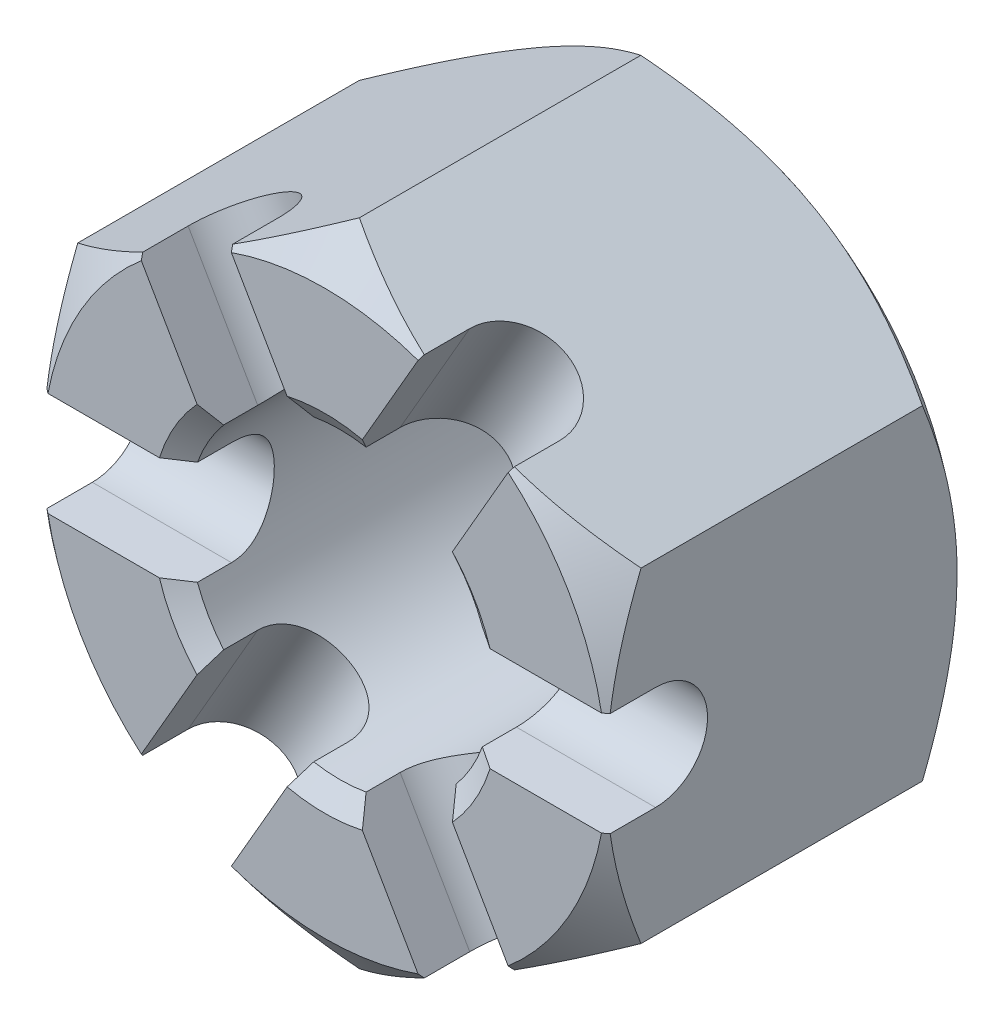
ISO-10303-21;
HEADER;
FILE_DESCRIPTION(('STEP AP214'),'2;1');
FILE_NAME('part.step','',(''),(''),'','','');
FILE_SCHEMA(('AUTOMOTIVE_DESIGN { 1 0 10303 214 1 1 1 1 }'));
ENDSEC;
DATA;
#1=APPLICATION_CONTEXT('core data for automotive mechanical design processes');
#2=APPLICATION_PROTOCOL_DEFINITION('international standard','automotive_design',2000,#1);
#3=PRODUCT_CONTEXT('',#1,'mechanical');
#4=PRODUCT('Part','Part','',(#3));
#5=PRODUCT_RELATED_PRODUCT_CATEGORY('part','',(#4));
#6=PRODUCT_DEFINITION_FORMATION('','',#4);
#7=PRODUCT_DEFINITION_CONTEXT('part definition',#1,'design');
#8=PRODUCT_DEFINITION('design','',#6,#7);
#9=PRODUCT_DEFINITION_SHAPE('','',#8);
#10=(LENGTH_UNIT() NAMED_UNIT(*) SI_UNIT(.MILLI.,.METRE.));
#11=(NAMED_UNIT(*) PLANE_ANGLE_UNIT() SI_UNIT($,.RADIAN.));
#12=(NAMED_UNIT(*) SI_UNIT($,.STERADIAN.) SOLID_ANGLE_UNIT());
#13=UNCERTAINTY_MEASURE_WITH_UNIT(LENGTH_MEASURE(1.E-05),#10,'distance_accuracy_value','');
#14=(GEOMETRIC_REPRESENTATION_CONTEXT(3) GLOBAL_UNCERTAINTY_ASSIGNED_CONTEXT((#13)) GLOBAL_UNIT_ASSIGNED_CONTEXT((#10,
#11,#12)) REPRESENTATION_CONTEXT('',''));
#15=CARTESIAN_POINT('',(0.,0.,0.));
#16=DIRECTION('',(0.,0.,1.));
#17=DIRECTION('',(1.,0.,0.));
#18=AXIS2_PLACEMENT_3D('',#15,#16,#17);
#19=CARTESIAN_POINT('',(0.,0.,-25.7048));
#20=DIRECTION('',(0.,0.,1.));
#21=DIRECTION('',(1.,0.,0.));
#22=AXIS2_PLACEMENT_3D('',#19,#20,#21);
#23=CYLINDRICAL_SURFACE('',#22,11.1125);
#24=CARTESIAN_POINT('',(0.,0.,-1.11157946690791));
#25=DIRECTION('',(0.,0.,1.));
#26=DIRECTION('',(1.,0.,0.));
#27=AXIS2_PLACEMENT_3D('',#24,#25,#26);
#28=CIRCLE('',#27,11.1125);
#29=CARTESIAN_POINT('',(10.4389442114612,-3.81,-1.11157946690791));
#30=VERTEX_POINT('',#29);
#31=CARTESIAN_POINT('',(8.51902889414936,-7.1353908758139,-1.11157946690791));
#32=VERTEX_POINT('',#31);
#33=EDGE_CURVE('E11',#30,#32,#28,.F.);
#34=ORIENTED_EDGE('',*,*,#33,.F.);
#35=DIRECTION('',(0.,0.,1.));
#36=VECTOR('',#35,1.);
#37=CARTESIAN_POINT('',(10.4389442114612,-3.81,-25.7048));
#38=LINE('',#37,#36);
#39=CARTESIAN_POINT('',(10.4389442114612,-3.81,-3.6068));
#40=VERTEX_POINT('',#39);
#41=EDGE_CURVE('E396',#30,#40,#38,.F.);
#42=ORIENTED_EDGE('',*,*,#41,.T.);
#43=CARTESIAN_POINT('',(10.4389442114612,-3.81,-3.6068));
#44=CARTESIAN_POINT('',(10.4389270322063,-3.81001390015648,-3.71055812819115));
#45=CARTESIAN_POINT('',(10.4404907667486,-3.80576182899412,-3.81430670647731));
#46=CARTESIAN_POINT('',(10.4466521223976,-3.78883407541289,-4.02099504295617));
#47=CARTESIAN_POINT('',(10.4512488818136,-3.77616078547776,-4.12393502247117));
#48=CARTESIAN_POINT('',(10.4633298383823,-3.74255067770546,-4.3279613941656));
#49=CARTESIAN_POINT('',(10.4708050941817,-3.72163944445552,-4.42905252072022));
#50=CARTESIAN_POINT('',(10.4883961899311,-3.67177022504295,-4.62896973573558));
#51=CARTESIAN_POINT('',(10.4985121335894,-3.64281192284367,-4.72779573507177));
#52=CARTESIAN_POINT('',(10.5323669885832,-3.54426041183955,-5.01973772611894));
#53=CARTESIAN_POINT('',(10.5596330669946,-3.46293794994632,-5.20863330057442));
#54=CARTESIAN_POINT('',(10.620467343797,-3.27159778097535,-5.57013550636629));
#55=CARTESIAN_POINT('',(10.6540396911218,-3.16156116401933,-5.74273130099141));
#56=CARTESIAN_POINT('',(10.7252512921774,-2.91104637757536,-6.07389958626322));
#57=CARTESIAN_POINT('',(10.7629956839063,-2.76958367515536,-6.23170626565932));
#58=CARTESIAN_POINT('',(10.8374132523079,-2.4623336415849,-6.52187940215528));
#59=CARTESIAN_POINT('',(10.8740862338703,-2.29654191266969,-6.65424124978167));
#60=CARTESIAN_POINT('',(10.9434601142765,-1.93964956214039,-6.89332394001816));
#61=CARTESIAN_POINT('',(10.9760222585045,-1.74797351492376,-6.99922973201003));
#62=CARTESIAN_POINT('',(11.0322530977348,-1.34822430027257,-7.17698178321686));
#63=CARTESIAN_POINT('',(11.0559246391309,-1.14015640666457,-7.24883894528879));
#64=CARTESIAN_POINT('',(11.0909600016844,-0.721613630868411,-7.35382575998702));
#65=CARTESIAN_POINT('',(11.1027429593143,-0.511506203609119,-7.38827779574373));
#66=CARTESIAN_POINT('',(11.1141650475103,-0.08818008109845,-7.42168820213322));
#67=CARTESIAN_POINT('',(11.1138072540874,0.125037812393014,-7.42065556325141));
#68=CARTESIAN_POINT('',(11.1012679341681,0.53913964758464,-7.38394855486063));
#69=CARTESIAN_POINT('',(11.0895773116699,0.740168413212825,-7.34971243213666));
#70=CARTESIAN_POINT('',(11.0563084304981,1.13342964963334,-7.24995758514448));
#71=CARTESIAN_POINT('',(11.0347296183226,1.32566162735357,-7.18443710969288));
#72=CARTESIAN_POINT('',(10.9834997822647,1.69893857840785,-7.02317472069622));
#73=CARTESIAN_POINT('',(10.9537435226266,1.87979706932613,-6.92703602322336));
#74=CARTESIAN_POINT('',(10.8892366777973,2.22323120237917,-6.70758874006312));
#75=CARTESIAN_POINT('',(10.8544846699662,2.38580161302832,-6.58427240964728));
#76=CARTESIAN_POINT('',(10.7816036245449,2.69655710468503,-6.30683878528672));
#77=CARTESIAN_POINT('',(10.7433925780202,2.84363039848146,-6.15149816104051));
#78=CARTESIAN_POINT('',(10.6693121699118,3.11008276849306,-5.8179087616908));
#79=CARTESIAN_POINT('',(10.6334435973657,3.22945254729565,-5.63965232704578));
#80=CARTESIAN_POINT('',(10.5842464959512,3.38591714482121,-5.35710383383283));
#81=CARTESIAN_POINT('',(10.5685009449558,3.43462316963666,-5.25949267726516));
#82=CARTESIAN_POINT('',(10.5391753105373,3.52358264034,-5.06019359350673));
#83=CARTESIAN_POINT('',(10.5255943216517,3.56383962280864,-4.95850739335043));
#84=CARTESIAN_POINT('',(10.5010600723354,3.6354957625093,-4.75188455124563));
#85=CARTESIAN_POINT('',(10.490103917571,3.66690468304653,-4.64695163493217));
#86=CARTESIAN_POINT('',(10.4711773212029,3.72060598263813,-4.43455793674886));
#87=CARTESIAN_POINT('',(10.4632055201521,3.74290251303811,-4.32709832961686));
#88=CARTESIAN_POINT('',(10.4509540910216,3.7769746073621,-4.11772176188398));
#89=CARTESIAN_POINT('',(10.4464630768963,3.7893544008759,-4.01591514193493));
#90=CARTESIAN_POINT('',(10.4404517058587,3.80586883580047,-3.81167503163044));
#91=CARTESIAN_POINT('',(10.4389277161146,3.81001356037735,-3.70924246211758));
#92=CARTESIAN_POINT('',(10.4389442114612,3.81,-3.6068));
#93=B_SPLINE_CURVE_WITH_KNOTS('',3,(#43,#44,#45,#46,#47,#48,#49,#50,#51,#52,#53,#54,#55,#56,#57,
#58,#59,#60,#61,#62,#63,#64,#65,#66,#67,#68,#69,#70,#71,#72,#73,#74,#75,#76,#77,#78,#79,#80,#81,
#82,#83,#84,#85,#86,#87,#88,#89,#90,#91,#92),.UNSPECIFIED.,.F.,.F.,(4,2,2,2,2,2,2,2,2,2,2,2,2,2,
2,2,2,2,2,2,2,2,2,2,4),(0.,0.311159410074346,0.622230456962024,0.932342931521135,
1.24246758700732,1.86176723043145,2.48147575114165,3.12435952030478,3.7673596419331,
4.42823392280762,5.08889643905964,5.72535475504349,6.36165181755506,6.9715638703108,
7.5815100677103,8.19970630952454,8.8180789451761,9.46708892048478,10.1163163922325,
10.4466244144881,10.7767939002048,11.1065976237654,11.4362509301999,11.7438431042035,
12.0510584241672),.UNSPECIFIED.);
#94=CARTESIAN_POINT('',(10.4389442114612,3.81,-3.6068));
#95=VERTEX_POINT('',#94);
#96=EDGE_CURVE('E387',#40,#95,#93,.T.);
#97=ORIENTED_EDGE('',*,*,#96,.T.);
#98=DIRECTION('',(0.,0.,1.));
#99=VECTOR('',#98,1.);
#100=CARTESIAN_POINT('',(10.4389442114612,3.81,-25.7048));
#101=LINE('',#100,#99);
#102=CARTESIAN_POINT('',(10.4389442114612,3.81,-1.11157946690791));
#103=VERTEX_POINT('',#102);
#104=EDGE_CURVE('E369',#95,#103,#101,.T.);
#105=ORIENTED_EDGE('',*,*,#104,.T.);
#106=CARTESIAN_POINT('',(8.51902889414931,7.13539087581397,-1.11157946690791));
#107=VERTEX_POINT('',#106);
#108=EDGE_CURVE('E51',#107,#103,#28,.F.);
#109=ORIENTED_EDGE('',*,*,#108,.F.);
#110=DIRECTION('',(0.,0.,1.));
#111=VECTOR('',#110,1.);
#112=CARTESIAN_POINT('',(8.51902889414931,7.13539087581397,-25.7048));
#113=LINE('',#112,#111);
#114=CARTESIAN_POINT('',(8.51902889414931,7.13539087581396,-3.6068));
#115=VERTEX_POINT('',#114);
#116=EDGE_CURVE('E486',#107,#115,#113,.F.);
#117=ORIENTED_EDGE('',*,*,#116,.T.);
#118=CARTESIAN_POINT('',(1.91991531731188,10.945390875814,-3.6068));
#119=CARTESIAN_POINT('',(1.91991243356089,10.9453904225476,-3.39965961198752));
#120=CARTESIAN_POINT('',(1.93771040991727,10.94231384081,-3.19253487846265));
#121=CARTESIAN_POINT('',(2.00789515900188,10.9296504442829,-2.78444586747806));
#122=CARTESIAN_POINT('',(2.06028600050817,10.9200628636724,-2.58348231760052));
#123=CARTESIAN_POINT('',(2.19680436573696,10.893414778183,-2.19369849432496));
#124=CARTESIAN_POINT('',(2.28086673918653,10.8763696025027,-2.00485421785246));
#125=CARTESIAN_POINT('',(2.47698704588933,10.8333851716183,-1.64342476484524));
#126=CARTESIAN_POINT('',(2.58905169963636,10.8074437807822,-1.47084350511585));
#127=CARTESIAN_POINT('',(2.84158811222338,10.7438623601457,-1.1396903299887));
#128=CARTESIAN_POINT('',(2.98296994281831,10.705818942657,-0.981889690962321));
#129=CARTESIAN_POINT('',(3.28626422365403,10.6166417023,-0.69172176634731));
#130=CARTESIAN_POINT('',(3.44818018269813,10.5655056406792,-0.559358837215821));
#131=CARTESIAN_POINT('',(3.79194143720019,10.4471402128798,-0.320277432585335));
#132=CARTESIAN_POINT('',(3.97421547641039,10.3795031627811,-0.214373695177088));
#133=CARTESIAN_POINT('',(4.34852346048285,10.2283264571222,-0.0366208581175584));
#134=CARTESIAN_POINT('',(4.54055459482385,10.1447913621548,0.0352379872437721));
#135=CARTESIAN_POINT('',(4.92054606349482,9.96585908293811,0.140226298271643));
#136=CARTESIAN_POINT('',(5.10839771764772,9.87100873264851,0.17467845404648));
#137=CARTESIAN_POINT('',(5.48071986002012,9.66923727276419,0.208088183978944));
#138=CARTESIAN_POINT('',(5.66519125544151,9.56231945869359,0.20705542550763));
#139=CARTESIAN_POINT('',(6.01754151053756,9.34441088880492,0.170348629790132));
#140=CARTESIAN_POINT('',(6.18579120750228,9.23377282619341,0.136112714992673));
#141=CARTESIAN_POINT('',(6.50973104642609,9.00833066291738,0.0363585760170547));
#142=CARTESIAN_POINT('',(6.66542032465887,8.89352627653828,-0.0291617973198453));
#143=CARTESIAN_POINT('',(6.96307375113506,8.66252058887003,-0.190425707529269));
#144=CARTESIAN_POINT('',(7.10482392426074,8.54632138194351,-0.28656581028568));
#145=CARTESIAN_POINT('',(7.36999182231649,8.31874114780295,-0.506008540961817));
#146=CARTESIAN_POINT('',(7.49340423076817,8.20736152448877,-0.629319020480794));
#147=CARTESIAN_POINT('',(7.72610123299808,7.98885223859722,-0.906781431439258));
#148=CARTESIAN_POINT('',(7.83438073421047,7.88220781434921,-1.06216025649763));
#149=CARTESIAN_POINT('',(8.02806996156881,7.6848498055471,-1.39568701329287));
#150=CARTESIAN_POINT('',(8.11347572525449,7.59413898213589,-1.57383888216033));
#151=CARTESIAN_POINT('',(8.26172154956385,7.43262193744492,-1.95156798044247));
#152=CARTESIAN_POINT('',(8.32418245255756,7.3621540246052,-2.15144006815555));
#153=CARTESIAN_POINT('',(8.42378414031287,7.2479876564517,-2.56467117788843));
#154=CARTESIAN_POINT('',(8.46093627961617,7.20427719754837,-2.77802410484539));
#155=CARTESIAN_POINT('',(8.50820983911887,7.14837786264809,-3.2013268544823));
#156=CARTESIAN_POINT('',(8.51952921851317,7.13479286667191,-3.41095850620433));
#157=CARTESIAN_POINT('',(8.51849486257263,7.13602912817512,-3.83005561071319));
#158=CARTESIAN_POINT('',(8.50614575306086,7.15084483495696,-4.03952108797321));
#159=CARTESIAN_POINT('',(8.45889258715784,7.20666556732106,-4.44423384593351));
#160=CARTESIAN_POINT('',(8.42484170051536,7.24667929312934,-4.63972034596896));
#161=CARTESIAN_POINT('',(8.33546335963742,7.34930643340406,-5.01956436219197));
#162=CARTESIAN_POINT('',(8.28013199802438,7.41192399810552,-5.20391982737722));
#163=CARTESIAN_POINT('',(8.14661253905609,7.5584700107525,-5.56303276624));
#164=CARTESIAN_POINT('',(8.06772882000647,7.64303496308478,-5.73727092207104));
#165=CARTESIAN_POINT('',(7.88861937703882,7.82776259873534,-6.06534071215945));
#166=CARTESIAN_POINT('',(7.78838701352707,7.92793013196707,-6.21916597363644));
#167=CARTESIAN_POINT('',(7.56179320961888,8.14448875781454,-6.51021775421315));
#168=CARTESIAN_POINT('',(7.43435399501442,8.26144893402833,-6.64618562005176));
#169=CARTESIAN_POINT('',(7.15844290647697,8.50163263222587,-6.88795464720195));
#170=CARTESIAN_POINT('',(7.00997164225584,8.62485597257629,-6.99375668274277));
#171=CARTESIAN_POINT('',(6.69547386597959,8.87118330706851,-7.1712630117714));
#172=CARTESIAN_POINT('',(6.52956049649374,8.99428340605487,-7.24317226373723));
#173=CARTESIAN_POINT('',(6.18327660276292,9.23575767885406,-7.35113350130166));
#174=CARTESIAN_POINT('',(6.00291166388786,9.35413365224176,-7.38719926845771));
#175=CARTESIAN_POINT('',(5.64209346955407,9.57585822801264,-7.42115354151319));
#176=CARTESIAN_POINT('',(5.46208695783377,9.67966071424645,-7.42084428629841));
#177=CARTESIAN_POINT('',(5.09904773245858,9.8757236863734,-7.38654471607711));
#178=CARTESIAN_POINT('',(4.91601529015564,9.9679852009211,-7.35255740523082));
#179=CARTESIAN_POINT('',(4.55585131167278,10.1375955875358,-7.25308109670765));
#180=CARTESIAN_POINT('',(4.37867262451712,10.2151785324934,-7.18815758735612));
#181=CARTESIAN_POINT('',(4.03217793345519,10.3568465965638,-7.02918299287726));
#182=CARTESIAN_POINT('',(3.8628633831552,10.4209292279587,-6.93512654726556));
#183=CARTESIAN_POINT('',(3.53083026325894,10.5381729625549,-6.71642514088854));
#184=CARTESIAN_POINT('',(3.36861156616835,10.5908226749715,-6.5907479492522));
#185=CARTESIAN_POINT('',(3.06311904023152,10.683186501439,-6.31409893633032));
#186=CARTESIAN_POINT('',(2.91985145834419,10.7228963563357,-6.16311881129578));
#187=CARTESIAN_POINT('',(2.65161153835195,10.7924344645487,-5.83256175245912));
#188=CARTESIAN_POINT('',(2.52766282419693,10.8217765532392,-5.65204877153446));
#189=CARTESIAN_POINT('',(2.3109010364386,10.8701326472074,-5.27193095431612));
#190=CARTESIAN_POINT('',(2.2180821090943,10.8891485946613,-5.0723297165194));
#191=CARTESIAN_POINT('',(2.07012479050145,10.9182333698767,-4.66484051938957));
#192=CARTESIAN_POINT('',(2.01407136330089,10.9285215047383,-4.4573018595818));
#193=CARTESIAN_POINT('',(1.93897554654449,10.9420990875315,-4.03543470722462));
#194=CARTESIAN_POINT('',(1.91991830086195,10.9453913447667,-3.82110897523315));
#195=CARTESIAN_POINT('',(1.91991531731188,10.945390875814,-3.6068));
#196=B_SPLINE_CURVE_WITH_KNOTS('',3,(#118,#119,#120,#121,#122,#123,#124,#125,#126,#127,#128,
#129,#130,#131,#132,#133,#134,#135,#136,#137,#138,#139,#140,#141,#142,#143,#144,#145,#146,#147,
#148,#149,#150,#151,#152,#153,#154,#155,#156,#157,#158,#159,#160,#161,#162,#163,#164,#165,#166,
#167,#168,#169,#170,#171,#172,#173,#174,#175,#176,#177,#178,#179,#180,#181,#182,#183,#184,#185,
#186,#187,#188,#189,#190,#191,#192,#193,#194,#195),.UNSPECIFIED.,.T.,.F.,(4,2,2,2,2,2,2,2,2,2,2,
2,2,2,2,2,2,2,2,2,2,2,2,2,2,2,2,2,2,2,2,2,2,2,2,2,2,2,4),(0.,0.620626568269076,1.2413261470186,
1.8607558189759,2.48033429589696,3.12322123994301,3.76621818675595,4.42708123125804,
5.08775498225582,5.7242193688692,6.36051036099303,6.9704185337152,7.58036861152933,
8.19856361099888,8.81693748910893,9.46600003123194,10.1151749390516,10.7746401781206,
11.4338093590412,12.0617290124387,12.6895259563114,13.294048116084,13.8986813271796,
14.5233179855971,15.1481491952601,15.8050789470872,16.4619896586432,17.1148752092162,
17.7675096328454,18.3878229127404,19.008080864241,19.6174122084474,20.2268557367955,
20.8596060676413,21.4925644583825,22.1521592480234,22.8116299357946,23.4539927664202,
24.0960975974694),.UNSPECIFIED.);
#197=CARTESIAN_POINT('',(1.91991531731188,10.9453908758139,-3.6068));
#198=VERTEX_POINT('',#197);
#199=EDGE_CURVE('E480',#115,#198,#196,.T.);
#200=ORIENTED_EDGE('',*,*,#199,.T.);
#201=DIRECTION('',(0.,0.,1.));
#202=VECTOR('',#201,1.);
#203=CARTESIAN_POINT('',(1.91991531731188,10.9453908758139,-25.7048));
#204=LINE('',#203,#202);
#205=CARTESIAN_POINT('',(1.91991531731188,10.9453908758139,-1.11157946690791));
#206=VERTEX_POINT('',#205);
#207=EDGE_CURVE('E487',#198,#206,#204,.T.);
#208=ORIENTED_EDGE('',*,*,#207,.T.);
#209=CARTESIAN_POINT('',(-1.91991531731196,10.9453908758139,-1.11157946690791));
#210=VERTEX_POINT('',#209);
#211=EDGE_CURVE('E753',#210,#206,#28,.F.);
#212=ORIENTED_EDGE('',*,*,#211,.F.);
#213=DIRECTION('',(0.,0.,1.));
#214=VECTOR('',#213,1.);
#215=CARTESIAN_POINT('',(-1.91991531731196,10.9453908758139,-25.7048));
#216=LINE('',#215,#214);
#217=CARTESIAN_POINT('',(-1.91991531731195,10.9453908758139,-3.6068));
#218=VERTEX_POINT('',#217);
#219=EDGE_CURVE('E452',#210,#218,#216,.F.);
#220=ORIENTED_EDGE('',*,*,#219,.T.);
#221=CARTESIAN_POINT('',(-8.51902889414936,7.1353908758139,-3.6068));
#222=CARTESIAN_POINT('',(-8.51902994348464,7.1353881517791,-3.39965961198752));
#223=CARTESIAN_POINT('',(-8.50746655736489,7.14926336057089,-3.19253487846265));
#224=CARTESIAN_POINT('',(-8.46140735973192,7.20371343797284,-2.78444586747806));
#225=CARTESIAN_POINT('',(-8.42690885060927,7.2442914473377,-2.58348231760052));
#226=CARTESIAN_POINT('',(-8.33557174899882,7.34919577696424,-2.19369849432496));
#227=CARTESIAN_POINT('',(-8.27877900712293,7.41347334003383,-2.00485421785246));
#228=CARTESIAN_POINT('',(-8.14349324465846,7.56182629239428,-1.64342476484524));
#229=CARTESIAN_POINT('',(-8.06499501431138,7.64590643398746,-1.47084350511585));
#230=CARTESIAN_POINT('',(-7.88366368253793,7.83281867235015,-1.1396903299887));
#231=CARTESIAN_POINT('',(-7.78002620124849,7.93623722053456,-0.98188969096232));
#232=CARTESIAN_POINT('',(-7.55114930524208,8.15430915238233,-0.691721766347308));
#233=CARTESIAN_POINT('',(-7.42590619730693,8.26896445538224,-0.559358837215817));
#234=CARTESIAN_POINT('',(-7.15151810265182,8.50748772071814,-0.320277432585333));
#235=CARTESIAN_POINT('',(-7.00180567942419,8.63152314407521,-0.214373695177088));
#236=CARTESIAN_POINT('',(-6.68372881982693,8.88009501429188,-0.0366208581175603));
#237=CARTESIAN_POINT('',(-6.51536973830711,9.00463130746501,0.0352379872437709));
#238=CARTESIAN_POINT('',(-6.1704141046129,9.24424743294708,0.140226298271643));
#239=CARTESIAN_POINT('',(-5.99434546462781,9.35950656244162,0.17467845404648));
#240=CARTESIAN_POINT('',(-5.63344518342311,9.5810612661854,0.208088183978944));
#241=CARTESIAN_POINT('',(-5.44861594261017,9.6873592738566,0.20705542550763));
#242=CARTESIAN_POINT('',(-5.08372645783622,9.88354926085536,0.170348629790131));
#243=CARTESIAN_POINT('',(-4.9037862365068,9.97393874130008,0.136112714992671));
#244=CARTESIAN_POINT('',(-4.54657767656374,10.1417577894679,0.0363585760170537));
#245=CARTESIAN_POINT('',(-4.36930952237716,10.2191864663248,-0.0291617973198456));
#246=CARTESIAN_POINT('',(-4.02042601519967,10.3614590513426,-0.190425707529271));
#247=CARTESIAN_POINT('',(-3.84891946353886,10.426118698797,-0.286565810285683));
#248=CARTESIAN_POINT('',(-3.51924525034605,10.5419707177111,-0.50600854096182));
#249=CARTESIAN_POINT('',(-3.36108146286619,10.5931591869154,-0.629319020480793));
#250=CARTESIAN_POINT('',(-3.05549836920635,10.6854260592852,-0.906781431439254));
#251=CARTESIAN_POINT('',(-2.90900183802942,10.7258766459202,-1.06216025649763));
#252=CARTESIAN_POINT('',(-2.64124017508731,10.7949374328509,-1.39568701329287));
#253=CARTESIAN_POINT('',(-2.51997941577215,10.8235455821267,-1.57383888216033));
#254=CARTESIAN_POINT('',(-2.30597863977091,10.8711717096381,-1.95156798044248));
#255=CARTESIAN_POINT('',(-2.2137211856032,10.8900304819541,-2.15144006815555));
#256=CARTESIAN_POINT('',(-2.0650493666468,10.9192048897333,-2.56467117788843));
#257=CARTESIAN_POINT('',(-2.00861892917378,10.9295243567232,-2.77802410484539));
#258=CARTESIAN_POINT('',(-1.93657190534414,10.9425147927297,-3.2013268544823));
#259=CARTESIAN_POINT('',(-1.91914726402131,10.9455251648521,-3.41095850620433));
#260=CARTESIAN_POINT('',(-1.92073507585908,10.9452475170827,-3.83005561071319));
#261=CARTESIAN_POINT('',(-1.93974040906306,10.9419607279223,-4.03952108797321));
#262=CARTESIAN_POINT('',(-2.01170916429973,10.9289486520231,-4.44423384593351));
#263=CARTESIAN_POINT('',(-2.06338751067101,10.9194665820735,-4.63972034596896));
#264=CARTESIAN_POINT('',(-2.19695439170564,10.8933762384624,-5.01956436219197));
#265=CARTESIAN_POINT('',(-2.27884847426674,10.8767666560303,-5.20391982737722));
#266=CARTESIAN_POINT('',(-2.47252077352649,10.8344084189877,-5.56303276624));
#267=CARTESIAN_POINT('',(-2.58519803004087,10.8083755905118,-5.73727092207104));
#268=CARTESIAN_POINT('',(-2.83473157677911,10.7456260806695,-6.06534071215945));
#269=CARTESIAN_POINT('',(-2.97159538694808,10.7089060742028,-6.21916597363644));
#270=CARTESIAN_POINT('',(-3.27243756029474,10.6209493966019,-6.51021775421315));
#271=CARTESIAN_POINT('',(-3.43744765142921,10.569063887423,-6.64618562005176));
#272=CARTESIAN_POINT('',(-3.78340837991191,10.4502097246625,-6.88795464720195));
#273=CARTESIAN_POINT('',(-3.96435855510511,10.3832415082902,-6.99375668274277));
#274=CARTESIAN_POINT('',(-4.33493317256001,10.2340421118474,-7.1712630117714));
#275=CARTESIAN_POINT('',(-4.5244976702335,10.1519069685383,-7.24317226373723));
#276=CARTESIAN_POINT('',(-4.90676247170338,9.97275345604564,-7.35113350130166));
#277=CARTESIAN_POINT('',(-5.09946154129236,9.87574082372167,-7.38719926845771));
#278=CARTESIAN_POINT('',(-5.47188975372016,9.67412538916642,-7.42115354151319));
#279=CARTESIAN_POINT('',(-5.65178859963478,9.57013642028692,-7.42084428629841));
#280=CARTESIAN_POINT('',(-6.0031037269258,9.35376671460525,-7.38654471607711));
#281=CARTESIAN_POINT('',(-6.1745207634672,9.24138672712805,-7.35255740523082));
#282=CARTESIAN_POINT('',(-6.50148965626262,9.01428076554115,-7.25308109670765));
#283=CARTESIAN_POINT('',(-6.65726780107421,8.899630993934,-7.18815758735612));
#284=CARTESIAN_POINT('',(-6.95320328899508,8.67039182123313,-7.02918299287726));
#285=CARTESIAN_POINT('',(-7.09335775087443,8.55580243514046,-6.93512654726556));
#286=CARTESIAN_POINT('',(-7.36091036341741,8.32687518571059,-6.71642514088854));
#287=CARTESIAN_POINT('',(-7.48761570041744,8.21271452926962,-6.5907479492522));
#288=CARTESIAN_POINT('',(-7.72035138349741,7.99433215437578,-6.31409893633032));
#289=CARTESIAN_POINT('',(-7.82637491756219,7.89011371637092,-6.16311881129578));
#290=CARTESIAN_POINT('',(-8.02071664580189,7.69258018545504,-5.83256175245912));
#291=CARTESIAN_POINT('',(-8.1081019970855,7.59990849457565,-5.65204877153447));
#292=CARTESIAN_POINT('',(-8.25836049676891,7.4363653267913,-5.27193095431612));
#293=CARTESIAN_POINT('',(-8.32123825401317,7.36548975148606,-5.0723297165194));
#294=CARTESIAN_POINT('',(-8.42040506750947,7.25189734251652,-4.66484051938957));
#295=CARTESIAN_POINT('',(-8.45734156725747,7.20849771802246,-4.4573018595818));
#296=CARTESIAN_POINT('',(-8.5066480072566,7.15025162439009,-4.03543470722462));
#297=CARTESIAN_POINT('',(-8.51902780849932,7.13539369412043,-3.82110897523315));
#298=CARTESIAN_POINT('',(-8.51902889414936,7.1353908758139,-3.6068));
#299=B_SPLINE_CURVE_WITH_KNOTS('',3,(#221,#222,#223,#224,#225,#226,#227,#228,#229,#230,#231,
#232,#233,#234,#235,#236,#237,#238,#239,#240,#241,#242,#243,#244,#245,#246,#247,#248,#249,#250,
#251,#252,#253,#254,#255,#256,#257,#258,#259,#260,#261,#262,#263,#264,#265,#266,#267,#268,#269,
#270,#271,#272,#273,#274,#275,#276,#277,#278,#279,#280,#281,#282,#283,#284,#285,#286,#287,#288,
#289,#290,#291,#292,#293,#294,#295,#296,#297,#298),.UNSPECIFIED.,.T.,.F.,(4,2,2,2,2,2,2,2,2,2,2,
2,2,2,2,2,2,2,2,2,2,2,2,2,2,2,2,2,2,2,2,2,2,2,2,2,2,2,4),(0.,0.620626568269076,1.2413261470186,
1.8607558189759,2.48033429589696,3.12322123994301,3.76621818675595,4.42708123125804,
5.08775498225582,5.7242193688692,6.36051036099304,6.9704185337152,7.58036861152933,
8.19856361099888,8.81693748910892,9.46600003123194,10.1151749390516,10.7746401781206,
11.4338093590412,12.0617290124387,12.6895259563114,13.294048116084,13.8986813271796,
14.5233179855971,15.1481491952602,15.8050789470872,16.4619896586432,17.1148752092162,
17.7675096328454,18.3878229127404,19.008080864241,19.6174122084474,20.2268557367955,
20.8596060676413,21.4925644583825,22.1521592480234,22.8116299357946,23.4539927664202,
24.0960975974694),.UNSPECIFIED.);
#300=CARTESIAN_POINT('',(-8.51902889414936,7.1353908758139,-3.6068));
#301=VERTEX_POINT('',#300);
#302=EDGE_CURVE('E446',#218,#301,#299,.T.);
#303=ORIENTED_EDGE('',*,*,#302,.T.);
#304=DIRECTION('',(0.,0.,1.));
#305=VECTOR('',#304,1.);
#306=CARTESIAN_POINT('',(-8.51902889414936,7.13539087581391,-25.7048));
#307=LINE('',#306,#305);
#308=CARTESIAN_POINT('',(-8.51902889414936,7.13539087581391,-1.11157946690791));
#309=VERTEX_POINT('',#308);
#310=EDGE_CURVE('E455',#301,#309,#307,.T.);
#311=ORIENTED_EDGE('',*,*,#310,.T.);
#312=CARTESIAN_POINT('',(-10.4389442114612,3.80999999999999,-1.11157946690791));
#313=VERTEX_POINT('',#312);
#314=EDGE_CURVE('E746',#313,#309,#28,.F.);
#315=ORIENTED_EDGE('',*,*,#314,.F.);
#316=DIRECTION('',(0.,0.,1.));
#317=VECTOR('',#316,1.);
#318=CARTESIAN_POINT('',(-10.4389442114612,3.80999999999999,-25.7048));
#319=LINE('',#318,#317);
#320=CARTESIAN_POINT('',(-10.4389442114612,3.80999999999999,-3.60679999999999));
#321=VERTEX_POINT('',#320);
#322=EDGE_CURVE('E419',#313,#321,#319,.F.);
#323=ORIENTED_EDGE('',*,*,#322,.T.);
#324=CARTESIAN_POINT('',(-10.4389442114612,3.81,-3.6068));
#325=CARTESIAN_POINT('',(-10.4389270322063,3.81001390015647,-3.71055812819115));
#326=CARTESIAN_POINT('',(-10.4404907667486,3.80576182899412,-3.81430670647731));
#327=CARTESIAN_POINT('',(-10.4466521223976,3.78883407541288,-4.02099504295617));
#328=CARTESIAN_POINT('',(-10.4512488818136,3.77616078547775,-4.12393502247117));
#329=CARTESIAN_POINT('',(-10.4633298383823,3.74255067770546,-4.3279613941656));
#330=CARTESIAN_POINT('',(-10.4708050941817,3.72163944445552,-4.42905252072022));
#331=CARTESIAN_POINT('',(-10.4883961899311,3.67177022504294,-4.62896973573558));
#332=CARTESIAN_POINT('',(-10.4985121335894,3.64281192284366,-4.72779573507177));
#333=CARTESIAN_POINT('',(-10.5323669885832,3.54426041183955,-5.01973772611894));
#334=CARTESIAN_POINT('',(-10.5596330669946,3.46293794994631,-5.20863330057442));
#335=CARTESIAN_POINT('',(-10.620467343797,3.27159778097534,-5.57013550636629));
#336=CARTESIAN_POINT('',(-10.6540396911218,3.16156116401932,-5.74273130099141));
#337=CARTESIAN_POINT('',(-10.7252512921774,2.91104637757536,-6.07389958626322));
#338=CARTESIAN_POINT('',(-10.7629956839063,2.76958367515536,-6.23170626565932));
#339=CARTESIAN_POINT('',(-10.8374132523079,2.4623336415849,-6.52187940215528));
#340=CARTESIAN_POINT('',(-10.8740862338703,2.29654191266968,-6.65424124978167));
#341=CARTESIAN_POINT('',(-10.9434601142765,1.93964956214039,-6.89332394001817));
#342=CARTESIAN_POINT('',(-10.9760222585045,1.74797351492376,-6.99922973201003));
#343=CARTESIAN_POINT('',(-11.0322530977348,1.34822430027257,-7.17698178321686));
#344=CARTESIAN_POINT('',(-11.0559246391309,1.14015640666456,-7.24883894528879));
#345=CARTESIAN_POINT('',(-11.0909600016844,0.721613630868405,-7.35382575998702));
#346=CARTESIAN_POINT('',(-11.1027429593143,0.511506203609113,-7.38827779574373));
#347=CARTESIAN_POINT('',(-11.1141650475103,0.0881800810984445,-7.42168820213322));
#348=CARTESIAN_POINT('',(-11.1138072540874,-0.125037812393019,-7.42065556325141));
#349=CARTESIAN_POINT('',(-11.1012679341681,-0.539139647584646,-7.38394855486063));
#350=CARTESIAN_POINT('',(-11.0895773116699,-0.74016841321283,-7.34971243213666));
#351=CARTESIAN_POINT('',(-11.0563084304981,-1.13342964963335,-7.24995758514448));
#352=CARTESIAN_POINT('',(-11.0347296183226,-1.32566162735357,-7.18443710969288));
#353=CARTESIAN_POINT('',(-10.9834997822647,-1.69893857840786,-7.02317472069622));
#354=CARTESIAN_POINT('',(-10.9537435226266,-1.87979706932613,-6.92703602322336));
#355=CARTESIAN_POINT('',(-10.8892366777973,-2.22323120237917,-6.70758874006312));
#356=CARTESIAN_POINT('',(-10.8544846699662,-2.38580161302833,-6.58427240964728));
#357=CARTESIAN_POINT('',(-10.7816036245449,-2.69655710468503,-6.30683878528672));
#358=CARTESIAN_POINT('',(-10.7433925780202,-2.84363039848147,-6.15149816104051));
#359=CARTESIAN_POINT('',(-10.6693121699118,-3.11008276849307,-5.8179087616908));
#360=CARTESIAN_POINT('',(-10.6334435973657,-3.22945254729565,-5.63965232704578));
#361=CARTESIAN_POINT('',(-10.5842464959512,-3.38591714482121,-5.35710383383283));
#362=CARTESIAN_POINT('',(-10.5685009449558,-3.43462316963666,-5.25949267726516));
#363=CARTESIAN_POINT('',(-10.5391753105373,-3.52358264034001,-5.06019359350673));
#364=CARTESIAN_POINT('',(-10.5255943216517,-3.56383962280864,-4.95850739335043));
#365=CARTESIAN_POINT('',(-10.5010600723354,-3.6354957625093,-4.75188455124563));
#366=CARTESIAN_POINT('',(-10.490103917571,-3.66690468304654,-4.64695163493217));
#367=CARTESIAN_POINT('',(-10.4711773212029,-3.72060598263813,-4.43455793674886));
#368=CARTESIAN_POINT('',(-10.4632055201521,-3.74290251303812,-4.32709832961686));
#369=CARTESIAN_POINT('',(-10.4509540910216,-3.7769746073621,-4.11772176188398));
#370=CARTESIAN_POINT('',(-10.4464630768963,-3.7893544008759,-4.01591514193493));
#371=CARTESIAN_POINT('',(-10.4404517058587,-3.80586883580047,-3.81167503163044));
#372=CARTESIAN_POINT('',(-10.4389277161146,-3.81001356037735,-3.70924246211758));
#373=CARTESIAN_POINT('',(-10.4389442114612,-3.81,-3.6068));
#374=B_SPLINE_CURVE_WITH_KNOTS('',3,(#324,#325,#326,#327,#328,#329,#330,#331,#332,#333,#334,
#335,#336,#337,#338,#339,#340,#341,#342,#343,#344,#345,#346,#347,#348,#349,#350,#351,#352,#353,
#354,#355,#356,#357,#358,#359,#360,#361,#362,#363,#364,#365,#366,#367,#368,#369,#370,#371,#372,
#373),.UNSPECIFIED.,.F.,.F.,(4,2,2,2,2,2,2,2,2,2,2,2,2,2,2,2,2,2,2,2,2,2,2,2,4),(0.,
0.311159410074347,0.622230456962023,0.932342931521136,1.24246758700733,1.86176723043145,
2.48147575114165,3.12435952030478,3.7673596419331,4.42823392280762,5.08889643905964,
5.72535475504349,6.36165181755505,6.9715638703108,7.5815100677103,8.19970630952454,
8.8180789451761,9.46708892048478,10.1163163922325,10.4466244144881,10.7767939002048,
11.1065976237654,11.4362509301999,11.7438431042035,12.0510584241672),.UNSPECIFIED.);
#375=CARTESIAN_POINT('',(-10.4389442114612,-3.81,-3.6068));
#376=VERTEX_POINT('',#375);
#377=EDGE_CURVE('E411',#321,#376,#374,.T.);
#378=ORIENTED_EDGE('',*,*,#377,.T.);
#379=DIRECTION('',(0.,0.,1.));
#380=VECTOR('',#379,1.);
#381=CARTESIAN_POINT('',(-10.4389442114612,-3.81,-25.7048));
#382=LINE('',#381,#380);
#383=CARTESIAN_POINT('',(-10.4389442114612,-3.81,-1.11157946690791));
#384=VERTEX_POINT('',#383);
#385=EDGE_CURVE('E418',#376,#384,#382,.T.);
#386=ORIENTED_EDGE('',*,*,#385,.T.);
#387=CARTESIAN_POINT('',(-8.51902889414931,-7.13539087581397,-1.11157946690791));
#388=VERTEX_POINT('',#387);
#389=EDGE_CURVE('E752',#388,#384,#28,.F.);
#390=ORIENTED_EDGE('',*,*,#389,.F.);
#391=DIRECTION('',(0.,0.,1.));
#392=VECTOR('',#391,1.);
#393=CARTESIAN_POINT('',(-8.51902889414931,-7.13539087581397,-25.7048));
#394=LINE('',#393,#392);
#395=CARTESIAN_POINT('',(-8.51902889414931,-7.13539087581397,-3.60679999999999));
#396=VERTEX_POINT('',#395);
#397=EDGE_CURVE('E458',#388,#396,#394,.F.);
#398=ORIENTED_EDGE('',*,*,#397,.T.);
#399=CARTESIAN_POINT('',(-8.51902889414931,-7.13539087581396,-3.6068));
#400=CARTESIAN_POINT('',(-8.5190299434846,-7.13538815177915,-3.81394038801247));
#401=CARTESIAN_POINT('',(-8.50746655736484,-7.14926336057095,-4.02106512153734));
#402=CARTESIAN_POINT('',(-8.46140735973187,-7.2037134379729,-4.42915413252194));
#403=CARTESIAN_POINT('',(-8.42690885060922,-7.24429144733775,-4.63011768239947));
#404=CARTESIAN_POINT('',(-8.33557174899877,-7.34919577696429,-5.01990150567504));
#405=CARTESIAN_POINT('',(-8.27877900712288,-7.41347334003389,-5.20874578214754));
#406=CARTESIAN_POINT('',(-8.14349324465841,-7.56182629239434,-5.57017523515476));
#407=CARTESIAN_POINT('',(-8.06499501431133,-7.64590643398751,-5.74275649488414));
#408=CARTESIAN_POINT('',(-7.88366368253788,-7.8328186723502,-6.07390967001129));
#409=CARTESIAN_POINT('',(-7.78002620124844,-7.93623722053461,-6.23171030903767));
#410=CARTESIAN_POINT('',(-7.55114930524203,-8.15430915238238,-6.52187823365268));
#411=CARTESIAN_POINT('',(-7.42590619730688,-8.26896445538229,-6.65424116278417));
#412=CARTESIAN_POINT('',(-7.15151810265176,-8.50748772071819,-6.89332256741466));
#413=CARTESIAN_POINT('',(-7.00180567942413,-8.63152314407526,-6.9992263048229));
#414=CARTESIAN_POINT('',(-6.68372881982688,-8.88009501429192,-7.17697914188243));
#415=CARTESIAN_POINT('',(-6.51536973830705,-9.00463130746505,-7.24883798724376));
#416=CARTESIAN_POINT('',(-6.17041410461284,-9.24424743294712,-7.35382629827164));
#417=CARTESIAN_POINT('',(-5.99434546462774,-9.35950656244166,-7.38827845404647));
#418=CARTESIAN_POINT('',(-5.63344518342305,-9.58106126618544,-7.42168818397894));
#419=CARTESIAN_POINT('',(-5.44861594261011,-9.68735927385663,-7.42065542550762));
#420=CARTESIAN_POINT('',(-5.08372645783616,-9.88354926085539,-7.38394862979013));
#421=CARTESIAN_POINT('',(-4.90378623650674,-9.97393874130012,-7.34971271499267));
#422=CARTESIAN_POINT('',(-4.54657767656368,-10.141757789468,-7.24995857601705));
#423=CARTESIAN_POINT('',(-4.3693095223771,-10.2191864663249,-7.18443820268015));
#424=CARTESIAN_POINT('',(-4.0204260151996,-10.3614590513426,-7.02317429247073));
#425=CARTESIAN_POINT('',(-3.84891946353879,-10.426118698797,-6.92703418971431));
#426=CARTESIAN_POINT('',(-3.51924525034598,-10.5419707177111,-6.70759145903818));
#427=CARTESIAN_POINT('',(-3.36108146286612,-10.5931591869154,-6.5842809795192));
#428=CARTESIAN_POINT('',(-3.05549836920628,-10.6854260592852,-6.30681856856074));
#429=CARTESIAN_POINT('',(-2.90900183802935,-10.7258766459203,-6.15143974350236));
#430=CARTESIAN_POINT('',(-2.64124017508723,-10.7949374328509,-5.81791298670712));
#431=CARTESIAN_POINT('',(-2.51997941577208,-10.8235455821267,-5.63976111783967));
#432=CARTESIAN_POINT('',(-2.30597863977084,-10.8711717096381,-5.26203201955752));
#433=CARTESIAN_POINT('',(-2.21372118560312,-10.8900304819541,-5.06215993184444));
#434=CARTESIAN_POINT('',(-2.06504936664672,-10.9192048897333,-4.64892882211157));
#435=CARTESIAN_POINT('',(-2.00861892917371,-10.9295243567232,-4.43557589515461));
#436=CARTESIAN_POINT('',(-1.93657190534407,-10.9425147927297,-4.01227314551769));
#437=CARTESIAN_POINT('',(-1.91914726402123,-10.9455251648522,-3.80264149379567));
#438=CARTESIAN_POINT('',(-1.92073507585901,-10.9452475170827,-3.3835443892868));
#439=CARTESIAN_POINT('',(-1.93974040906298,-10.9419607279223,-3.17407891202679));
#440=CARTESIAN_POINT('',(-2.01170916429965,-10.9289486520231,-2.76936615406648));
#441=CARTESIAN_POINT('',(-2.06338751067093,-10.9194665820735,-2.57387965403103));
#442=CARTESIAN_POINT('',(-2.19695439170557,-10.8933762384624,-2.19403563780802));
#443=CARTESIAN_POINT('',(-2.27884847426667,-10.8767666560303,-2.00968017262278));
#444=CARTESIAN_POINT('',(-2.47252077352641,-10.8344084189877,-1.65056723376));
#445=CARTESIAN_POINT('',(-2.5851980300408,-10.8083755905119,-1.47632907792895));
#446=CARTESIAN_POINT('',(-2.83473157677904,-10.7456260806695,-1.14825928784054));
#447=CARTESIAN_POINT('',(-2.97159538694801,-10.7089060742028,-0.994434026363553));
#448=CARTESIAN_POINT('',(-3.27243756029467,-10.6209493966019,-0.703382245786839));
#449=CARTESIAN_POINT('',(-3.43744765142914,-10.569063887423,-0.567414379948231));
#450=CARTESIAN_POINT('',(-3.78340837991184,-10.4502097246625,-0.32564535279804));
#451=CARTESIAN_POINT('',(-3.96435855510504,-10.3832415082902,-0.219843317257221));
#452=CARTESIAN_POINT('',(-4.33493317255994,-10.2340421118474,-0.0423369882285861));
#453=CARTESIAN_POINT('',(-4.52449767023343,-10.1519069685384,0.0295722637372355));
#454=CARTESIAN_POINT('',(-4.90676247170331,-9.97275345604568,0.137533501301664));
#455=CARTESIAN_POINT('',(-5.0994615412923,-9.8757408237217,0.17359926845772));
#456=CARTESIAN_POINT('',(-5.4718897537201,-9.67412538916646,0.207553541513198));
#457=CARTESIAN_POINT('',(-5.65178859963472,-9.57013642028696,0.207244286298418));
#458=CARTESIAN_POINT('',(-6.00310372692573,-9.35376671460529,0.172944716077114));
#459=CARTESIAN_POINT('',(-6.17452076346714,-9.24138672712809,0.138957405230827));
#460=CARTESIAN_POINT('',(-6.50148965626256,-9.01428076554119,0.0394810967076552));
#461=CARTESIAN_POINT('',(-6.65726780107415,-8.89963099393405,-0.0254424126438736));
#462=CARTESIAN_POINT('',(-6.95320328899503,-8.67039182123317,-0.184417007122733));
#463=CARTESIAN_POINT('',(-7.09335775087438,-8.55580243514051,-0.278473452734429));
#464=CARTESIAN_POINT('',(-7.36091036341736,-8.32687518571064,-0.49717485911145));
#465=CARTESIAN_POINT('',(-7.48761570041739,-8.21271452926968,-0.622852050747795));
#466=CARTESIAN_POINT('',(-7.72035138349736,-7.99433215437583,-0.899501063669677));
#467=CARTESIAN_POINT('',(-7.82637491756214,-7.89011371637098,-1.05048118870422));
#468=CARTESIAN_POINT('',(-8.02071664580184,-7.69258018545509,-1.38103824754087));
#469=CARTESIAN_POINT('',(-8.10810199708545,-7.5999084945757,-1.56155122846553));
#470=CARTESIAN_POINT('',(-8.25836049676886,-7.43636532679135,-1.94166904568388));
#471=CARTESIAN_POINT('',(-8.32123825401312,-7.36548975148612,-2.14127028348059));
#472=CARTESIAN_POINT('',(-8.42040506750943,-7.25189734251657,-2.54875948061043));
#473=CARTESIAN_POINT('',(-8.45734156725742,-7.20849771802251,-2.75629814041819));
#474=CARTESIAN_POINT('',(-8.50664800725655,-7.15025162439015,-3.17816529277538));
#475=CARTESIAN_POINT('',(-8.51902780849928,-7.13539369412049,-3.39249102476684));
#476=CARTESIAN_POINT('',(-8.51902889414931,-7.13539087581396,-3.6068));
#477=B_SPLINE_CURVE_WITH_KNOTS('',3,(#399,#400,#401,#402,#403,#404,#405,#406,#407,#408,#409,
#410,#411,#412,#413,#414,#415,#416,#417,#418,#419,#420,#421,#422,#423,#424,#425,#426,#427,#428,
#429,#430,#431,#432,#433,#434,#435,#436,#437,#438,#439,#440,#441,#442,#443,#444,#445,#446,#447,
#448,#449,#450,#451,#452,#453,#454,#455,#456,#457,#458,#459,#460,#461,#462,#463,#464,#465,#466,
#467,#468,#469,#470,#471,#472,#473,#474,#475,#476),.UNSPECIFIED.,.T.,.F.,(4,2,2,2,2,2,2,2,2,2,2,
2,2,2,2,2,2,2,2,2,2,2,2,2,2,2,2,2,2,2,2,2,2,2,2,2,2,2,4),(0.,0.620626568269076,1.2413261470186,
1.8607558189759,2.48033429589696,3.12322123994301,3.76621818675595,4.42708123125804,
5.08775498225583,5.7242193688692,6.36051036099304,6.9704185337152,7.58036861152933,
8.19856361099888,8.81693748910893,9.46600003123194,10.1151749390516,10.7746401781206,
11.4338093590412,12.0617290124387,12.6895259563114,13.294048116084,13.8986813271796,
14.5233179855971,15.1481491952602,15.8050789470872,16.4619896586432,17.1148752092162,
17.7675096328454,18.3878229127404,19.008080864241,19.6174122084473,20.2268557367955,
20.8596060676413,21.4925644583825,22.1521592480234,22.8116299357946,23.4539927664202,
24.0960975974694),.UNSPECIFIED.);
#478=CARTESIAN_POINT('',(-1.91991531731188,-10.9453908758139,-3.6068));
#479=VERTEX_POINT('',#478);
#480=EDGE_CURVE('E460',#396,#479,#477,.T.);
#481=ORIENTED_EDGE('',*,*,#480,.T.);
#482=DIRECTION('',(0.,0.,1.));
#483=VECTOR('',#482,1.);
#484=CARTESIAN_POINT('',(-1.91991531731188,-10.9453908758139,-25.7048));
#485=LINE('',#484,#483);
#486=CARTESIAN_POINT('',(-1.91991531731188,-10.9453908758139,-1.11157946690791));
#487=VERTEX_POINT('',#486);
#488=EDGE_CURVE('E467',#479,#487,#485,.T.);
#489=ORIENTED_EDGE('',*,*,#488,.T.);
#490=CARTESIAN_POINT('',(1.91991531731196,-10.9453908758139,-1.11157946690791));
#491=VERTEX_POINT('',#490);
#492=EDGE_CURVE('E49',#491,#487,#28,.F.);
#493=ORIENTED_EDGE('',*,*,#492,.F.);
#494=DIRECTION('',(0.,0.,1.));
#495=VECTOR('',#494,1.);
#496=CARTESIAN_POINT('',(1.91991531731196,-10.9453908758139,-25.7048));
#497=LINE('',#496,#495);
#498=CARTESIAN_POINT('',(1.91991531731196,-10.9453908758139,-3.6068));
#499=VERTEX_POINT('',#498);
#500=EDGE_CURVE('E429',#491,#499,#497,.F.);
#501=ORIENTED_EDGE('',*,*,#500,.T.);
#502=CARTESIAN_POINT('',(1.91991531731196,-10.9453908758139,-3.6068));
#503=CARTESIAN_POINT('',(1.91991243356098,-10.9453904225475,-3.81394038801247));
#504=CARTESIAN_POINT('',(1.93771040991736,-10.94231384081,-4.02106512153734));
#505=CARTESIAN_POINT('',(2.00789515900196,-10.9296504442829,-4.42915413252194));
#506=CARTESIAN_POINT('',(2.06028600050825,-10.9200628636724,-4.63011768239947));
#507=CARTESIAN_POINT('',(2.19680436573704,-10.893414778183,-5.01990150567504));
#508=CARTESIAN_POINT('',(2.28086673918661,-10.8763696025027,-5.20874578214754));
#509=CARTESIAN_POINT('',(2.47698704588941,-10.8333851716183,-5.57017523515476));
#510=CARTESIAN_POINT('',(2.58905169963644,-10.8074437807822,-5.74275649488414));
#511=CARTESIAN_POINT('',(2.84158811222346,-10.7438623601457,-6.07390967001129));
#512=CARTESIAN_POINT('',(2.98296994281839,-10.705818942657,-6.23171030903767));
#513=CARTESIAN_POINT('',(3.28626422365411,-10.6166417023,-6.52187823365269));
#514=CARTESIAN_POINT('',(3.44818018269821,-10.5655056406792,-6.65424116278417));
#515=CARTESIAN_POINT('',(3.79194143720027,-10.4471402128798,-6.89332256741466));
#516=CARTESIAN_POINT('',(3.97421547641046,-10.3795031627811,-6.9992263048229));
#517=CARTESIAN_POINT('',(4.34852346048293,-10.2283264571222,-7.17697914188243));
#518=CARTESIAN_POINT('',(4.54055459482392,-10.1447913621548,-7.24883798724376));
#519=CARTESIAN_POINT('',(4.9205460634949,-9.96585908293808,-7.35382629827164));
#520=CARTESIAN_POINT('',(5.1083977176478,-9.87100873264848,-7.38827845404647));
#521=CARTESIAN_POINT('',(5.48071986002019,-9.66923727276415,-7.42168818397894));
#522=CARTESIAN_POINT('',(5.66519125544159,-9.56231945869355,-7.42065542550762));
#523=CARTESIAN_POINT('',(6.01754151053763,-9.34441088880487,-7.38394862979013));
#524=CARTESIAN_POINT('',(6.18579120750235,-9.23377282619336,-7.34971271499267));
#525=CARTESIAN_POINT('',(6.50973104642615,-9.00833066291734,-7.24995857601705));
#526=CARTESIAN_POINT('',(6.66542032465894,-8.89352627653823,-7.18443820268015));
#527=CARTESIAN_POINT('',(6.96307375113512,-8.66252058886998,-7.02317429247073));
#528=CARTESIAN_POINT('',(7.1048239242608,-8.54632138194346,-6.92703418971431));
#529=CARTESIAN_POINT('',(7.36999182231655,-8.3187411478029,-6.70759145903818));
#530=CARTESIAN_POINT('',(7.49340423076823,-8.20736152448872,-6.5842809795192));
#531=CARTESIAN_POINT('',(7.72610123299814,-7.98885223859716,-6.30681856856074));
#532=CARTESIAN_POINT('',(7.83438073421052,-7.88220781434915,-6.15143974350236));
#533=CARTESIAN_POINT('',(8.02806996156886,-7.68484980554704,-5.81791298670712));
#534=CARTESIAN_POINT('',(8.11347572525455,-7.59413898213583,-5.63976111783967));
#535=CARTESIAN_POINT('',(8.2617215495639,-7.43262193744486,-5.26203201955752));
#536=CARTESIAN_POINT('',(8.32418245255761,-7.36215402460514,-5.06215993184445));
#537=CARTESIAN_POINT('',(8.42378414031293,-7.24798765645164,-4.64892882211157));
#538=CARTESIAN_POINT('',(8.46093627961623,-7.2042771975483,-4.43557589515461));
#539=CARTESIAN_POINT('',(8.50820983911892,-7.14837786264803,-4.01227314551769));
#540=CARTESIAN_POINT('',(8.51952921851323,-7.13479286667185,-3.80264149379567));
#541=CARTESIAN_POINT('',(8.51849486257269,-7.13602912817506,-3.3835443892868));
#542=CARTESIAN_POINT('',(8.50614575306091,-7.15084483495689,-3.17407891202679));
#543=CARTESIAN_POINT('',(8.45889258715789,-7.20666556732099,-2.76936615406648));
#544=CARTESIAN_POINT('',(8.42484170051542,-7.24667929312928,-2.57387965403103));
#545=CARTESIAN_POINT('',(8.33546335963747,-7.349306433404,-2.19403563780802));
#546=CARTESIAN_POINT('',(8.28013199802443,-7.41192399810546,-2.00968017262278));
#547=CARTESIAN_POINT('',(8.14661253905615,-7.55847001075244,-1.65056723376));
#548=CARTESIAN_POINT('',(8.06772882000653,-7.64303496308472,-1.47632907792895));
#549=CARTESIAN_POINT('',(7.88861937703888,-7.82776259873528,-1.14825928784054));
#550=CARTESIAN_POINT('',(7.78838701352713,-7.92793013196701,-0.994434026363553));
#551=CARTESIAN_POINT('',(7.56179320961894,-8.14448875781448,-0.70338224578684));
#552=CARTESIAN_POINT('',(7.43435399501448,-8.26144893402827,-0.567414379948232));
#553=CARTESIAN_POINT('',(7.15844290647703,-8.50163263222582,-0.32564535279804));
#554=CARTESIAN_POINT('',(7.0099716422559,-8.62485597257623,-0.219843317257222));
#555=CARTESIAN_POINT('',(6.69547386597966,-8.87118330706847,-0.0423369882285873));
#556=CARTESIAN_POINT('',(6.5295604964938,-8.99428340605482,0.0295722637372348));
#557=CARTESIAN_POINT('',(6.18327660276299,-9.23575767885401,0.137533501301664));
#558=CARTESIAN_POINT('',(6.00291166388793,-9.35413365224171,0.17359926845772));
#559=CARTESIAN_POINT('',(5.64209346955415,-9.57585822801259,0.207553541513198));
#560=CARTESIAN_POINT('',(5.46208695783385,-9.67966071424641,0.207244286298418));
#561=CARTESIAN_POINT('',(5.09904773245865,-9.87572368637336,0.172944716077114));
#562=CARTESIAN_POINT('',(4.91601529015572,-9.96798520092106,0.138957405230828));
#563=CARTESIAN_POINT('',(4.55585131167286,-10.1375955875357,0.0394810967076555));
#564=CARTESIAN_POINT('',(4.37867262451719,-10.2151785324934,-0.0254424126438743));
#565=CARTESIAN_POINT('',(4.03217793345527,-10.3568465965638,-0.184417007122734));
#566=CARTESIAN_POINT('',(3.86286338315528,-10.4209292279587,-0.278473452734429));
#567=CARTESIAN_POINT('',(3.53083026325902,-10.5381729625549,-0.497174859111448));
#568=CARTESIAN_POINT('',(3.36861156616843,-10.5908226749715,-0.622852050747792));
#569=CARTESIAN_POINT('',(3.0631190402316,-10.683186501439,-0.899501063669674));
#570=CARTESIAN_POINT('',(2.91985145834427,-10.7228963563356,-1.05048118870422));
#571=CARTESIAN_POINT('',(2.65161153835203,-10.7924344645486,-1.38103824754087));
#572=CARTESIAN_POINT('',(2.52766282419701,-10.8217765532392,-1.56155122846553));
#573=CARTESIAN_POINT('',(2.31090103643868,-10.8701326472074,-1.94166904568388));
#574=CARTESIAN_POINT('',(2.21808210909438,-10.8891485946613,-2.14127028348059));
#575=CARTESIAN_POINT('',(2.07012479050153,-10.9182333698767,-2.54875948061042));
#576=CARTESIAN_POINT('',(2.01407136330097,-10.9285215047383,-2.75629814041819));
#577=CARTESIAN_POINT('',(1.93897554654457,-10.9420990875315,-3.17816529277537));
#578=CARTESIAN_POINT('',(1.91991830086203,-10.9453913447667,-3.39249102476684));
#579=CARTESIAN_POINT('',(1.91991531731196,-10.9453908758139,-3.6068));
#580=B_SPLINE_CURVE_WITH_KNOTS('',3,(#502,#503,#504,#505,#506,#507,#508,#509,#510,#511,#512,
#513,#514,#515,#516,#517,#518,#519,#520,#521,#522,#523,#524,#525,#526,#527,#528,#529,#530,#531,
#532,#533,#534,#535,#536,#537,#538,#539,#540,#541,#542,#543,#544,#545,#546,#547,#548,#549,#550,
#551,#552,#553,#554,#555,#556,#557,#558,#559,#560,#561,#562,#563,#564,#565,#566,#567,#568,#569,
#570,#571,#572,#573,#574,#575,#576,#577,#578,#579),.UNSPECIFIED.,.T.,.F.,(4,2,2,2,2,2,2,2,2,2,2,
2,2,2,2,2,2,2,2,2,2,2,2,2,2,2,2,2,2,2,2,2,2,2,2,2,2,2,4),(0.,0.620626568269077,1.2413261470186,
1.8607558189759,2.48033429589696,3.12322123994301,3.76621818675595,4.42708123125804,
5.08775498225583,5.7242193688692,6.36051036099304,6.9704185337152,7.58036861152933,
8.19856361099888,8.81693748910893,9.46600003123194,10.1151749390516,10.7746401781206,
11.4338093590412,12.0617290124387,12.6895259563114,13.294048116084,13.8986813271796,
14.5233179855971,15.1481491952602,15.8050789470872,16.4619896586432,17.1148752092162,
17.7675096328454,18.3878229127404,19.008080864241,19.6174122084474,20.2268557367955,
20.8596060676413,21.4925644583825,22.1521592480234,22.8116299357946,23.4539927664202,
24.0960975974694),.UNSPECIFIED.);
#581=CARTESIAN_POINT('',(8.51902889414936,-7.1353908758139,-3.6068));
#582=VERTEX_POINT('',#581);
#583=EDGE_CURVE('E422',#499,#582,#580,.T.);
#584=ORIENTED_EDGE('',*,*,#583,.T.);
#585=DIRECTION('',(0.,0.,1.));
#586=VECTOR('',#585,1.);
#587=CARTESIAN_POINT('',(8.51902889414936,-7.1353908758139,-25.7048));
#588=LINE('',#587,#586);
#589=EDGE_CURVE('E453',#582,#32,#588,.T.);
#590=ORIENTED_EDGE('',*,*,#589,.T.);
#591=EDGE_LOOP('',(#34,#42,#97,#105,#109,#117,#200,#208,#212,#220,#303,#311,#315,#323,#378,#386,
#390,#398,#481,#489,#493,#501,#584,#590));
#592=FACE_BOUND('',#591,.T.);
#593=CARTESIAN_POINT('',(0.,0.,-24.5678205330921));
#594=DIRECTION('',(0.,0.,-1.));
#595=DIRECTION('',(-1.,0.,0.));
#596=AXIS2_PLACEMENT_3D('',#593,#594,#595);
#597=CIRCLE('',#596,11.1125);
#598=CARTESIAN_POINT('',(-11.1125,0.,-24.5678205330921));
#599=VERTEX_POINT('',#598);
#600=EDGE_CURVE('E44',#599,#599,#597,.F.);
#601=ORIENTED_EDGE('',*,*,#600,.F.);
#602=EDGE_LOOP('',(#601));
#603=FACE_BOUND('',#602,.T.);
#604=ADVANCED_FACE('F39',(#592,#603),#23,.F.);
#605=CARTESIAN_POINT('',(-20.6375,3.81,-3.6068));
#606=DIRECTION('',(0.,1.,0.));
#607=DIRECTION('',(0.,0.,1.));
#608=AXIS2_PLACEMENT_3D('',#605,#606,#607);
#609=PLANE('',#608);
#610=CARTESIAN_POINT('',(6.44491849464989,3.81,-3.65027984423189));
#611=CARTESIAN_POINT('',(6.62607219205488,3.81,-3.54107056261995));
#612=CARTESIAN_POINT('',(6.80671157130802,3.81,-3.43101349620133));
#613=CARTESIAN_POINT('',(7.16710710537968,3.81,-3.20946988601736));
#614=CARTESIAN_POINT('',(7.34686327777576,3.81,-3.09798337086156));
#615=CARTESIAN_POINT('',(7.70563301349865,3.81,-2.87385008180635));
#616=CARTESIAN_POINT('',(7.88464662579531,3.81,-2.76120338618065));
#617=CARTESIAN_POINT('',(8.24205494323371,3.81,-2.53493073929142));
#618=CARTESIAN_POINT('',(8.42044964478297,3.81,-2.42130478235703));
#619=CARTESIAN_POINT('',(8.95479416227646,3.81,-2.07923385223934));
#620=CARTESIAN_POINT('',(9.30995847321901,3.81,-1.84956189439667));
#621=CARTESIAN_POINT('',(10.0187465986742,3.81,-1.38784281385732));
#622=CARTESIAN_POINT('',(10.3723703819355,3.81,-1.1557956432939));
#623=CARTESIAN_POINT('',(11.0783889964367,3.81,-0.689954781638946));
#624=CARTESIAN_POINT('',(11.4307840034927,3.81,-0.456161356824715));
#625=CARTESIAN_POINT('',(12.1346623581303,3.81,0.0127939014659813));
#626=CARTESIAN_POINT('',(12.4861457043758,3.81,0.247955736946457));
#627=CARTESIAN_POINT('',(13.1884412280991,3.81,0.719381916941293));
#628=CARTESIAN_POINT('',(13.5392533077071,3.81,0.955646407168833));
#629=CARTESIAN_POINT('',(14.2402939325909,3.81,1.42904180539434));
#630=CARTESIAN_POINT('',(14.5905224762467,3.81,1.66617271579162));
#631=CARTESIAN_POINT('',(14.9405260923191,3.81,1.90363403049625));
#632=B_SPLINE_CURVE_WITH_KNOTS('',3,(#610,#611,#612,#613,#614,#615,#616,#617,#618,#619,#620,
#621,#622,#623,#624,#625,#626,#627,#628,#629,#630,#631),.UNSPECIFIED.,.F.,.F.,(4,2,2,2,2,2,2,2,
2,2,4),(0.,0.63457224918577,1.2691318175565,1.90364885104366,2.53816956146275,3.80701946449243,
5.07589498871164,6.34458082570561,7.61326852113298,8.88212890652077,10.1509928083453),.UNSPECIFIED.);
#633=CARTESIAN_POINT('',(12.1150278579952,3.81,0.));
#634=VERTEX_POINT('',#633);
#635=EDGE_CURVE('E328',#103,#634,#632,.T.);
#636=ORIENTED_EDGE('',*,*,#635,.F.);
#637=ORIENTED_EDGE('',*,*,#104,.F.);
#638=DIRECTION('',(1.,0.,0.));
#639=VECTOR('',#638,1.);
#640=CARTESIAN_POINT('',(-20.6375,3.81,-3.6068));
#641=LINE('',#640,#639);
#642=CARTESIAN_POINT('',(20.6375,3.81,-3.6068));
#643=VERTEX_POINT('',#642);
#644=EDGE_CURVE('E360',#95,#643,#641,.T.);
#645=ORIENTED_EDGE('',*,*,#644,.T.);
#646=DIRECTION('',(0.,0.,1.));
#647=VECTOR('',#646,1.);
#648=CARTESIAN_POINT('',(20.6375,3.81,-3.6068));
#649=LINE('',#648,#647);
#650=CARTESIAN_POINT('',(20.6375,3.81,-0.277455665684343));
#651=VERTEX_POINT('',#650);
#652=EDGE_CURVE('E821',#643,#651,#649,.T.);
#653=ORIENTED_EDGE('',*,*,#652,.T.);
#654=CARTESIAN_POINT('',(4.35963837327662,3.81,11.8125065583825));
#655=CARTESIAN_POINT('',(4.4761152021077,3.81,11.7427209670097));
#656=CARTESIAN_POINT('',(4.5920631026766,3.81,11.6720614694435));
#657=CARTESIAN_POINT('',(4.82302091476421,3.81,11.5292370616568));
#658=CARTESIAN_POINT('',(4.9380308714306,3.81,11.4570722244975));
#659=CARTESIAN_POINT('',(5.28180692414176,3.81,11.2387006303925));
#660=CARTESIAN_POINT('',(5.50936333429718,3.81,11.090590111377));
#661=CARTESIAN_POINT('',(5.96188061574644,3.81,10.7907030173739));
#662=CARTESIAN_POINT('',(6.18684266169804,3.81,10.638928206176));
#663=CARTESIAN_POINT('',(6.63483731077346,3.81,10.3325356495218));
#664=CARTESIAN_POINT('',(6.85786980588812,3.81,10.1779177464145));
#665=CARTESIAN_POINT('',(7.30224601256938,3.81,9.86659392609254));
#666=CARTESIAN_POINT('',(7.52359076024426,3.81,9.70988948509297));
#667=CARTESIAN_POINT('',(7.96503793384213,3.81,9.39475180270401));
#668=CARTESIAN_POINT('',(8.18514038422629,3.81,9.23631859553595));
#669=CARTESIAN_POINT('',(8.84401761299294,3.81,8.75890519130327));
#670=CARTESIAN_POINT('',(9.28129468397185,3.81,8.43785890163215));
#671=CARTESIAN_POINT('',(10.1650419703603,3.81,7.78326848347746));
#672=CARTESIAN_POINT('',(10.6114366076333,3.81,7.44962266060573));
#673=CARTESIAN_POINT('',(11.5021866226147,3.81,6.77961806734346));
#674=CARTESIAN_POINT('',(11.9465419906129,3.81,6.44325928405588));
#675=CARTESIAN_POINT('',(12.833739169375,3.81,5.76859648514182));
#676=CARTESIAN_POINT('',(13.2765810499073,3.81,5.43029256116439));
#677=CARTESIAN_POINT('',(14.161136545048,3.81,4.75221601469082));
#678=CARTESIAN_POINT('',(14.6028501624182,3.81,4.41244339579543));
#679=CARTESIAN_POINT('',(15.9272415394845,3.81,3.39104407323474));
#680=CARTESIAN_POINT('',(16.8086308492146,3.81,2.70774725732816));
#681=CARTESIAN_POINT('',(18.5692688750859,3.81,1.33840044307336));
#682=CARTESIAN_POINT('',(19.4485175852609,3.81,0.652350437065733));
#683=CARTESIAN_POINT('',(20.9797857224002,3.81,-0.545050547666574));
#684=CARTESIAN_POINT('',(21.6321298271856,3.81,-1.0559864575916));
#685=CARTESIAN_POINT('',(22.9362009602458,3.81,-2.07864327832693));
#686=CARTESIAN_POINT('',(23.5879279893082,3.81,-2.59036418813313));
#687=CARTESIAN_POINT('',(25.5423923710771,3.81,-4.12643441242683));
#688=CARTESIAN_POINT('',(26.8444151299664,3.81,-5.15169287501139));
#689=CARTESIAN_POINT('',(29.4458697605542,3.81,-7.20265892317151));
#690=CARTESIAN_POINT('',(30.7453029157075,3.81,-8.22836488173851));
#691=CARTESIAN_POINT('',(33.3433106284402,3.81,-10.2808638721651));
#692=CARTESIAN_POINT('',(34.6418851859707,3.81,-11.3076569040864));
#693=CARTESIAN_POINT('',(35.9402057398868,3.81,-12.3347704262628));
#694=B_SPLINE_CURVE_WITH_KNOTS('',3,(#654,#655,#656,#657,#658,#659,#660,#661,#662,#663,#664,
#665,#666,#667,#668,#669,#670,#671,#672,#673,#674,#675,#676,#677,#678,#679,#680,#681,#682,#683,
#684,#685,#686,#687,#688,#689,#690,#691,#692,#693),.UNSPECIFIED.,.F.,.F.,(4,2,2,2,2,2,2,2,2,2,2,
2,2,2,2,2,2,2,2,4),(0.,0.407336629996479,0.814653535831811,1.62913268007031,2.44322730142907,
3.25736720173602,4.07095884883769,4.88453441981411,6.51193369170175,8.1838332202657,
9.85574070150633,11.5275700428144,13.1993952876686,16.545079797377,19.8907736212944,
22.3766278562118,24.862478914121,29.8341729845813,34.8005990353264,39.7670253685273),.UNSPECIFIED.);
#695=CARTESIAN_POINT('',(20.2827588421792,3.81,0.));
#696=VERTEX_POINT('',#695);
#697=EDGE_CURVE('E353',#696,#651,#694,.T.);
#698=ORIENTED_EDGE('',*,*,#697,.F.);
#699=DIRECTION('',(1.,0.,0.));
#700=VECTOR('',#699,1.);
#701=CARTESIAN_POINT('',(-20.6375,3.81,0.));
#702=LINE('',#701,#700);
#703=EDGE_CURVE('E344',#634,#696,#702,.T.);
#704=ORIENTED_EDGE('',*,*,#703,.F.);
#705=EDGE_LOOP('',(#636,#637,#645,#653,#698,#704));
#706=FACE_BOUND('',#705,.T.);
#707=ADVANCED_FACE('F351',(#706),#609,.F.);
#708=CARTESIAN_POINT('',(-20.6375,-3.81,-3.6068));
#709=DIRECTION('',(0.,-1.,0.));
#710=DIRECTION('',(1.,0.,0.));
#711=AXIS2_PLACEMENT_3D('',#708,#709,#710);
#712=PLANE('',#711);
#713=CARTESIAN_POINT('',(14.9405260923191,-3.81,1.90363403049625));
#714=CARTESIAN_POINT('',(14.5905224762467,-3.81,1.66617271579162));
#715=CARTESIAN_POINT('',(14.2402939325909,-3.81,1.42904180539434));
#716=CARTESIAN_POINT('',(13.5392533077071,-3.81,0.955646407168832));
#717=CARTESIAN_POINT('',(13.1884412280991,-3.81,0.719381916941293));
#718=CARTESIAN_POINT('',(12.4861457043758,-3.81,0.247955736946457));
#719=CARTESIAN_POINT('',(12.1346623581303,-3.81,0.0127939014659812));
#720=CARTESIAN_POINT('',(11.4307840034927,-3.81,-0.456161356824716));
#721=CARTESIAN_POINT('',(11.0783889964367,-3.81,-0.689954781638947));
#722=CARTESIAN_POINT('',(10.3723703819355,-3.81,-1.1557956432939));
#723=CARTESIAN_POINT('',(10.0187465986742,-3.81,-1.38784281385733));
#724=CARTESIAN_POINT('',(9.30995847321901,-3.81,-1.84956189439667));
#725=CARTESIAN_POINT('',(8.95479416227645,-3.81,-2.07923385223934));
#726=CARTESIAN_POINT('',(8.42044964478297,-3.81,-2.42130478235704));
#727=CARTESIAN_POINT('',(8.24205494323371,-3.81,-2.53493073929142));
#728=CARTESIAN_POINT('',(7.88464662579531,-3.81,-2.76120338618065));
#729=CARTESIAN_POINT('',(7.70563301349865,-3.81,-2.87385008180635));
#730=CARTESIAN_POINT('',(7.34686327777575,-3.81,-3.09798337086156));
#731=CARTESIAN_POINT('',(7.16710710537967,-3.81,-3.20946988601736));
#732=CARTESIAN_POINT('',(6.80671157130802,-3.81,-3.43101349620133));
#733=CARTESIAN_POINT('',(6.62607219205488,-3.81,-3.54107056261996));
#734=CARTESIAN_POINT('',(6.44491849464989,-3.81,-3.65027984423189));
#735=B_SPLINE_CURVE_WITH_KNOTS('',3,(#713,#714,#715,#716,#717,#718,#719,#720,#721,#722,#723,
#724,#725,#726,#727,#728,#729,#730,#731,#732,#733,#734),.UNSPECIFIED.,.F.,.F.,(4,2,2,2,2,2,2,2,
2,2,4),(0.,1.26886390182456,2.53772428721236,3.80641198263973,5.0750978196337,6.34397334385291,
7.61282324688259,8.24734395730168,8.88186099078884,9.51642055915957,10.1509928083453),.UNSPECIFIED.);
#736=CARTESIAN_POINT('',(12.1150278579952,-3.81,0.));
#737=VERTEX_POINT('',#736);
#738=EDGE_CURVE('E57',#737,#30,#735,.T.);
#739=ORIENTED_EDGE('',*,*,#738,.F.);
#740=DIRECTION('',(1.,0.,0.));
#741=VECTOR('',#740,1.);
#742=CARTESIAN_POINT('',(-20.6375,-3.81,0.));
#743=LINE('',#742,#741);
#744=CARTESIAN_POINT('',(20.2827588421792,-3.81,0.));
#745=VERTEX_POINT('',#744);
#746=EDGE_CURVE('E358',#737,#745,#743,.T.);
#747=ORIENTED_EDGE('',*,*,#746,.T.);
#748=CARTESIAN_POINT('',(35.9402057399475,-3.80999999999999,-12.3347704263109));
#749=CARTESIAN_POINT('',(34.6410174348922,-3.80999999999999,-11.3069704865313));
#750=CARTESIAN_POINT('',(33.3415748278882,-3.80999999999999,-10.2794914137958));
#751=CARTESIAN_POINT('',(30.7419097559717,-3.81,-8.22568537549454));
#752=CARTESIAN_POINT('',(29.4416873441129,-3.81,-7.19935834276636));
#753=CARTESIAN_POINT('',(26.8403075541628,-3.81,-5.14845771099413));
#754=CARTESIAN_POINT('',(25.5391504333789,-3.81,-4.12388378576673));
#755=CARTESIAN_POINT('',(23.5859487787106,-3.81,-2.58881000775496));
#756=CARTESIAN_POINT('',(22.9346182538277,-3.81,-2.07740174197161));
#757=CARTESIAN_POINT('',(21.6313392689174,-3.81,-1.05536687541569));
#758=CARTESIAN_POINT('',(20.9793908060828,-3.81,-0.544740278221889));
#759=CARTESIAN_POINT('',(19.6744178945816,-3.81,0.475702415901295));
#760=CARTESIAN_POINT('',(19.0213931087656,-3.81,0.985518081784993));
#761=CARTESIAN_POINT('',(17.7142788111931,-3.81,2.00376170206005));
#762=CARTESIAN_POINT('',(17.0601893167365,-3.81,2.51218967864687));
#763=CARTESIAN_POINT('',(15.7506313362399,-3.81,3.52704181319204));
#764=CARTESIAN_POINT('',(15.095163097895,-3.81,4.03346629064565));
#765=CARTESIAN_POINT('',(13.7820615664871,-3.81,5.04358483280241));
#766=CARTESIAN_POINT('',(13.1244281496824,-3.81,5.54727873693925));
#767=CARTESIAN_POINT('',(12.1353669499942,-3.81,6.2997794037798));
#768=CARTESIAN_POINT('',(11.8051500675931,-3.81,6.55017730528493));
#769=CARTESIAN_POINT('',(11.1436926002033,-3.81,7.04961175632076));
#770=CARTESIAN_POINT('',(10.8124520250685,-3.81,7.298648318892));
#771=CARTESIAN_POINT('',(10.1487181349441,-3.81,7.79492782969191));
#772=CARTESIAN_POINT('',(9.81622504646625,-3.81,8.04217108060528));
#773=CARTESIAN_POINT('',(9.14951727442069,-3.81,8.53435472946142));
#774=CARTESIAN_POINT('',(8.81530252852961,-3.81,8.77929504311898));
#775=CARTESIAN_POINT('',(8.1443525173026,-3.81,9.26620437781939));
#776=CARTESIAN_POINT('',(7.80761564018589,-3.81,9.50817118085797));
#777=CARTESIAN_POINT('',(7.13104082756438,-3.81,9.98767891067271));
#778=CARTESIAN_POINT('',(6.79120320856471,-3.81,10.2252202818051));
#779=CARTESIAN_POINT('',(6.27800250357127,-3.81,10.5767386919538));
#780=CARTESIAN_POINT('',(6.10630678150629,-3.81,10.6931485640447));
#781=CARTESIAN_POINT('',(5.76156542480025,-3.81,10.9239419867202));
#782=CARTESIAN_POINT('',(5.58851983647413,-3.81,11.0383256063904));
#783=CARTESIAN_POINT('',(5.24073064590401,-3.81,11.2646227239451));
#784=CARTESIAN_POINT('',(5.06598648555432,-3.81,11.3765353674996));
#785=CARTESIAN_POINT('',(4.71444530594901,-3.81,11.5971305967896));
#786=CARTESIAN_POINT('',(4.53764804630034,-3.81,11.7058127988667));
#787=CARTESIAN_POINT('',(4.35963837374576,-3.81,11.8125065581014));
#788=B_SPLINE_CURVE_WITH_KNOTS('',3,(#748,#749,#750,#751,#752,#753,#754,#755,#756,#757,#758,
#759,#760,#761,#762,#763,#764,#765,#766,#767,#768,#769,#770,#771,#772,#773,#774,#775,#776,#777,
#778,#779,#780,#781,#782,#783,#784,#785,#786,#787),.UNSPECIFIED.,.F.,.F.,(4,2,2,2,2,2,2,2,2,2,2,
2,2,2,2,2,2,2,2,4),(0.,4.96974558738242,9.9391845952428,14.9075678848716,17.3919041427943,
19.8762517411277,22.3616438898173,24.846996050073,27.3319344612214,29.8170174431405,
31.0602689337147,32.3035084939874,33.5465330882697,34.7896030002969,36.0335498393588,
37.2773710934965,37.8996749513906,38.5219575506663,39.1444520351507,39.7670201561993),.UNSPECIFIED.);
#789=CARTESIAN_POINT('',(20.6375,-3.81,-0.277455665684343));
#790=VERTEX_POINT('',#789);
#791=EDGE_CURVE('E632',#790,#745,#788,.T.);
#792=ORIENTED_EDGE('',*,*,#791,.F.);
#793=DIRECTION('',(0.,0.,-1.));
#794=VECTOR('',#793,1.);
#795=CARTESIAN_POINT('',(20.6375,-3.81,-3.6068));
#796=LINE('',#795,#794);
#797=CARTESIAN_POINT('',(20.6375,-3.81,-3.6068));
#798=VERTEX_POINT('',#797);
#799=EDGE_CURVE('E815',#790,#798,#796,.T.);
#800=ORIENTED_EDGE('',*,*,#799,.T.);
#801=DIRECTION('',(1.,0.,0.));
#802=VECTOR('',#801,1.);
#803=CARTESIAN_POINT('',(-20.6375,-3.81,-3.6068));
#804=LINE('',#803,#802);
#805=EDGE_CURVE('E824',#40,#798,#804,.T.);
#806=ORIENTED_EDGE('',*,*,#805,.F.);
#807=ORIENTED_EDGE('',*,*,#41,.F.);
#808=EDGE_LOOP('',(#739,#747,#792,#800,#806,#807));
#809=FACE_BOUND('',#808,.T.);
#810=ADVANCED_FACE('F476',(#809),#712,.F.);
#811=CARTESIAN_POINT('',(-7.53570823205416,-3.81,-2.98000605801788));
#812=CARTESIAN_POINT('',(-7.71505947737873,-3.81,-2.86792478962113));
#813=CARTESIAN_POINT('',(-7.89405124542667,-3.81,-2.75527083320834));
#814=CARTESIAN_POINT('',(-8.25141270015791,-3.81,-2.52898372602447));
#815=CARTESIAN_POINT('',(-8.42978239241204,-3.81,-2.41535058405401));
#816=CARTESIAN_POINT('',(-8.96409671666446,-3.81,-2.07323614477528));
#817=CARTESIAN_POINT('',(-9.31925843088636,-3.81,-1.84353240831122));
#818=CARTESIAN_POINT('',(-10.0280099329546,-3.81,-1.38177913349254));
#819=CARTESIAN_POINT('',(-10.3815998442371,-3.81,-1.14972978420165));
#820=CARTESIAN_POINT('',(-11.0876070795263,-3.81,-0.683848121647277));
#821=CARTESIAN_POINT('',(-11.4400243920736,-3.81,-0.450015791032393));
#822=CARTESIAN_POINT('',(-12.495871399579,-3.81,0.253469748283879));
#823=CARTESIAN_POINT('',(-13.1979515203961,-3.81,0.725147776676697));
#824=CARTESIAN_POINT('',(-14.2493943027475,-3.81,1.43520010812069));
#825=CARTESIAN_POINT('',(-14.5996094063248,-3.81,1.67231614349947));
#826=CARTESIAN_POINT('',(-15.2995651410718,-3.81,2.14724805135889));
#827=CARTESIAN_POINT('',(-15.6493057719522,-3.81,2.38506392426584));
#828=CARTESIAN_POINT('',(-15.998855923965,-3.81,2.62315997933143));
#829=B_SPLINE_CURVE_WITH_KNOTS('',3,(#811,#812,#813,#814,#815,#816,#817,#818,#819,#820,#821,
#822,#823,#824,#825,#826,#827,#828),.UNSPECIFIED.,.F.,.F.,(4,2,2,2,2,2,2,2,4),(0.,
0.634474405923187,1.26894311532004,2.53783862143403,3.80663265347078,5.07543904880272,
7.6128533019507,8.88166024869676,10.1504679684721),.UNSPECIFIED.);
#830=CARTESIAN_POINT('',(-12.1150278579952,-3.81,0.));
#831=VERTEX_POINT('',#830);
#832=EDGE_CURVE('E677',#384,#831,#829,.T.);
#833=ORIENTED_EDGE('',*,*,#832,.F.);
#834=ORIENTED_EDGE('',*,*,#385,.F.);
#835=CARTESIAN_POINT('',(-20.6375,-3.81,-3.6068));
#836=VERTEX_POINT('',#835);
#837=EDGE_CURVE('E385',#836,#376,#804,.T.);
#838=ORIENTED_EDGE('',*,*,#837,.F.);
#839=DIRECTION('',(0.,0.,-1.));
#840=VECTOR('',#839,1.);
#841=CARTESIAN_POINT('',(-20.6375,-3.81,-3.6068));
#842=LINE('',#841,#840);
#843=CARTESIAN_POINT('',(-20.6375,-3.81,-0.277455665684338));
#844=VERTEX_POINT('',#843);
#845=EDGE_CURVE('E817',#844,#836,#842,.T.);
#846=ORIENTED_EDGE('',*,*,#845,.F.);
#847=CARTESIAN_POINT('',(-4.35963837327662,-3.81,11.8125065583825));
#848=CARTESIAN_POINT('',(-4.4761152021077,-3.81,11.7427209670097));
#849=CARTESIAN_POINT('',(-4.5920631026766,-3.81,11.6720614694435));
#850=CARTESIAN_POINT('',(-4.8230209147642,-3.81,11.5292370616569));
#851=CARTESIAN_POINT('',(-4.9380308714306,-3.81,11.4570722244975));
#852=CARTESIAN_POINT('',(-5.28180692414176,-3.81,11.2387006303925));
#853=CARTESIAN_POINT('',(-5.50936333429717,-3.81,11.090590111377));
#854=CARTESIAN_POINT('',(-5.96188061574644,-3.81,10.7907030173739));
#855=CARTESIAN_POINT('',(-6.18684266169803,-3.81,10.638928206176));
#856=CARTESIAN_POINT('',(-6.63483731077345,-3.81,10.3325356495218));
#857=CARTESIAN_POINT('',(-6.85786980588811,-3.81,10.1779177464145));
#858=CARTESIAN_POINT('',(-7.30224601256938,-3.81,9.86659392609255));
#859=CARTESIAN_POINT('',(-7.52359076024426,-3.81,9.70988948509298));
#860=CARTESIAN_POINT('',(-7.96503793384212,-3.81,9.39475180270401));
#861=CARTESIAN_POINT('',(-8.18514038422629,-3.81,9.23631859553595));
#862=CARTESIAN_POINT('',(-8.84401761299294,-3.81,8.75890519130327));
#863=CARTESIAN_POINT('',(-9.28129468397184,-3.81,8.43785890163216));
#864=CARTESIAN_POINT('',(-10.1650419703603,-3.81,7.78326848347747));
#865=CARTESIAN_POINT('',(-10.6114366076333,-3.81,7.44962266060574));
#866=CARTESIAN_POINT('',(-11.5021866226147,-3.81,6.77961806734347));
#867=CARTESIAN_POINT('',(-11.9465419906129,-3.81,6.44325928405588));
#868=CARTESIAN_POINT('',(-12.833739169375,-3.81,5.76859648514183));
#869=CARTESIAN_POINT('',(-13.2765810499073,-3.81,5.4302925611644));
#870=CARTESIAN_POINT('',(-14.161136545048,-3.81,4.75221601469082));
#871=CARTESIAN_POINT('',(-14.6028501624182,-3.81,4.41244339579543));
#872=CARTESIAN_POINT('',(-15.9272415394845,-3.81,3.39104407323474));
#873=CARTESIAN_POINT('',(-16.8086308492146,-3.81,2.70774725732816));
#874=CARTESIAN_POINT('',(-18.5692688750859,-3.81,1.33840044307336));
#875=CARTESIAN_POINT('',(-19.4485175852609,-3.81,0.652350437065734));
#876=CARTESIAN_POINT('',(-20.9797857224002,-3.81,-0.545050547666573));
#877=CARTESIAN_POINT('',(-21.6321298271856,-3.81,-1.0559864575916));
#878=CARTESIAN_POINT('',(-22.9362009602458,-3.81,-2.07864327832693));
#879=CARTESIAN_POINT('',(-23.5879279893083,-3.81,-2.59036418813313));
#880=CARTESIAN_POINT('',(-25.5423923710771,-3.81,-4.12643441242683));
#881=CARTESIAN_POINT('',(-26.8444151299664,-3.81,-5.15169287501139));
#882=CARTESIAN_POINT('',(-29.4458697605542,-3.81,-7.20265892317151));
#883=CARTESIAN_POINT('',(-30.7453029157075,-3.81,-8.22836488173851));
#884=CARTESIAN_POINT('',(-33.3433106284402,-3.81,-10.2808638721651));
#885=CARTESIAN_POINT('',(-34.6418851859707,-3.81,-11.3076569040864));
#886=CARTESIAN_POINT('',(-35.9402057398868,-3.81,-12.3347704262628));
#887=B_SPLINE_CURVE_WITH_KNOTS('',3,(#847,#848,#849,#850,#851,#852,#853,#854,#855,#856,#857,
#858,#859,#860,#861,#862,#863,#864,#865,#866,#867,#868,#869,#870,#871,#872,#873,#874,#875,#876,
#877,#878,#879,#880,#881,#882,#883,#884,#885,#886),.UNSPECIFIED.,.F.,.F.,(4,2,2,2,2,2,2,2,2,2,2,
2,2,2,2,2,2,2,2,4),(0.,0.407336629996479,0.81465353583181,1.62913268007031,2.44322730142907,
3.25736720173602,4.07095884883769,4.88453441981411,6.51193369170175,8.18383322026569,
9.85574070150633,11.5275700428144,13.1993952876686,16.545079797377,19.8907736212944,
22.3766278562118,24.862478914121,29.8341729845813,34.8005990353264,39.7670253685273),.UNSPECIFIED.);
#888=CARTESIAN_POINT('',(-20.2827588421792,-3.81,0.));
#889=VERTEX_POINT('',#888);
#890=EDGE_CURVE('E585',#889,#844,#887,.T.);
#891=ORIENTED_EDGE('',*,*,#890,.F.);
#892=EDGE_CURVE('E363',#889,#831,#743,.T.);
#893=ORIENTED_EDGE('',*,*,#892,.T.);
#894=EDGE_LOOP('',(#833,#834,#838,#846,#891,#893));
#895=FACE_BOUND('',#894,.T.);
#896=ADVANCED_FACE('F1015',(#895),#712,.F.);
#897=CARTESIAN_POINT('',(-15.998855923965,3.81,2.62315997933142));
#898=CARTESIAN_POINT('',(-15.6493057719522,3.81,2.38506392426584));
#899=CARTESIAN_POINT('',(-15.2995651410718,3.81,2.14724805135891));
#900=CARTESIAN_POINT('',(-14.5996094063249,3.81,1.6723161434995));
#901=CARTESIAN_POINT('',(-14.2493943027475,3.81,1.43520010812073));
#902=CARTESIAN_POINT('',(-13.1979515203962,3.81,0.725147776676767));
#903=CARTESIAN_POINT('',(-12.4958713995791,3.81,0.253469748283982));
#904=CARTESIAN_POINT('',(-11.4400243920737,3.81,-0.450015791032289));
#905=CARTESIAN_POINT('',(-11.0876070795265,3.81,-0.683848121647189));
#906=CARTESIAN_POINT('',(-10.3815998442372,3.81,-1.14972978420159));
#907=CARTESIAN_POINT('',(-10.0280099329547,3.81,-1.38177913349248));
#908=CARTESIAN_POINT('',(-9.31925843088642,3.81,-1.84353240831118));
#909=CARTESIAN_POINT('',(-8.96409671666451,3.81,-2.07323614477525));
#910=CARTESIAN_POINT('',(-8.42978239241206,3.81,-2.415350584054));
#911=CARTESIAN_POINT('',(-8.25141270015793,3.81,-2.52898372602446));
#912=CARTESIAN_POINT('',(-7.89405124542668,3.81,-2.75527083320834));
#913=CARTESIAN_POINT('',(-7.71505947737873,3.81,-2.86792478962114));
#914=CARTESIAN_POINT('',(-7.53570823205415,3.81,-2.98000605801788));
#915=B_SPLINE_CURVE_WITH_KNOTS('',3,(#897,#898,#899,#900,#901,#902,#903,#904,#905,#906,#907,
#908,#909,#910,#911,#912,#913,#914),.UNSPECIFIED.,.F.,.F.,(4,2,2,2,2,2,2,2,4),(0.,
1.2688077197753,2.53761466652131,5.07502891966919,6.34383531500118,7.61262934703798,
8.88152485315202,9.5159935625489,10.1504679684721),.UNSPECIFIED.);
#916=CARTESIAN_POINT('',(-12.1150278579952,3.81,0.));
#917=VERTEX_POINT('',#916);
#918=EDGE_CURVE('E665',#917,#313,#915,.T.);
#919=ORIENTED_EDGE('',*,*,#918,.F.);
#920=CARTESIAN_POINT('',(-20.2827588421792,3.81,0.));
#921=VERTEX_POINT('',#920);
#922=EDGE_CURVE('E354',#921,#917,#702,.T.);
#923=ORIENTED_EDGE('',*,*,#922,.F.);
#924=CARTESIAN_POINT('',(-35.9402057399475,3.80999999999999,-12.3347704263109));
#925=CARTESIAN_POINT('',(-34.6410174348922,3.80999999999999,-11.3069704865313));
#926=CARTESIAN_POINT('',(-33.3415748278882,3.80999999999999,-10.2794914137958));
#927=CARTESIAN_POINT('',(-30.7419097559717,3.80999999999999,-8.22568537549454));
#928=CARTESIAN_POINT('',(-29.4416873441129,3.80999999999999,-7.19935834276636));
#929=CARTESIAN_POINT('',(-26.8403075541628,3.81,-5.14845771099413));
#930=CARTESIAN_POINT('',(-25.5391504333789,3.81,-4.12388378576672));
#931=CARTESIAN_POINT('',(-23.5859487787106,3.81,-2.58881000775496));
#932=CARTESIAN_POINT('',(-22.9346182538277,3.81,-2.07740174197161));
#933=CARTESIAN_POINT('',(-21.6313392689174,3.81,-1.05536687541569));
#934=CARTESIAN_POINT('',(-20.9793908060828,3.81,-0.544740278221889));
#935=CARTESIAN_POINT('',(-19.6744178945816,3.81,0.475702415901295));
#936=CARTESIAN_POINT('',(-19.0213931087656,3.81,0.98551808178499));
#937=CARTESIAN_POINT('',(-17.7142788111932,3.81,2.00376170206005));
#938=CARTESIAN_POINT('',(-17.0601893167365,3.81,2.51218967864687));
#939=CARTESIAN_POINT('',(-15.7506313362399,3.81,3.52704181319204));
#940=CARTESIAN_POINT('',(-15.095163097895,3.81,4.03346629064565));
#941=CARTESIAN_POINT('',(-13.7820615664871,3.81,5.04358483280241));
#942=CARTESIAN_POINT('',(-13.1244281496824,3.81,5.54727873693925));
#943=CARTESIAN_POINT('',(-12.1353669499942,3.81,6.2997794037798));
#944=CARTESIAN_POINT('',(-11.8051500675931,3.81,6.55017730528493));
#945=CARTESIAN_POINT('',(-11.1436926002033,3.81,7.04961175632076));
#946=CARTESIAN_POINT('',(-10.8124520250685,3.81,7.29864831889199));
#947=CARTESIAN_POINT('',(-10.1487181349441,3.81,7.79492782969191));
#948=CARTESIAN_POINT('',(-9.81622504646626,3.81,8.04217108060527));
#949=CARTESIAN_POINT('',(-9.1495172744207,3.81,8.53435472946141));
#950=CARTESIAN_POINT('',(-8.81530252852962,3.81,8.77929504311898));
#951=CARTESIAN_POINT('',(-8.1443525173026,3.81,9.26620437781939));
#952=CARTESIAN_POINT('',(-7.80761564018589,3.81,9.50817118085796));
#953=CARTESIAN_POINT('',(-7.13104082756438,3.81,9.9876789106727));
#954=CARTESIAN_POINT('',(-6.79120320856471,3.81,10.2252202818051));
#955=CARTESIAN_POINT('',(-6.27800250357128,3.81,10.5767386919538));
#956=CARTESIAN_POINT('',(-6.1063067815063,3.81,10.6931485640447));
#957=CARTESIAN_POINT('',(-5.76156542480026,3.81,10.9239419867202));
#958=CARTESIAN_POINT('',(-5.58851983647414,3.81,11.0383256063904));
#959=CARTESIAN_POINT('',(-5.24073064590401,3.81,11.2646227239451));
#960=CARTESIAN_POINT('',(-5.06598648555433,3.81,11.3765353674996));
#961=CARTESIAN_POINT('',(-4.71444530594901,3.81,11.5971305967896));
#962=CARTESIAN_POINT('',(-4.53764804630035,3.81,11.7058127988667));
#963=CARTESIAN_POINT('',(-4.35963837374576,3.81,11.8125065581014));
#964=B_SPLINE_CURVE_WITH_KNOTS('',3,(#924,#925,#926,#927,#928,#929,#930,#931,#932,#933,#934,
#935,#936,#937,#938,#939,#940,#941,#942,#943,#944,#945,#946,#947,#948,#949,#950,#951,#952,#953,
#954,#955,#956,#957,#958,#959,#960,#961,#962,#963),.UNSPECIFIED.,.F.,.F.,(4,2,2,2,2,2,2,2,2,2,2,
2,2,2,2,2,2,2,2,4),(0.,4.96974558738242,9.9391845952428,14.9075678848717,17.3919041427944,
19.8762517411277,22.3616438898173,24.8469960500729,27.3319344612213,29.8170174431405,
31.0602689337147,32.3035084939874,33.5465330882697,34.7896030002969,36.0335498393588,
37.2773710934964,37.8996749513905,38.5219575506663,39.1444520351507,39.7670201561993),.UNSPECIFIED.);
#965=CARTESIAN_POINT('',(-20.6375,3.81,-0.277455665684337));
#966=VERTEX_POINT('',#965);
#967=EDGE_CURVE('E620',#966,#921,#964,.T.);
#968=ORIENTED_EDGE('',*,*,#967,.F.);
#969=DIRECTION('',(0.,0.,1.));
#970=VECTOR('',#969,1.);
#971=CARTESIAN_POINT('',(-20.6375,3.81,-3.6068));
#972=LINE('',#971,#970);
#973=CARTESIAN_POINT('',(-20.6375,3.81,-3.6068));
#974=VERTEX_POINT('',#973);
#975=EDGE_CURVE('E814',#974,#966,#972,.T.);
#976=ORIENTED_EDGE('',*,*,#975,.F.);
#977=EDGE_CURVE('E355',#974,#321,#641,.T.);
#978=ORIENTED_EDGE('',*,*,#977,.T.);
#979=ORIENTED_EDGE('',*,*,#322,.F.);
#980=EDGE_LOOP('',(#919,#923,#968,#976,#978,#979));
#981=FACE_BOUND('',#980,.T.);
#982=ADVANCED_FACE('F739',(#981),#609,.F.);
#983=CARTESIAN_POINT('',(12.1785682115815,-28.713898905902,-3.6068));
#984=DIRECTION('',(-0.866025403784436,-0.500000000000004,0.));
#985=DIRECTION('',(0.500000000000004,-0.866025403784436,0.));
#986=AXIS2_PLACEMENT_3D('',#983,#984,#985);
#987=PLANE('',#986);
#988=CARTESIAN_POINT('',(2.75810685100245,-12.3971811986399,0.000199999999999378));
#989=CARTESIAN_POINT('',(2.68840064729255,-12.2764465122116,-0.0929208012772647));
#990=CARTESIAN_POINT('',(2.61866133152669,-12.1556544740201,-0.185942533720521));
#991=CARTESIAN_POINT('',(2.47910926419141,-11.9139432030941,-0.371764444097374));
#992=CARTESIAN_POINT('',(2.40929651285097,-11.7930239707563,-0.464564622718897));
#993=CARTESIAN_POINT('',(2.26958988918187,-11.5510450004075,-0.649920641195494));
#994=CARTESIAN_POINT('',(2.19969601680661,-11.4299852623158,-0.742476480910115));
#995=CARTESIAN_POINT('',(2.05981791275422,-11.1877092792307,-0.927315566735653));
#996=CARTESIAN_POINT('',(1.98983368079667,-11.0664930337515,-1.01959881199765));
#997=CARTESIAN_POINT('',(1.91979984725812,-10.9451908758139,-1.11173137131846));
#998=B_SPLINE_CURVE_WITH_KNOTS('',3,(#988,#989,#990,#991,#992,#993,#994,#995,#996,#997),
.UNSPECIFIED.,.F.,.F.,(4,2,2,2,4),(0.,0.502957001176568,1.00591243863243,1.50886816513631,
2.01182545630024),.UNSPECIFIED.);
#999=CARTESIAN_POINT('',(2.75795714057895,-12.39692189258,0.));
#1000=VERTEX_POINT('',#999);
#1001=EDGE_CURVE('E65',#1000,#491,#998,.T.);
#1002=ORIENTED_EDGE('',*,*,#1001,.F.);
#1003=DIRECTION('',(-0.500000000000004,0.866025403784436,0.));
#1004=VECTOR('',#1003,1.);
#1005=CARTESIAN_POINT('',(12.1785682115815,-28.713898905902,0.));
#1006=LINE('',#1005,#1004);
#1007=CARTESIAN_POINT('',(6.841822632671,-19.4703844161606,0.));
#1008=VERTEX_POINT('',#1007);
#1009=EDGE_CURVE('E896',#1008,#1000,#1006,.T.);
#1010=ORIENTED_EDGE('',*,*,#1009,.F.);
#1011=CARTESIAN_POINT('',(7.01930868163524,-19.7777992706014,-0.277636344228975));
#1012=CARTESIAN_POINT('',(6.98970962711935,-19.7265322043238,-0.231321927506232));
#1013=CARTESIAN_POINT('',(6.96010893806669,-19.6752623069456,-0.18501169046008));
#1014=CARTESIAN_POINT('',(6.9009042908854,-19.5727168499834,-0.0923995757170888));
#1015=CARTESIAN_POINT('',(6.87130033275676,-19.5214412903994,-0.0460976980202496));
#1016=CARTESIAN_POINT('',(6.84169474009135,-19.4701628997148,0.000199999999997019));
#1017=B_SPLINE_CURVE_WITH_KNOTS('',3,(#1011,#1012,#1013,#1014,#1015,#1016),.UNSPECIFIED.,.F.,
.F.,(4,2,4),(0.,0.225488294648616,0.450976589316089),.UNSPECIFIED.);
#1018=CARTESIAN_POINT('',(7.01919321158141,-19.7775992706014,-0.277455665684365));
#1019=VERTEX_POINT('',#1018);
#1020=EDGE_CURVE('E607',#1019,#1008,#1017,.T.);
#1021=ORIENTED_EDGE('',*,*,#1020,.F.);
#1022=DIRECTION('',(0.,0.,-1.));
#1023=VECTOR('',#1022,1.);
#1024=CARTESIAN_POINT('',(7.01919321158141,-19.7775992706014,-25.7048));
#1025=LINE('',#1024,#1023);
#1026=CARTESIAN_POINT('',(7.0191932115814,-19.7775992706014,-3.6068));
#1027=VERTEX_POINT('',#1026);
#1028=EDGE_CURVE('E787',#1019,#1027,#1025,.T.);
#1029=ORIENTED_EDGE('',*,*,#1028,.T.);
#1030=DIRECTION('',(-0.500000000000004,0.866025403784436,0.));
#1031=VECTOR('',#1030,1.);
#1032=CARTESIAN_POINT('',(12.1785682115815,-28.713898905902,-3.6068));
#1033=LINE('',#1032,#1031);
#1034=EDGE_CURVE('E927',#1027,#499,#1033,.T.);
#1035=ORIENTED_EDGE('',*,*,#1034,.T.);
#1036=ORIENTED_EDGE('',*,*,#500,.F.);
#1037=EDGE_LOOP('',(#1002,#1010,#1021,#1029,#1035,#1036));
#1038=FACE_BOUND('',#1037,.T.);
#1039=ADVANCED_FACE('F438',(#1038),#987,.F.);
#1040=CARTESIAN_POINT('',(18.7776817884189,-24.903898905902,-3.6068));
#1041=DIRECTION('',(0.866025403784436,0.500000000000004,0.));
#1042=DIRECTION('',(-0.500000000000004,0.866025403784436,0.));
#1043=AXIS2_PLACEMENT_3D('',#1040,#1041,#1042);
#1044=PLANE('',#1043);
#1045=CARTESIAN_POINT('',(8.51891342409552,-7.1351908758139,-1.11173137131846));
#1046=CARTESIAN_POINT('',(8.58894725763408,-7.2564930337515,-1.01959881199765));
#1047=CARTESIAN_POINT('',(8.65893148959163,-7.37770927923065,-0.927315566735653));
#1048=CARTESIAN_POINT('',(8.79880959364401,-7.61998526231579,-0.742476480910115));
#1049=CARTESIAN_POINT('',(8.86870346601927,-7.74104500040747,-0.649920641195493));
#1050=CARTESIAN_POINT('',(9.00841008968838,-7.98302397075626,-0.464564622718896));
#1051=CARTESIAN_POINT('',(9.07822284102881,-8.10394320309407,-0.371764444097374));
#1052=CARTESIAN_POINT('',(9.2177749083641,-8.34565447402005,-0.185942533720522));
#1053=CARTESIAN_POINT('',(9.28751422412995,-8.46644651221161,-0.0929208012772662));
#1054=CARTESIAN_POINT('',(9.35722042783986,-8.58718119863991,0.000199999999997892));
#1055=B_SPLINE_CURVE_WITH_KNOTS('',3,(#1045,#1046,#1047,#1048,#1049,#1050,#1051,#1052,#1053,
#1054),.UNSPECIFIED.,.F.,.F.,(4,2,2,2,4),(0.,0.502957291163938,1.00591301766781,
1.50886845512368,2.01182545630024),.UNSPECIFIED.);
#1056=CARTESIAN_POINT('',(9.35707071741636,-8.58692189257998,0.));
#1057=VERTEX_POINT('',#1056);
#1058=EDGE_CURVE('E693',#32,#1057,#1055,.T.);
#1059=ORIENTED_EDGE('',*,*,#1058,.F.);
#1060=ORIENTED_EDGE('',*,*,#589,.F.);
#1061=DIRECTION('',(-0.500000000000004,0.866025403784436,0.));
#1062=VECTOR('',#1061,1.);
#1063=CARTESIAN_POINT('',(18.7776817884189,-24.903898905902,-3.6068));
#1064=LINE('',#1063,#1062);
#1065=CARTESIAN_POINT('',(13.6183067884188,-15.9675992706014,-3.6068));
#1066=VERTEX_POINT('',#1065);
#1067=EDGE_CURVE('E920',#1066,#582,#1064,.T.);
#1068=ORIENTED_EDGE('',*,*,#1067,.F.);
#1069=DIRECTION('',(0.,0.,1.));
#1070=VECTOR('',#1069,1.);
#1071=CARTESIAN_POINT('',(13.6183067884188,-15.9675992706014,-25.7048));
#1072=LINE('',#1071,#1070);
#1073=CARTESIAN_POINT('',(13.6183067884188,-15.9675992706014,-0.277455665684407));
#1074=VERTEX_POINT('',#1073);
#1075=EDGE_CURVE('E802',#1066,#1074,#1072,.T.);
#1076=ORIENTED_EDGE('',*,*,#1075,.T.);
#1077=CARTESIAN_POINT('',(13.4408083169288,-15.6601628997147,0.000199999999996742));
#1078=CARTESIAN_POINT('',(13.4704139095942,-15.7114412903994,-0.0460976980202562));
#1079=CARTESIAN_POINT('',(13.5000178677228,-15.7627168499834,-0.0923995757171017));
#1080=CARTESIAN_POINT('',(13.5592225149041,-15.8652623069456,-0.185011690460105));
#1081=CARTESIAN_POINT('',(13.5888232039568,-15.9165322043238,-0.231321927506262));
#1082=CARTESIAN_POINT('',(13.6184222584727,-15.9677992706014,-0.277636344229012));
#1083=B_SPLINE_CURVE_WITH_KNOTS('',3,(#1077,#1078,#1079,#1080,#1081,#1082),.UNSPECIFIED.,.F.,
.F.,(4,2,4),(0.,0.225488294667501,0.450976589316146),.UNSPECIFIED.);
#1084=CARTESIAN_POINT('',(13.4409362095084,-15.6603844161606,0.));
#1085=VERTEX_POINT('',#1084);
#1086=EDGE_CURVE('E626',#1085,#1074,#1083,.T.);
#1087=ORIENTED_EDGE('',*,*,#1086,.F.);
#1088=DIRECTION('',(-0.500000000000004,0.866025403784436,0.));
#1089=VECTOR('',#1088,1.);
#1090=CARTESIAN_POINT('',(18.7776817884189,-24.903898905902,0.));
#1091=LINE('',#1090,#1089);
#1092=EDGE_CURVE('E931',#1085,#1057,#1091,.T.);
#1093=ORIENTED_EDGE('',*,*,#1092,.T.);
#1094=EDGE_LOOP('',(#1059,#1060,#1068,#1076,#1087,#1093));
#1095=FACE_BOUND('',#1094,.T.);
#1096=ADVANCED_FACE('F638',(#1095),#1044,.F.);
#1097=CARTESIAN_POINT('',(-2.75810685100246,12.3971811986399,0.000199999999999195));
#1098=CARTESIAN_POINT('',(-2.68840064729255,12.2764465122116,-0.0929208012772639));
#1099=CARTESIAN_POINT('',(-2.61866133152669,12.1556544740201,-0.18594253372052));
#1100=CARTESIAN_POINT('',(-2.4791092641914,11.9139432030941,-0.371764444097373));
#1101=CARTESIAN_POINT('',(-2.40929651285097,11.7930239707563,-0.464564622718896));
#1102=CARTESIAN_POINT('',(-2.26958988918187,11.5510450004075,-0.649920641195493));
#1103=CARTESIAN_POINT('',(-2.19969601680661,11.4299852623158,-0.742476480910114));
#1104=CARTESIAN_POINT('',(-2.05981791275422,11.1877092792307,-0.927315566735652));
#1105=CARTESIAN_POINT('',(-1.98983368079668,11.0664930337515,-1.01959881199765));
#1106=CARTESIAN_POINT('',(-1.91979984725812,10.9451908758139,-1.11173137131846));
#1107=B_SPLINE_CURVE_WITH_KNOTS('',3,(#1097,#1098,#1099,#1100,#1101,#1102,#1103,#1104,#1105,
#1106),.UNSPECIFIED.,.F.,.F.,(4,2,2,2,4),(0.,0.502957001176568,1.00591243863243,
1.50886816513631,2.01182545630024),.UNSPECIFIED.);
#1108=CARTESIAN_POINT('',(-2.75795714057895,12.39692189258,0.));
#1109=VERTEX_POINT('',#1108);
#1110=EDGE_CURVE('E648',#1109,#210,#1107,.T.);
#1111=ORIENTED_EDGE('',*,*,#1110,.F.);
#1112=CARTESIAN_POINT('',(-6.841822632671,19.4703844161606,0.));
#1113=VERTEX_POINT('',#1112);
#1114=EDGE_CURVE('E930',#1109,#1113,#1091,.T.);
#1115=ORIENTED_EDGE('',*,*,#1114,.T.);
#1116=CARTESIAN_POINT('',(-7.01930868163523,19.7777992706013,-0.277636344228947));
#1117=CARTESIAN_POINT('',(-6.98970962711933,19.7265322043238,-0.23132192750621));
#1118=CARTESIAN_POINT('',(-6.96010893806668,19.6752623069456,-0.185011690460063));
#1119=CARTESIAN_POINT('',(-6.90090429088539,19.5727168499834,-0.0923995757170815));
#1120=CARTESIAN_POINT('',(-6.87130033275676,19.5214412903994,-0.0460976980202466));
#1121=CARTESIAN_POINT('',(-6.84169474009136,19.4701628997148,0.000199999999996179));
#1122=B_SPLINE_CURVE_WITH_KNOTS('',3,(#1116,#1117,#1118,#1119,#1120,#1121),.UNSPECIFIED.,.F.,
.F.,(4,2,4),(0.,0.225488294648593,0.450976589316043),.UNSPECIFIED.);
#1123=CARTESIAN_POINT('',(-7.01919321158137,19.7775992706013,-0.277455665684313));
#1124=VERTEX_POINT('',#1123);
#1125=EDGE_CURVE('E535',#1124,#1113,#1122,.T.);
#1126=ORIENTED_EDGE('',*,*,#1125,.F.);
#1127=DIRECTION('',(0.,0.,-1.));
#1128=VECTOR('',#1127,1.);
#1129=CARTESIAN_POINT('',(-7.01919321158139,19.7775992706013,-3.6068));
#1130=LINE('',#1129,#1128);
#1131=CARTESIAN_POINT('',(-7.01919321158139,19.7775992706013,-3.6068));
#1132=VERTEX_POINT('',#1131);
#1133=EDGE_CURVE('E928',#1124,#1132,#1130,.T.);
#1134=ORIENTED_EDGE('',*,*,#1133,.T.);
#1135=EDGE_CURVE('E922',#218,#1132,#1064,.T.);
#1136=ORIENTED_EDGE('',*,*,#1135,.F.);
#1137=ORIENTED_EDGE('',*,*,#219,.F.);
#1138=EDGE_LOOP('',(#1111,#1115,#1126,#1134,#1136,#1137));
#1139=FACE_BOUND('',#1138,.T.);
#1140=ADVANCED_FACE('F641',(#1139),#1044,.F.);
#1141=CARTESIAN_POINT('',(-8.51891342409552,7.1351908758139,-1.11173137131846));
#1142=CARTESIAN_POINT('',(-8.58894725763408,7.2564930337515,-1.01959881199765));
#1143=CARTESIAN_POINT('',(-8.65893148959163,7.37770927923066,-0.927315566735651));
#1144=CARTESIAN_POINT('',(-8.79880959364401,7.61998526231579,-0.742476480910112));
#1145=CARTESIAN_POINT('',(-8.86870346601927,7.74104500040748,-0.64992064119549));
#1146=CARTESIAN_POINT('',(-9.00841008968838,7.98302397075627,-0.464564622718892));
#1147=CARTESIAN_POINT('',(-9.07822284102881,8.10394320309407,-0.371764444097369));
#1148=CARTESIAN_POINT('',(-9.2177749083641,8.34565447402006,-0.185942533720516));
#1149=CARTESIAN_POINT('',(-9.28751422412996,8.46644651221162,-0.0929208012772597));
#1150=CARTESIAN_POINT('',(-9.35722042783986,8.58718119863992,0.000200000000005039));
#1151=B_SPLINE_CURVE_WITH_KNOTS('',3,(#1141,#1142,#1143,#1144,#1145,#1146,#1147,#1148,#1149,
#1150),.UNSPECIFIED.,.F.,.F.,(4,2,2,2,4),(0.,0.502957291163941,1.00591301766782,
1.50886845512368,2.01182545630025),.UNSPECIFIED.);
#1152=CARTESIAN_POINT('',(-9.35707071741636,8.58692189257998,0.));
#1153=VERTEX_POINT('',#1152);
#1154=EDGE_CURVE('E655',#309,#1153,#1151,.T.);
#1155=ORIENTED_EDGE('',*,*,#1154,.F.);
#1156=ORIENTED_EDGE('',*,*,#310,.F.);
#1157=CARTESIAN_POINT('',(-13.6183067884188,15.9675992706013,-3.6068));
#1158=VERTEX_POINT('',#1157);
#1159=EDGE_CURVE('E925',#301,#1158,#1033,.T.);
#1160=ORIENTED_EDGE('',*,*,#1159,.T.);
#1161=DIRECTION('',(0.,0.,1.));
#1162=VECTOR('',#1161,1.);
#1163=CARTESIAN_POINT('',(-13.6183067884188,15.9675992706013,-3.6068));
#1164=LINE('',#1163,#1162);
#1165=CARTESIAN_POINT('',(-13.6183067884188,15.9675992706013,-0.277455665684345));
#1166=VERTEX_POINT('',#1165);
#1167=EDGE_CURVE('E935',#1158,#1166,#1164,.T.);
#1168=ORIENTED_EDGE('',*,*,#1167,.T.);
#1169=CARTESIAN_POINT('',(-13.4408083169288,15.6601628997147,0.000199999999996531));
#1170=CARTESIAN_POINT('',(-13.4704139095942,15.7114412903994,-0.0460976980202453));
#1171=CARTESIAN_POINT('',(-13.5000178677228,15.7627168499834,-0.0923995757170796));
#1172=CARTESIAN_POINT('',(-13.5592225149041,15.8652623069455,-0.185011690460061));
#1173=CARTESIAN_POINT('',(-13.5888232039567,15.9165322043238,-0.231321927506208));
#1174=CARTESIAN_POINT('',(-13.6184222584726,15.9677992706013,-0.277636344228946));
#1175=B_SPLINE_CURVE_WITH_KNOTS('',3,(#1169,#1170,#1171,#1172,#1173,#1174),.UNSPECIFIED.,.F.,
.F.,(4,2,4),(0.,0.225488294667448,0.450976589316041),.UNSPECIFIED.);
#1176=CARTESIAN_POINT('',(-13.4409362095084,15.6603844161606,0.));
#1177=VERTEX_POINT('',#1176);
#1178=EDGE_CURVE('E614',#1177,#1166,#1175,.T.);
#1179=ORIENTED_EDGE('',*,*,#1178,.F.);
#1180=EDGE_CURVE('E733',#1153,#1177,#1006,.T.);
#1181=ORIENTED_EDGE('',*,*,#1180,.F.);
#1182=EDGE_LOOP('',(#1155,#1156,#1160,#1168,#1179,#1181));
#1183=FACE_BOUND('',#1182,.T.);
#1184=ADVANCED_FACE('F1022',(#1183),#987,.F.);
#1185=CARTESIAN_POINT('',(-12.1785682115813,-28.7138989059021,-3.6068));
#1186=DIRECTION('',(0.86602540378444,-0.499999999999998,0.));
#1187=DIRECTION('',(0.499999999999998,0.86602540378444,0.));
#1188=AXIS2_PLACEMENT_3D('',#1185,#1186,#1187);
#1189=PLANE('',#1188);
#1190=CARTESIAN_POINT('',(-1.91979984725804,-10.9451908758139,-1.11173137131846));
#1191=CARTESIAN_POINT('',(-1.9898336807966,-11.0664930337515,-1.01959881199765));
#1192=CARTESIAN_POINT('',(-2.05981791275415,-11.1877092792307,-0.927315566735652));
#1193=CARTESIAN_POINT('',(-2.19969601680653,-11.4299852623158,-0.742476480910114));
#1194=CARTESIAN_POINT('',(-2.26958988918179,-11.5510450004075,-0.649920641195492));
#1195=CARTESIAN_POINT('',(-2.40929651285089,-11.7930239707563,-0.464564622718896));
#1196=CARTESIAN_POINT('',(-2.47910926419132,-11.9139432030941,-0.371764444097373));
#1197=CARTESIAN_POINT('',(-2.61866133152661,-12.1556544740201,-0.185942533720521));
#1198=CARTESIAN_POINT('',(-2.68840064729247,-12.2764465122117,-0.0929208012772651));
#1199=CARTESIAN_POINT('',(-2.75810685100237,-12.39718119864,0.000199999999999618));
#1200=B_SPLINE_CURVE_WITH_KNOTS('',3,(#1190,#1191,#1192,#1193,#1194,#1195,#1196,#1197,#1198,
#1199),.UNSPECIFIED.,.F.,.F.,(4,2,2,2,4),(0.,0.502957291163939,1.00591301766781,
1.50886845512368,2.01182545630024),.UNSPECIFIED.);
#1201=CARTESIAN_POINT('',(-2.75795714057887,-12.39692189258,0.));
#1202=VERTEX_POINT('',#1201);
#1203=EDGE_CURVE('E683',#487,#1202,#1200,.T.);
#1204=ORIENTED_EDGE('',*,*,#1203,.F.);
#1205=ORIENTED_EDGE('',*,*,#488,.F.);
#1206=DIRECTION('',(0.499999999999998,0.86602540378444,0.));
#1207=VECTOR('',#1206,1.);
#1208=CARTESIAN_POINT('',(-12.1785682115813,-28.7138989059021,-3.6068));
#1209=LINE('',#1208,#1207);
#1210=CARTESIAN_POINT('',(-7.01919321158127,-19.7775992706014,-3.6068));
#1211=VERTEX_POINT('',#1210);
#1212=EDGE_CURVE('E777',#1211,#479,#1209,.T.);
#1213=ORIENTED_EDGE('',*,*,#1212,.F.);
#1214=DIRECTION('',(0.,0.,1.));
#1215=VECTOR('',#1214,1.);
#1216=CARTESIAN_POINT('',(-7.01919321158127,-19.7775992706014,-25.7048));
#1217=LINE('',#1216,#1215);
#1218=CARTESIAN_POINT('',(-7.01919321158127,-19.7775992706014,-0.277455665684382));
#1219=VERTEX_POINT('',#1218);
#1220=EDGE_CURVE('E807',#1211,#1219,#1217,.T.);
#1221=ORIENTED_EDGE('',*,*,#1220,.T.);
#1222=CARTESIAN_POINT('',(-6.84169474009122,-19.4701628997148,0.000199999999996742));
#1223=CARTESIAN_POINT('',(-6.87130033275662,-19.5214412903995,-0.0460976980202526));
#1224=CARTESIAN_POINT('',(-6.90090429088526,-19.5727168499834,-0.0923995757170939));
#1225=CARTESIAN_POINT('',(-6.96010893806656,-19.6752623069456,-0.185011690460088));
#1226=CARTESIAN_POINT('',(-6.98970962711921,-19.7265322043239,-0.23132192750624));
#1227=CARTESIAN_POINT('',(-7.01930868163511,-19.7777992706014,-0.277636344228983));
#1228=B_SPLINE_CURVE_WITH_KNOTS('',3,(#1222,#1223,#1224,#1225,#1226,#1227),.UNSPECIFIED.,.F.,
.F.,(4,2,4),(0.,0.22548829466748,0.450976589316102),.UNSPECIFIED.);
#1229=CARTESIAN_POINT('',(-6.84182263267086,-19.4703844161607,0.));
#1230=VERTEX_POINT('',#1229);
#1231=EDGE_CURVE('E592',#1230,#1219,#1228,.T.);
#1232=ORIENTED_EDGE('',*,*,#1231,.F.);
#1233=DIRECTION('',(0.499999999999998,0.86602540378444,0.));
#1234=VECTOR('',#1233,1.);
#1235=CARTESIAN_POINT('',(-12.1785682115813,-28.7138989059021,0.));
#1236=LINE('',#1235,#1234);
#1237=EDGE_CURVE('E790',#1230,#1202,#1236,.T.);
#1238=ORIENTED_EDGE('',*,*,#1237,.T.);
#1239=EDGE_LOOP('',(#1204,#1205,#1213,#1221,#1232,#1238));
#1240=FACE_BOUND('',#1239,.T.);
#1241=ADVANCED_FACE('F441',(#1240),#1189,.F.);
#1242=CARTESIAN_POINT('',(-18.7776817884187,-24.9038989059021,-3.6068));
#1243=DIRECTION('',(-0.86602540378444,0.499999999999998,0.));
#1244=DIRECTION('',(-0.499999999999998,-0.86602540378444,0.));
#1245=AXIS2_PLACEMENT_3D('',#1242,#1243,#1244);
#1246=PLANE('',#1245);
#1247=CARTESIAN_POINT('',(-9.3572204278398,-8.58718119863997,0.000199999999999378));
#1248=CARTESIAN_POINT('',(-9.28751422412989,-8.46644651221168,-0.0929208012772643));
#1249=CARTESIAN_POINT('',(-9.21777490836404,-8.34565447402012,-0.185942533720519));
#1250=CARTESIAN_POINT('',(-9.07822284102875,-8.10394320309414,-0.37176444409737));
#1251=CARTESIAN_POINT('',(-9.00841008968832,-7.98302397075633,-0.464564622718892));
#1252=CARTESIAN_POINT('',(-8.86870346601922,-7.74104500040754,-0.649920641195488));
#1253=CARTESIAN_POINT('',(-8.79880959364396,-7.61998526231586,-0.742476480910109));
#1254=CARTESIAN_POINT('',(-8.65893148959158,-7.37770927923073,-0.927315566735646));
#1255=CARTESIAN_POINT('',(-8.58894725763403,-7.25649303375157,-1.01959881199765));
#1256=CARTESIAN_POINT('',(-8.51891342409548,-7.13519087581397,-1.11173137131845));
#1257=B_SPLINE_CURVE_WITH_KNOTS('',3,(#1247,#1248,#1249,#1250,#1251,#1252,#1253,#1254,#1255,
#1256),.UNSPECIFIED.,.F.,.F.,(4,2,2,2,4),(0.,0.502957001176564,1.00591243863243,1.5088681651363,
2.01182545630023),.UNSPECIFIED.);
#1258=CARTESIAN_POINT('',(-9.3570707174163,-8.58692189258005,0.));
#1259=VERTEX_POINT('',#1258);
#1260=EDGE_CURVE('E671',#1259,#388,#1257,.T.);
#1261=ORIENTED_EDGE('',*,*,#1260,.F.);
#1262=DIRECTION('',(0.499999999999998,0.86602540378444,0.));
#1263=VECTOR('',#1262,1.);
#1264=CARTESIAN_POINT('',(-18.7776817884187,-24.9038989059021,0.));
#1265=LINE('',#1264,#1263);
#1266=CARTESIAN_POINT('',(-13.4409362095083,-15.6603844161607,0.));
#1267=VERTEX_POINT('',#1266);
#1268=EDGE_CURVE('E796',#1267,#1259,#1265,.T.);
#1269=ORIENTED_EDGE('',*,*,#1268,.F.);
#1270=CARTESIAN_POINT('',(-13.6184222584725,-15.9677992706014,-0.277636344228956));
#1271=CARTESIAN_POINT('',(-13.5888232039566,-15.9165322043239,-0.231321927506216));
#1272=CARTESIAN_POINT('',(-13.559222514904,-15.8652623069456,-0.185011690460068));
#1273=CARTESIAN_POINT('',(-13.5000178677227,-15.7627168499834,-0.0923995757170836));
#1274=CARTESIAN_POINT('',(-13.470413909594,-15.7114412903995,-0.0460976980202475));
#1275=CARTESIAN_POINT('',(-13.4408083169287,-15.6601628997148,0.000199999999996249));
#1276=B_SPLINE_CURVE_WITH_KNOTS('',3,(#1270,#1271,#1272,#1273,#1274,#1275),.UNSPECIFIED.,.F.,
.F.,(4,2,4),(0.,0.225488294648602,0.450976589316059),.UNSPECIFIED.);
#1277=CARTESIAN_POINT('',(-13.6183067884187,-15.9675992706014,-0.277455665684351));
#1278=VERTEX_POINT('',#1277);
#1279=EDGE_CURVE('E563',#1278,#1267,#1276,.T.);
#1280=ORIENTED_EDGE('',*,*,#1279,.F.);
#1281=DIRECTION('',(0.,0.,-1.));
#1282=VECTOR('',#1281,1.);
#1283=CARTESIAN_POINT('',(-13.6183067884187,-15.9675992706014,-25.7048));
#1284=LINE('',#1283,#1282);
#1285=CARTESIAN_POINT('',(-13.6183067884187,-15.9675992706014,-3.6068));
#1286=VERTEX_POINT('',#1285);
#1287=EDGE_CURVE('E805',#1278,#1286,#1284,.T.);
#1288=ORIENTED_EDGE('',*,*,#1287,.T.);
#1289=DIRECTION('',(0.499999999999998,0.86602540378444,0.));
#1290=VECTOR('',#1289,1.);
#1291=CARTESIAN_POINT('',(-18.7776817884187,-24.9038989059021,-3.6068));
#1292=LINE('',#1291,#1290);
#1293=EDGE_CURVE('E798',#1286,#396,#1292,.T.);
#1294=ORIENTED_EDGE('',*,*,#1293,.T.);
#1295=ORIENTED_EDGE('',*,*,#397,.F.);
#1296=EDGE_LOOP('',(#1261,#1269,#1280,#1288,#1294,#1295));
#1297=FACE_BOUND('',#1296,.T.);
#1298=ADVANCED_FACE('F474',(#1297),#1246,.F.);
#1299=CARTESIAN_POINT('',(9.3572204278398,8.58718119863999,0.00020000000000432));
#1300=CARTESIAN_POINT('',(9.28751422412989,8.46644651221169,-0.092920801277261));
#1301=CARTESIAN_POINT('',(9.21777490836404,8.34565447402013,-0.185942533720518));
#1302=CARTESIAN_POINT('',(9.07822284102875,8.10394320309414,-0.371764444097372));
#1303=CARTESIAN_POINT('',(9.00841008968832,7.98302397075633,-0.464564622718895));
#1304=CARTESIAN_POINT('',(8.86870346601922,7.74104500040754,-0.649920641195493));
#1305=CARTESIAN_POINT('',(8.79880959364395,7.61998526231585,-0.742476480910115));
#1306=CARTESIAN_POINT('',(8.65893148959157,7.37770927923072,-0.927315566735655));
#1307=CARTESIAN_POINT('',(8.58894725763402,7.25649303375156,-1.01959881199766));
#1308=CARTESIAN_POINT('',(8.51891342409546,7.13519087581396,-1.11173137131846));
#1309=B_SPLINE_CURVE_WITH_KNOTS('',3,(#1299,#1300,#1301,#1302,#1303,#1304,#1305,#1306,#1307,
#1308),.UNSPECIFIED.,.F.,.F.,(4,2,2,2,4),(0.,0.502957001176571,1.00591243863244,
1.50886816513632,2.01182545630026),.UNSPECIFIED.);
#1310=CARTESIAN_POINT('',(9.35707071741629,8.58692189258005,0.));
#1311=VERTEX_POINT('',#1310);
#1312=EDGE_CURVE('E338',#1311,#107,#1309,.T.);
#1313=ORIENTED_EDGE('',*,*,#1312,.F.);
#1314=CARTESIAN_POINT('',(13.4409362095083,15.6603844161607,0.));
#1315=VERTEX_POINT('',#1314);
#1316=EDGE_CURVE('E346',#1311,#1315,#1236,.T.);
#1317=ORIENTED_EDGE('',*,*,#1316,.T.);
#1318=CARTESIAN_POINT('',(13.6184222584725,15.9677992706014,-0.277636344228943));
#1319=CARTESIAN_POINT('',(13.5888232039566,15.9165322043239,-0.231321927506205));
#1320=CARTESIAN_POINT('',(13.559222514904,15.8652623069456,-0.18501169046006));
#1321=CARTESIAN_POINT('',(13.5000178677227,15.7627168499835,-0.0923995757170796));
#1322=CARTESIAN_POINT('',(13.470413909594,15.7114412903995,-0.0460976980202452));
#1323=CARTESIAN_POINT('',(13.4408083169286,15.6601628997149,0.000199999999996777));
#1324=B_SPLINE_CURVE_WITH_KNOTS('',3,(#1318,#1319,#1320,#1321,#1322,#1323),.UNSPECIFIED.,.F.,
.F.,(4,2,4),(0.,0.225488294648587,0.450976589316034),.UNSPECIFIED.);
#1325=CARTESIAN_POINT('',(13.6183067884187,15.9675992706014,-0.277455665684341));
#1326=VERTEX_POINT('',#1325);
#1327=EDGE_CURVE('E542',#1326,#1315,#1324,.T.);
#1328=ORIENTED_EDGE('',*,*,#1327,.F.);
#1329=DIRECTION('',(0.,0.,-1.));
#1330=VECTOR('',#1329,1.);
#1331=CARTESIAN_POINT('',(13.6183067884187,15.9675992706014,-3.6068));
#1332=LINE('',#1331,#1330);
#1333=CARTESIAN_POINT('',(13.6183067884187,15.9675992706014,-3.6068));
#1334=VERTEX_POINT('',#1333);
#1335=EDGE_CURVE('E793',#1326,#1334,#1332,.T.);
#1336=ORIENTED_EDGE('',*,*,#1335,.T.);
#1337=EDGE_CURVE('E785',#115,#1334,#1209,.T.);
#1338=ORIENTED_EDGE('',*,*,#1337,.F.);
#1339=ORIENTED_EDGE('',*,*,#116,.F.);
#1340=EDGE_LOOP('',(#1313,#1317,#1328,#1336,#1338,#1339));
#1341=FACE_BOUND('',#1340,.T.);
#1342=ADVANCED_FACE('F912',(#1341),#1189,.F.);
#1343=CARTESIAN_POINT('',(1.91979984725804,10.9451908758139,-1.11173137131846));
#1344=CARTESIAN_POINT('',(1.98983368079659,11.0664930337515,-1.01959881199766));
#1345=CARTESIAN_POINT('',(2.05981791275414,11.1877092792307,-0.927315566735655));
#1346=CARTESIAN_POINT('',(2.19969601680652,11.4299852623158,-0.742476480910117));
#1347=CARTESIAN_POINT('',(2.26958988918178,11.5510450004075,-0.649920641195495));
#1348=CARTESIAN_POINT('',(2.40929651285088,11.7930239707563,-0.464564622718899));
#1349=CARTESIAN_POINT('',(2.47910926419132,11.9139432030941,-0.371764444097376));
#1350=CARTESIAN_POINT('',(2.61866133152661,12.1556544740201,-0.185942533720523));
#1351=CARTESIAN_POINT('',(2.68840064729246,12.2764465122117,-0.0929208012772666));
#1352=CARTESIAN_POINT('',(2.75810685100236,12.39718119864,0.000199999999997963));
#1353=B_SPLINE_CURVE_WITH_KNOTS('',3,(#1343,#1344,#1345,#1346,#1347,#1348,#1349,#1350,#1351,
#1352),.UNSPECIFIED.,.F.,.F.,(4,2,2,2,4),(0.,0.502957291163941,1.00591301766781,
1.50886845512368,2.01182545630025),.UNSPECIFIED.);
#1354=CARTESIAN_POINT('',(2.75795714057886,12.39692189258,0.));
#1355=VERTEX_POINT('',#1354);
#1356=EDGE_CURVE('E337',#206,#1355,#1353,.T.);
#1357=ORIENTED_EDGE('',*,*,#1356,.F.);
#1358=ORIENTED_EDGE('',*,*,#207,.F.);
#1359=CARTESIAN_POINT('',(7.01919321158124,19.7775992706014,-3.6068));
#1360=VERTEX_POINT('',#1359);
#1361=EDGE_CURVE('E799',#198,#1360,#1292,.T.);
#1362=ORIENTED_EDGE('',*,*,#1361,.T.);
#1363=DIRECTION('',(0.,0.,1.));
#1364=VECTOR('',#1363,1.);
#1365=CARTESIAN_POINT('',(7.01919321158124,19.7775992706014,-3.6068));
#1366=LINE('',#1365,#1364);
#1367=CARTESIAN_POINT('',(7.01919321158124,19.7775992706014,-0.277455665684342));
#1368=VERTEX_POINT('',#1367);
#1369=EDGE_CURVE('E919',#1360,#1368,#1366,.T.);
#1370=ORIENTED_EDGE('',*,*,#1369,.T.);
#1371=CARTESIAN_POINT('',(6.84169474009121,19.4701628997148,0.000199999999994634));
#1372=CARTESIAN_POINT('',(6.87130033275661,19.5214412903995,-0.0460976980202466));
#1373=CARTESIAN_POINT('',(6.90090429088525,19.5727168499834,-0.0923995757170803));
#1374=CARTESIAN_POINT('',(6.96010893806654,19.6752623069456,-0.185011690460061));
#1375=CARTESIAN_POINT('',(6.98970962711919,19.7265322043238,-0.231321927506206));
#1376=CARTESIAN_POINT('',(7.01930868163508,19.7777992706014,-0.277636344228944));
#1377=B_SPLINE_CURVE_WITH_KNOTS('',3,(#1371,#1372,#1373,#1374,#1375,#1376),.UNSPECIFIED.,.F.,
.F.,(4,2,4),(0.,0.225488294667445,0.450976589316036),.UNSPECIFIED.);
#1378=CARTESIAN_POINT('',(6.84182263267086,19.4703844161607,0.));
#1379=VERTEX_POINT('',#1378);
#1380=EDGE_CURVE('E493',#1379,#1368,#1377,.T.);
#1381=ORIENTED_EDGE('',*,*,#1380,.F.);
#1382=EDGE_CURVE('E767',#1355,#1379,#1265,.T.);
#1383=ORIENTED_EDGE('',*,*,#1382,.F.);
#1384=EDGE_LOOP('',(#1357,#1358,#1362,#1370,#1381,#1383));
#1385=FACE_BOUND('',#1384,.T.);
#1386=ADVANCED_FACE('F764',(#1385),#1246,.F.);
#1387=CARTESIAN_POINT('',(-41.275,0.,0.));
#1388=DIRECTION('',(0.,0.,1.));
#1389=DIRECTION('',(1.,0.,0.));
#1390=AXIS2_PLACEMENT_3D('',#1387,#1388,#1389);
#1391=PLANE('',#1390);
#1392=ORIENTED_EDGE('',*,*,#1009,.T.);
#1393=CARTESIAN_POINT('',(0.,0.,0.));
#1394=DIRECTION('',(0.,0.,1.));
#1395=DIRECTION('',(1.,0.,0.));
#1396=AXIS2_PLACEMENT_3D('',#1393,#1394,#1395);
#1397=CIRCLE('',#1396,12.7);
#1398=EDGE_CURVE('E895',#1202,#1000,#1397,.T.);
#1399=ORIENTED_EDGE('',*,*,#1398,.F.);
#1400=ORIENTED_EDGE('',*,*,#1237,.F.);
#1401=CARTESIAN_POINT('',(0.,0.,0.));
#1402=DIRECTION('',(0.,0.,1.));
#1403=DIRECTION('',(1.,0.,0.));
#1404=AXIS2_PLACEMENT_3D('',#1401,#1402,#1403);
#1405=CIRCLE('',#1404,20.6375);
#1406=EDGE_CURVE('E711',#1230,#1008,#1405,.T.);
#1407=ORIENTED_EDGE('',*,*,#1406,.T.);
#1408=EDGE_LOOP('',(#1392,#1399,#1400,#1407));
#1409=FACE_BOUND('',#1408,.T.);
#1410=ADVANCED_FACE('F894',(#1409),#1391,.T.);
#1411=ORIENTED_EDGE('',*,*,#746,.F.);
#1412=EDGE_CURVE('E349',#1057,#737,#1397,.T.);
#1413=ORIENTED_EDGE('',*,*,#1412,.F.);
#1414=ORIENTED_EDGE('',*,*,#1092,.F.);
#1415=EDGE_CURVE('E703',#1085,#745,#1405,.T.);
#1416=ORIENTED_EDGE('',*,*,#1415,.T.);
#1417=EDGE_LOOP('',(#1411,#1413,#1414,#1416));
#1418=FACE_BOUND('',#1417,.T.);
#1419=ADVANCED_FACE('F1123',(#1418),#1391,.T.);
#1420=ORIENTED_EDGE('',*,*,#1316,.F.);
#1421=EDGE_CURVE('E331',#634,#1311,#1397,.T.);
#1422=ORIENTED_EDGE('',*,*,#1421,.F.);
#1423=ORIENTED_EDGE('',*,*,#703,.T.);
#1424=EDGE_CURVE('E704',#696,#1315,#1405,.T.);
#1425=ORIENTED_EDGE('',*,*,#1424,.T.);
#1426=EDGE_LOOP('',(#1420,#1422,#1423,#1425));
#1427=FACE_BOUND('',#1426,.T.);
#1428=ADVANCED_FACE('F342',(#1427),#1391,.T.);
#1429=ORIENTED_EDGE('',*,*,#922,.T.);
#1430=EDGE_CURVE('E748',#1153,#917,#1397,.T.);
#1431=ORIENTED_EDGE('',*,*,#1430,.F.);
#1432=ORIENTED_EDGE('',*,*,#1180,.T.);
#1433=EDGE_CURVE('E709',#1177,#921,#1405,.T.);
#1434=ORIENTED_EDGE('',*,*,#1433,.T.);
#1435=EDGE_LOOP('',(#1429,#1431,#1432,#1434));
#1436=FACE_BOUND('',#1435,.T.);
#1437=ADVANCED_FACE('F730',(#1436),#1391,.T.);
#1438=ORIENTED_EDGE('',*,*,#1268,.T.);
#1439=EDGE_CURVE('E897',#831,#1259,#1397,.T.);
#1440=ORIENTED_EDGE('',*,*,#1439,.F.);
#1441=ORIENTED_EDGE('',*,*,#892,.F.);
#1442=EDGE_CURVE('E716',#889,#1267,#1405,.T.);
#1443=ORIENTED_EDGE('',*,*,#1442,.T.);
#1444=EDGE_LOOP('',(#1438,#1440,#1441,#1443));
#1445=FACE_BOUND('',#1444,.T.);
#1446=ADVANCED_FACE('F1007',(#1445),#1391,.T.);
#1447=CARTESIAN_POINT('',(0.,23.8301323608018,-25.7048));
#1448=DIRECTION('',(-0.499999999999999,0.866025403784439,0.));
#1449=DIRECTION('',(-0.866025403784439,-0.499999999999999,0.));
#1450=AXIS2_PLACEMENT_3D('',#1447,#1448,#1449);
#1451=PLANE('',#1450);
#1452=DIRECTION('',(0.,0.,1.));
#1453=VECTOR('',#1452,1.);
#1454=CARTESIAN_POINT('',(-20.6375,11.9150661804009,-25.7048));
#1455=LINE('',#1454,#1453);
#1456=CARTESIAN_POINT('',(-20.6375,11.9150661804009,-23.1648));
#1457=VERTEX_POINT('',#1456);
#1458=CARTESIAN_POINT('',(-20.6375,11.9150661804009,-2.54));
#1459=VERTEX_POINT('',#1458);
#1460=EDGE_CURVE('E382',#1457,#1459,#1455,.T.);
#1461=ORIENTED_EDGE('',*,*,#1460,.T.);
#1462=CARTESIAN_POINT('',(-20.6377,11.9149507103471,-2.54009186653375));
#1463=CARTESIAN_POINT('',(-20.275187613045,12.1242473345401,-2.37359457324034));
#1464=CARTESIAN_POINT('',(-19.9106890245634,12.3346906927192,-2.21273073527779));
#1465=CARTESIAN_POINT('',(-19.1775207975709,12.7579855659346,-1.90378856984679));
#1466=CARTESIAN_POINT('',(-18.8088498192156,12.9708378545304,-1.75571448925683));
#1467=CARTESIAN_POINT('',(-18.0662260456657,13.3995918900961,-1.4735450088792));
#1468=CARTESIAN_POINT('',(-17.6922603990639,13.6155010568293,-1.33949446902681));
#1469=CARTESIAN_POINT('',(-16.9402681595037,14.0496639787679,-1.08763798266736));
#1470=CARTESIAN_POINT('',(-16.5622419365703,14.2679175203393,-0.96983056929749));
#1471=CARTESIAN_POINT('',(-15.8058382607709,14.7046273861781,-0.75322070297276));
#1472=CARTESIAN_POINT('',(-15.4274967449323,14.923062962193,-0.654251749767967));
#1473=CARTESIAN_POINT('',(-14.6673819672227,15.3619154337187,-0.475647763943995));
#1474=CARTESIAN_POINT('',(-14.2856086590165,15.582332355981,-0.396012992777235));
#1475=CARTESIAN_POINT('',(-13.5196710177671,16.0245466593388,-0.257680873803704));
#1476=CARTESIAN_POINT('',(-13.1355100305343,16.2463421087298,-0.198958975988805));
#1477=CARTESIAN_POINT('',(-12.365131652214,16.6911202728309,-0.103554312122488));
#1478=CARTESIAN_POINT('',(-11.9789142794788,16.9141029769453,-0.0668713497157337));
#1479=CARTESIAN_POINT('',(-11.1993126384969,17.3642061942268,-0.015974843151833));
#1480=CARTESIAN_POINT('',(-10.8059106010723,17.5913369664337,-0.00212096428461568));
#1481=CARTESIAN_POINT('',(-10.0190181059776,18.0456495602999,0.00166954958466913));
#1482=CARTESIAN_POINT('',(-9.62552764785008,18.2728313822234,-0.00839394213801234));
#1483=CARTESIAN_POINT('',(-8.83935351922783,18.7267292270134,-0.052206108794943));
#1484=CARTESIAN_POINT('',(-8.44667032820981,18.9534449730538,-0.0859661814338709));
#1485=CARTESIAN_POINT('',(-7.66330095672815,19.4057234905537,-0.176393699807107));
#1486=CARTESIAN_POINT('',(-7.27261478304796,19.6312862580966,-0.233061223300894));
#1487=CARTESIAN_POINT('',(-6.49408280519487,20.0807719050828,-0.368063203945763));
#1488=CARTESIAN_POINT('',(-6.10623692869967,20.3046948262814,-0.446397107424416));
#1489=CARTESIAN_POINT('',(-5.33402957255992,20.7505289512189,-0.62316282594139));
#1490=CARTESIAN_POINT('',(-4.94966816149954,20.9724401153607,-0.721595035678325));
#1491=CARTESIAN_POINT('',(-3.80265971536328,21.6346657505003,-1.0443909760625));
#1492=CARTESIAN_POINT('',(-3.0457381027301,22.0716746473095,-1.29631764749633));
#1493=CARTESIAN_POINT('',(-1.90947060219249,22.7276989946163,-1.72370675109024));
#1494=CARTESIAN_POINT('',(-1.52379699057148,22.950367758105,-1.87758486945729));
#1495=CARTESIAN_POINT('',(-0.75799269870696,23.3925050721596,-2.19898642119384));
#1496=CARTESIAN_POINT('',(-0.377849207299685,23.6119810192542,-2.3664690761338));
#1497=CARTESIAN_POINT('',(0.000200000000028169,23.8302478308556,-2.54009186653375));
#1498=B_SPLINE_CURVE_WITH_KNOTS('',3,(#1462,#1463,#1464,#1465,#1466,#1467,#1468,#1469,#1470,
#1471,#1472,#1473,#1474,#1475,#1476,#1477,#1478,#1479,#1480,#1481,#1482,#1483,#1484,#1485,#1486,
#1487,#1488,#1489,#1490,#1491,#1492,#1493,#1494,#1495,#1496,#1497),.UNSPECIFIED.,.F.,.F.,(4,2,2,
2,2,2,2,2,2,2,2,2,2,2,2,2,2,4),(0.,1.35150330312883,2.70345366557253,4.05960442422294,
5.41563263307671,6.75905435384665,8.10249424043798,9.44435179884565,10.7861974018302,
12.1489880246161,13.5117858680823,14.8752396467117,16.238698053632,17.6021216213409,
18.9655719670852,21.6912480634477,23.1045997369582,24.5138611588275),.UNSPECIFIED.);
#1499=EDGE_CURVE('E863',#1459,#1166,#1498,.T.);
#1500=ORIENTED_EDGE('',*,*,#1499,.T.);
#1501=ORIENTED_EDGE('',*,*,#1167,.F.);
#1502=CARTESIAN_POINT('',(-10.3187500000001,17.8725992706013,-3.6068));
#1503=DIRECTION('',(-0.500000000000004,0.866025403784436,0.));
#1504=DIRECTION('',(-0.866025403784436,-0.500000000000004,0.));
#1505=AXIS2_PLACEMENT_3D('',#1502,#1503,#1504);
#1506=CIRCLE('',#1505,3.81);
#1507=EDGE_CURVE('E937',#1132,#1158,#1506,.T.);
#1508=ORIENTED_EDGE('',*,*,#1507,.F.);
#1509=ORIENTED_EDGE('',*,*,#1133,.F.);
#1510=CARTESIAN_POINT('',(0.,23.8301323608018,-2.54));
#1511=VERTEX_POINT('',#1510);
#1512=EDGE_CURVE('E528',#1124,#1511,#1498,.T.);
#1513=ORIENTED_EDGE('',*,*,#1512,.T.);
#1514=DIRECTION('',(0.,0.,1.));
#1515=VECTOR('',#1514,1.);
#1516=CARTESIAN_POINT('',(0.,23.8301323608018,-25.7048));
#1517=LINE('',#1516,#1515);
#1518=CARTESIAN_POINT('',(0.,23.8301323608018,-23.1648));
#1519=VERTEX_POINT('',#1518);
#1520=EDGE_CURVE('E366',#1519,#1511,#1517,.T.);
#1521=ORIENTED_EDGE('',*,*,#1520,.F.);
#1522=CARTESIAN_POINT('',(-20.6377,11.9149507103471,-23.1647081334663));
#1523=CARTESIAN_POINT('',(-20.275187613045,12.1242473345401,-23.3312054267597));
#1524=CARTESIAN_POINT('',(-19.9106890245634,12.3346906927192,-23.4920692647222));
#1525=CARTESIAN_POINT('',(-19.1775207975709,12.7579855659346,-23.8010114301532));
#1526=CARTESIAN_POINT('',(-18.8088498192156,12.9708378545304,-23.9490855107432));
#1527=CARTESIAN_POINT('',(-18.0662260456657,13.3995918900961,-24.2312549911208));
#1528=CARTESIAN_POINT('',(-17.6922603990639,13.6155010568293,-24.3653055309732));
#1529=CARTESIAN_POINT('',(-16.9402681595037,14.0496639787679,-24.6171620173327));
#1530=CARTESIAN_POINT('',(-16.5622419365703,14.2679175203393,-24.7349694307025));
#1531=CARTESIAN_POINT('',(-15.8058382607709,14.7046273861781,-24.9515792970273));
#1532=CARTESIAN_POINT('',(-15.4274967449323,14.9230629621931,-25.050548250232));
#1533=CARTESIAN_POINT('',(-14.6673819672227,15.3619154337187,-25.229152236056));
#1534=CARTESIAN_POINT('',(-14.2856086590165,15.582332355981,-25.3087870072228));
#1535=CARTESIAN_POINT('',(-13.5196710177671,16.0245466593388,-25.4471191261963));
#1536=CARTESIAN_POINT('',(-13.1355100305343,16.2463421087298,-25.5058410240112));
#1537=CARTESIAN_POINT('',(-12.365131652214,16.6911202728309,-25.6012456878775));
#1538=CARTESIAN_POINT('',(-11.9789142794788,16.9141029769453,-25.6379286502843));
#1539=CARTESIAN_POINT('',(-11.1993126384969,17.3642061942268,-25.6888251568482));
#1540=CARTESIAN_POINT('',(-10.8059106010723,17.5913369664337,-25.7026790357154));
#1541=CARTESIAN_POINT('',(-10.0190181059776,18.0456495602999,-25.7064695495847));
#1542=CARTESIAN_POINT('',(-9.62552764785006,18.2728313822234,-25.696406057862));
#1543=CARTESIAN_POINT('',(-8.83935351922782,18.7267292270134,-25.6525938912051));
#1544=CARTESIAN_POINT('',(-8.4466703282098,18.9534449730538,-25.6188338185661));
#1545=CARTESIAN_POINT('',(-7.66330095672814,19.4057234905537,-25.5284063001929));
#1546=CARTESIAN_POINT('',(-7.27261478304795,19.6312862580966,-25.4717387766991));
#1547=CARTESIAN_POINT('',(-6.49408280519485,20.0807719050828,-25.3367367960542));
#1548=CARTESIAN_POINT('',(-6.10623692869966,20.3046948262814,-25.2584028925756));
#1549=CARTESIAN_POINT('',(-5.33402957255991,20.7505289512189,-25.0816371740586));
#1550=CARTESIAN_POINT('',(-4.94966816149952,20.9724401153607,-24.9832049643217));
#1551=CARTESIAN_POINT('',(-3.80265971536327,21.6346657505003,-24.6604090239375));
#1552=CARTESIAN_POINT('',(-3.04573810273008,22.0716746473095,-24.4084823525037));
#1553=CARTESIAN_POINT('',(-1.90947060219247,22.7276989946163,-23.9810932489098));
#1554=CARTESIAN_POINT('',(-1.52379699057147,22.950367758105,-23.8272151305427));
#1555=CARTESIAN_POINT('',(-0.757992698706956,23.3925050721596,-23.5058135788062));
#1556=CARTESIAN_POINT('',(-0.377849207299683,23.6119810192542,-23.3383309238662));
#1557=CARTESIAN_POINT('',(0.000200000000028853,23.8302478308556,-23.1647081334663));
#1558=B_SPLINE_CURVE_WITH_KNOTS('',3,(#1522,#1523,#1524,#1525,#1526,#1527,#1528,#1529,#1530,
#1531,#1532,#1533,#1534,#1535,#1536,#1537,#1538,#1539,#1540,#1541,#1542,#1543,#1544,#1545,#1546,
#1547,#1548,#1549,#1550,#1551,#1552,#1553,#1554,#1555,#1556,#1557),.UNSPECIFIED.,.F.,.F.,(4,2,2,
2,2,2,2,2,2,2,2,2,2,2,2,2,2,4),(0.,1.35150330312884,2.70345366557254,4.05960442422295,
5.41563263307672,6.75905435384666,8.10249424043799,9.44435179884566,10.7861974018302,
12.1489880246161,13.5117858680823,14.8752396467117,16.238698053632,17.6021216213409,
18.9655719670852,21.6912480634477,23.1045997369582,24.5138611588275),.UNSPECIFIED.);
#1559=CARTESIAN_POINT('',(-10.31875,17.8725992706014,-25.7048));
#1560=VERTEX_POINT('',#1559);
#1561=EDGE_CURVE('E940',#1560,#1519,#1558,.T.);
#1562=ORIENTED_EDGE('',*,*,#1561,.F.);
#1563=EDGE_CURVE('E949',#1457,#1560,#1558,.T.);
#1564=ORIENTED_EDGE('',*,*,#1563,.F.);
#1565=EDGE_LOOP('',(#1461,#1500,#1501,#1508,#1509,#1513,#1521,#1562,#1564));
#1566=FACE_BOUND('',#1565,.T.);
#1567=ADVANCED_FACE('F41',(#1566),#1451,.T.);
#1568=CARTESIAN_POINT('',(20.6375,11.9150661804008,-25.7048));
#1569=DIRECTION('',(0.500000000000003,0.866025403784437,0.));
#1570=DIRECTION('',(-0.866025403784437,0.500000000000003,0.));
#1571=AXIS2_PLACEMENT_3D('',#1568,#1569,#1570);
#1572=PLANE('',#1571);
#1573=ORIENTED_EDGE('',*,*,#1520,.T.);
#1574=CARTESIAN_POINT('',(-0.00019999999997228,23.8302478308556,-2.54009186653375));
#1575=CARTESIAN_POINT('',(0.362312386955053,23.6209512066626,-2.37359457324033));
#1576=CARTESIAN_POINT('',(0.726810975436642,23.4105078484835,-2.21273073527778));
#1577=CARTESIAN_POINT('',(1.45997920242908,22.9872129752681,-1.90378856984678));
#1578=CARTESIAN_POINT('',(1.82865018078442,22.7743606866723,-1.75571448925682));
#1579=CARTESIAN_POINT('',(2.57127395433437,22.3456066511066,-1.47354500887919));
#1580=CARTESIAN_POINT('',(2.94523960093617,22.1296974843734,-1.3394944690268));
#1581=CARTESIAN_POINT('',(3.69723184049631,21.6955345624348,-1.08763798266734));
#1582=CARTESIAN_POINT('',(4.07525806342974,21.4772810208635,-0.969830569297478));
#1583=CARTESIAN_POINT('',(4.83166173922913,21.0405711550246,-0.753220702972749));
#1584=CARTESIAN_POINT('',(5.21000325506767,20.8221355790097,-0.654251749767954));
#1585=CARTESIAN_POINT('',(5.9701180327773,20.383283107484,-0.475647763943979));
#1586=CARTESIAN_POINT('',(6.35189134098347,20.1628661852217,-0.396012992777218));
#1587=CARTESIAN_POINT('',(7.11782898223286,19.7206518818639,-0.257680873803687));
#1588=CARTESIAN_POINT('',(7.50198996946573,19.4988564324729,-0.198958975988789));
#1589=CARTESIAN_POINT('',(8.27236834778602,19.0540782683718,-0.103554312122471));
#1590=CARTESIAN_POINT('',(8.6585857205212,18.8310955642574,-0.0668713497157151));
#1591=CARTESIAN_POINT('',(9.43818736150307,18.3809923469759,-0.015974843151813));
#1592=CARTESIAN_POINT('',(9.83158939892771,18.153861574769,-0.00212096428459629));
#1593=CARTESIAN_POINT('',(10.6184818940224,17.6995489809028,0.00166954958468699));
#1594=CARTESIAN_POINT('',(11.0119723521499,17.4723671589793,-0.00839394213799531));
#1595=CARTESIAN_POINT('',(11.7981464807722,17.0184693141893,-0.0522061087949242));
#1596=CARTESIAN_POINT('',(12.1908296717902,16.7917535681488,-0.0859661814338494));
#1597=CARTESIAN_POINT('',(12.9741990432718,16.339475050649,-0.176393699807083));
#1598=CARTESIAN_POINT('',(13.364885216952,16.1139122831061,-0.23306122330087));
#1599=CARTESIAN_POINT('',(14.1434171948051,15.6644266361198,-0.368063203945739));
#1600=CARTESIAN_POINT('',(14.5312630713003,15.4405037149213,-0.44639710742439));
#1601=CARTESIAN_POINT('',(15.3034704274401,14.9946695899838,-0.623162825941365));
#1602=CARTESIAN_POINT('',(15.6878318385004,14.7727584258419,-0.7215950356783));
#1603=CARTESIAN_POINT('',(16.8348402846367,14.1105327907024,-1.04439097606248));
#1604=CARTESIAN_POINT('',(17.5917618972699,13.6735238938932,-1.29631764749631));
#1605=CARTESIAN_POINT('',(18.7280293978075,13.0174995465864,-1.72370675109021));
#1606=CARTESIAN_POINT('',(19.1137030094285,12.7948307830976,-1.87758486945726));
#1607=CARTESIAN_POINT('',(19.879507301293,12.3526934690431,-2.19898642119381));
#1608=CARTESIAN_POINT('',(20.2596507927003,12.1332175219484,-2.36646907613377));
#1609=CARTESIAN_POINT('',(20.6377,11.914950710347,-2.54009186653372));
#1610=B_SPLINE_CURVE_WITH_KNOTS('',3,(#1574,#1575,#1576,#1577,#1578,#1579,#1580,#1581,#1582,
#1583,#1584,#1585,#1586,#1587,#1588,#1589,#1590,#1591,#1592,#1593,#1594,#1595,#1596,#1597,#1598,
#1599,#1600,#1601,#1602,#1603,#1604,#1605,#1606,#1607,#1608,#1609),.UNSPECIFIED.,.F.,.F.,(4,2,2,
2,2,2,2,2,2,2,2,2,2,2,2,2,2,4),(0.,1.35150330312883,2.70345366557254,4.05960442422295,
5.41563263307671,6.75905435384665,8.10249424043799,9.44435179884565,10.7861974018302,
12.1489880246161,13.5117858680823,14.8752396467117,16.238698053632,17.6021216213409,
18.9655719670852,21.6912480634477,23.1045997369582,24.5138611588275),.UNSPECIFIED.);
#1611=EDGE_CURVE('E519',#1511,#1368,#1610,.T.);
#1612=ORIENTED_EDGE('',*,*,#1611,.T.);
#1613=ORIENTED_EDGE('',*,*,#1369,.F.);
#1614=CARTESIAN_POINT('',(10.31875,17.8725992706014,-3.6068));
#1615=DIRECTION('',(0.499999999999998,0.86602540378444,0.));
#1616=DIRECTION('',(-0.86602540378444,0.499999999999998,0.));
#1617=AXIS2_PLACEMENT_3D('',#1614,#1615,#1616);
#1618=CIRCLE('',#1617,3.81);
#1619=EDGE_CURVE('E915',#1334,#1360,#1618,.T.);
#1620=ORIENTED_EDGE('',*,*,#1619,.F.);
#1621=ORIENTED_EDGE('',*,*,#1335,.F.);
#1622=CARTESIAN_POINT('',(20.6375,11.9150661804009,-2.54));
#1623=VERTEX_POINT('',#1622);
#1624=EDGE_CURVE('E707',#1326,#1623,#1610,.T.);
#1625=ORIENTED_EDGE('',*,*,#1624,.T.);
#1626=DIRECTION('',(0.,0.,1.));
#1627=VECTOR('',#1626,1.);
#1628=CARTESIAN_POINT('',(20.6375,11.9150661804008,-25.7048));
#1629=LINE('',#1628,#1627);
#1630=CARTESIAN_POINT('',(20.6375,11.9150661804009,-23.1648));
#1631=VERTEX_POINT('',#1630);
#1632=EDGE_CURVE('E370',#1631,#1623,#1629,.T.);
#1633=ORIENTED_EDGE('',*,*,#1632,.F.);
#1634=CARTESIAN_POINT('',(-0.00019999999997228,23.8302478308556,-23.1647081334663));
#1635=CARTESIAN_POINT('',(0.362312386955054,23.6209512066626,-23.3312054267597));
#1636=CARTESIAN_POINT('',(0.726810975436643,23.4105078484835,-23.4920692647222));
#1637=CARTESIAN_POINT('',(1.45997920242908,22.9872129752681,-23.8010114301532));
#1638=CARTESIAN_POINT('',(1.82865018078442,22.7743606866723,-23.9490855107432));
#1639=CARTESIAN_POINT('',(2.57127395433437,22.3456066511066,-24.2312549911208));
#1640=CARTESIAN_POINT('',(2.94523960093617,22.1296974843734,-24.3653055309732));
#1641=CARTESIAN_POINT('',(3.69723184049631,21.6955345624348,-24.6171620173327));
#1642=CARTESIAN_POINT('',(4.07525806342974,21.4772810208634,-24.7349694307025));
#1643=CARTESIAN_POINT('',(4.83166173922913,21.0405711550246,-24.9515792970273));
#1644=CARTESIAN_POINT('',(5.21000325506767,20.8221355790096,-25.0505482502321));
#1645=CARTESIAN_POINT('',(5.97011803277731,20.383283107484,-25.229152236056));
#1646=CARTESIAN_POINT('',(6.35189134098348,20.1628661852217,-25.3087870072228));
#1647=CARTESIAN_POINT('',(7.11782898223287,19.7206518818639,-25.4471191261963));
#1648=CARTESIAN_POINT('',(7.50198996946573,19.4988564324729,-25.5058410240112));
#1649=CARTESIAN_POINT('',(8.27236834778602,19.0540782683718,-25.6012456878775));
#1650=CARTESIAN_POINT('',(8.6585857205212,18.8310955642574,-25.6379286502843));
#1651=CARTESIAN_POINT('',(9.43818736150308,18.3809923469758,-25.6888251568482));
#1652=CARTESIAN_POINT('',(9.83158939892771,18.153861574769,-25.7026790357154));
#1653=CARTESIAN_POINT('',(10.6184818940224,17.6995489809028,-25.7064695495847));
#1654=CARTESIAN_POINT('',(11.0119723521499,17.4723671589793,-25.696406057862));
#1655=CARTESIAN_POINT('',(11.7981464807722,17.0184693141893,-25.6525938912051));
#1656=CARTESIAN_POINT('',(12.1908296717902,16.7917535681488,-25.6188338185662));
#1657=CARTESIAN_POINT('',(12.9741990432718,16.339475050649,-25.5284063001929));
#1658=CARTESIAN_POINT('',(13.364885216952,16.1139122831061,-25.4717387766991));
#1659=CARTESIAN_POINT('',(14.1434171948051,15.6644266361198,-25.3367367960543));
#1660=CARTESIAN_POINT('',(14.5312630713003,15.4405037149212,-25.2584028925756));
#1661=CARTESIAN_POINT('',(15.3034704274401,14.9946695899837,-25.0816371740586));
#1662=CARTESIAN_POINT('',(15.6878318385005,14.7727584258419,-24.9832049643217));
#1663=CARTESIAN_POINT('',(16.8348402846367,14.1105327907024,-24.6604090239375));
#1664=CARTESIAN_POINT('',(17.5917618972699,13.6735238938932,-24.4084823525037));
#1665=CARTESIAN_POINT('',(18.7280293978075,13.0174995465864,-23.9810932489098));
#1666=CARTESIAN_POINT('',(19.1137030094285,12.7948307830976,-23.8272151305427));
#1667=CARTESIAN_POINT('',(19.879507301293,12.3526934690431,-23.5058135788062));
#1668=CARTESIAN_POINT('',(20.2596507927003,12.1332175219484,-23.3383309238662));
#1669=CARTESIAN_POINT('',(20.6377,11.914950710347,-23.1647081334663));
#1670=B_SPLINE_CURVE_WITH_KNOTS('',3,(#1634,#1635,#1636,#1637,#1638,#1639,#1640,#1641,#1642,
#1643,#1644,#1645,#1646,#1647,#1648,#1649,#1650,#1651,#1652,#1653,#1654,#1655,#1656,#1657,#1658,
#1659,#1660,#1661,#1662,#1663,#1664,#1665,#1666,#1667,#1668,#1669),.UNSPECIFIED.,.F.,.F.,(4,2,2,
2,2,2,2,2,2,2,2,2,2,2,2,2,2,4),(0.,1.35150330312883,2.70345366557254,4.05960442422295,
5.41563263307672,6.75905435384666,8.10249424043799,9.44435179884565,10.7861974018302,
12.1489880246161,13.5117858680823,14.8752396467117,16.238698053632,17.6021216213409,
18.9655719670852,21.6912480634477,23.1045997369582,24.5138611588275),.UNSPECIFIED.);
#1671=CARTESIAN_POINT('',(10.3187500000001,17.8725992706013,-25.7048));
#1672=VERTEX_POINT('',#1671);
#1673=EDGE_CURVE('E941',#1672,#1631,#1670,.T.);
#1674=ORIENTED_EDGE('',*,*,#1673,.F.);
#1675=EDGE_CURVE('E947',#1519,#1672,#1670,.T.);
#1676=ORIENTED_EDGE('',*,*,#1675,.F.);
#1677=EDGE_LOOP('',(#1573,#1612,#1613,#1620,#1621,#1625,#1633,#1674,#1676));
#1678=FACE_BOUND('',#1677,.T.);
#1679=ADVANCED_FACE('F917',(#1678),#1572,.T.);
#1680=CARTESIAN_POINT('',(20.6375,11.9150661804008,-25.7048));
#1681=DIRECTION('',(-1.,0.,0.));
#1682=DIRECTION('',(0.,-1.,0.));
#1683=AXIS2_PLACEMENT_3D('',#1680,#1681,#1682);
#1684=PLANE('',#1683);
#1685=CARTESIAN_POINT('',(20.6375,-27.3310068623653,-10.8278568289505));
#1686=CARTESIAN_POINT('',(20.6375,-26.9764041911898,-10.6027203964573));
#1687=CARTESIAN_POINT('',(20.6375,-26.6210859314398,-10.3787117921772));
#1688=CARTESIAN_POINT('',(20.6375,-25.9088880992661,-9.93317931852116));
#1689=CARTESIAN_POINT('',(20.6375,-25.5520085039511,-9.71165548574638));
#1690=CARTESIAN_POINT('',(20.6375,-24.4787066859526,-9.05107757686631));
#1691=CARTESIAN_POINT('',(20.6375,-23.7597615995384,-8.61610632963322));
#1692=CARTESIAN_POINT('',(20.6375,-22.3090979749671,-7.75647970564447));
#1693=CARTESIAN_POINT('',(20.6375,-21.5773258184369,-7.33191460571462));
#1694=CARTESIAN_POINT('',(20.6375,-20.1044765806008,-6.49929204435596));
#1695=CARTESIAN_POINT('',(20.6375,-19.3634000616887,-6.09123359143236));
#1696=CARTESIAN_POINT('',(20.6375,-17.833668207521,-5.27603670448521));
#1697=CARTESIAN_POINT('',(20.6375,-17.0444625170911,-4.86992584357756));
#1698=CARTESIAN_POINT('',(20.6375,-15.4518309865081,-4.08611717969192));
#1699=CARTESIAN_POINT('',(20.6375,-14.6484032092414,-3.70842328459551));
#1700=CARTESIAN_POINT('',(20.6375,-13.0274405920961,-2.99025429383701));
#1701=CARTESIAN_POINT('',(20.6375,-12.2099473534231,-2.64968596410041));
#1702=CARTESIAN_POINT('',(20.6375,-10.5572902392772,-2.01465523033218));
#1703=CARTESIAN_POINT('',(20.6375,-9.72213334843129,-1.72017497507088));
#1704=CARTESIAN_POINT('',(20.6375,-8.4529854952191,-1.32117737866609));
#1705=CARTESIAN_POINT('',(20.6375,-8.02577859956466,-1.19495715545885));
#1706=CARTESIAN_POINT('',(20.6375,-7.16684068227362,-0.958908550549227));
#1707=CARTESIAN_POINT('',(20.6375,-6.73510979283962,-0.849079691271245));
#1708=CARTESIAN_POINT('',(20.6375,-5.86742319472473,-0.647493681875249));
#1709=CARTESIAN_POINT('',(20.6375,-5.43146741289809,-0.555736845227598));
#1710=CARTESIAN_POINT('',(20.6375,-4.55587783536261,-0.391909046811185));
#1711=CARTESIAN_POINT('',(20.6375,-4.11624426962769,-0.319836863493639));
#1712=CARTESIAN_POINT('',(20.6375,-3.24174184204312,-0.197859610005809));
#1713=CARTESIAN_POINT('',(20.6375,-2.80692428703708,-0.147588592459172));
#1714=CARTESIAN_POINT('',(20.6375,-1.93533649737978,-0.0684405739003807));
#1715=CARTESIAN_POINT('',(20.6375,-1.49856627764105,-0.039563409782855));
#1716=CARTESIAN_POINT('',(20.6375,-0.624142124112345,-0.00383377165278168));
#1717=CARTESIAN_POINT('',(20.6375,-0.186488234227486,0.0030197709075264));
#1718=CARTESIAN_POINT('',(20.6375,0.688600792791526,-0.00544947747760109));
#1719=CARTESIAN_POINT('',(20.6375,1.12603593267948,-0.0207719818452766));
#1720=CARTESIAN_POINT('',(20.6375,1.96675880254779,-0.0712758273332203));
#1721=CARTESIAN_POINT('',(20.6375,2.3701427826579,-0.104878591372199));
#1722=CARTESIAN_POINT('',(20.6375,3.17498456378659,-0.190136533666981));
#1723=CARTESIAN_POINT('',(20.6375,3.57644239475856,-0.241791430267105));
#1724=CARTESIAN_POINT('',(20.6375,4.37677596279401,-0.362264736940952));
#1725=CARTESIAN_POINT('',(20.6375,4.77565160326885,-0.431083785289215));
#1726=CARTESIAN_POINT('',(20.6375,5.57028429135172,-0.584792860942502));
#1727=CARTESIAN_POINT('',(20.6375,5.96604130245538,-0.66968307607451));
#1728=CARTESIAN_POINT('',(20.6375,6.7617388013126,-0.856120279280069));
#1729=CARTESIAN_POINT('',(20.6375,7.16161052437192,-0.957959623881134));
#1730=CARTESIAN_POINT('',(20.6375,7.95748056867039,-1.17574255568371));
#1731=CARTESIAN_POINT('',(20.6375,8.35347886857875,-1.2916862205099));
#1732=CARTESIAN_POINT('',(20.6375,9.14142015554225,-1.53632483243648));
#1733=CARTESIAN_POINT('',(20.6375,9.53336391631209,-1.66501729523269));
#1734=CARTESIAN_POINT('',(20.6375,10.3132623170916,-1.93389740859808));
#1735=CARTESIAN_POINT('',(20.6375,10.7012170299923,-2.07408484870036));
#1736=CARTESIAN_POINT('',(20.6375,11.7633483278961,-2.47399113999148));
#1737=CARTESIAN_POINT('',(20.6375,12.4335234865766,-2.74436702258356));
#1738=CARTESIAN_POINT('',(20.6375,13.7628599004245,-3.3110914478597));
#1739=CARTESIAN_POINT('',(20.6375,14.4220187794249,-3.60744550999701));
#1740=CARTESIAN_POINT('',(20.6375,15.7308411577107,-4.22168083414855));
#1741=CARTESIAN_POINT('',(20.6375,16.3804965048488,-4.53957939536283));
#1742=CARTESIAN_POINT('',(20.6375,17.6708554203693,-5.1928770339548));
#1743=CARTESIAN_POINT('',(20.6375,18.311559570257,-5.52827496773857));
#1744=CARTESIAN_POINT('',(20.6375,19.5880109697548,-6.21509247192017));
#1745=CARTESIAN_POINT('',(20.6375,20.2237230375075,-6.56657722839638));
#1746=CARTESIAN_POINT('',(20.6375,21.4882685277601,-7.28169881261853));
#1747=CARTESIAN_POINT('',(20.6375,22.1171018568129,-7.64533580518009));
#1748=CARTESIAN_POINT('',(20.6375,23.3685028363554,-8.38262626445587));
#1749=CARTESIAN_POINT('',(20.6375,23.991072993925,-8.756275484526));
#1750=CARTESIAN_POINT('',(20.6375,25.2309760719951,-9.51214217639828));
#1751=CARTESIAN_POINT('',(20.6375,25.8483090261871,-9.89435959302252));
#1752=CARTESIAN_POINT('',(20.6375,27.0225827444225,-10.6310562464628));
#1753=CARTESIAN_POINT('',(20.6375,27.5799197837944,-10.9849047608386));
#1754=CARTESIAN_POINT('',(20.6375,28.6912411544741,-11.6978314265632));
#1755=CARTESIAN_POINT('',(20.6375,29.2452254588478,-12.0569096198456));
#1756=CARTESIAN_POINT('',(20.6375,30.9028313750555,-13.1410247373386));
#1757=CARTESIAN_POINT('',(20.6375,32.0020009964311,-13.8728759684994));
#1758=CARTESIAN_POINT('',(20.6375,33.6381714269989,-14.9774566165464));
#1759=CARTESIAN_POINT('',(20.6375,34.1787567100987,-15.3449056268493));
#1760=CARTESIAN_POINT('',(20.6375,35.2578368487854,-16.0828655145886));
#1761=CARTESIAN_POINT('',(20.6375,35.7963317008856,-16.453376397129));
#1762=CARTESIAN_POINT('',(20.6375,36.8713310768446,-17.1970380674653));
#1763=CARTESIAN_POINT('',(20.6375,37.4078359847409,-17.5701883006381));
#1764=CARTESIAN_POINT('',(20.6375,38.4791400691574,-18.3189207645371));
#1765=CARTESIAN_POINT('',(20.6375,39.0139392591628,-18.6945029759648));
#1766=CARTESIAN_POINT('',(20.6375,39.5479768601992,-19.0711627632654));
#1767=B_SPLINE_CURVE_WITH_KNOTS('',3,(#1685,#1686,#1687,#1688,#1689,#1690,#1691,#1692,#1693,
#1694,#1695,#1696,#1697,#1698,#1699,#1700,#1701,#1702,#1703,#1704,#1705,#1706,#1707,#1708,#1709,
#1710,#1711,#1712,#1713,#1714,#1715,#1716,#1717,#1718,#1719,#1720,#1721,#1722,#1723,#1724,#1725,
#1726,#1727,#1728,#1729,#1730,#1731,#1732,#1733,#1734,#1735,#1736,#1737,#1738,#1739,#1740,#1741,
#1742,#1743,#1744,#1745,#1746,#1747,#1748,#1749,#1750,#1751,#1752,#1753,#1754,#1755,#1756,#1757,
#1758,#1759,#1760,#1761,#1762,#1763,#1764,#1765,#1766),.UNSPECIFIED.,.F.,.F.,(4,2,2,2,2,2,2,2,2,
2,2,2,2,2,2,2,2,2,2,2,2,2,2,2,2,2,2,2,2,2,2,2,2,2,2,2,2,2,2,2,4),(0.,1.26010130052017,
2.52022113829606,5.04095926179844,7.57884086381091,10.1165697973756,12.7788175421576,
15.4414307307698,18.0971952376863,20.7519285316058,22.0880503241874,23.4241331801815,
24.7602392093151,26.0962623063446,27.4088985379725,28.7215247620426,30.0340872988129,
31.3466328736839,32.5605613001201,33.7744707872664,34.9884254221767,36.2023942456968,
37.4400199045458,38.677652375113,39.9150441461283,41.1524132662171,43.3196605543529,
45.4873694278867,47.6568399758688,49.8261689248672,52.0052399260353,54.1843404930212,
56.3625309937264,58.5407074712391,60.5212046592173,62.5017177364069,66.4631162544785,
68.4240443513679,70.3849757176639,72.3455065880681,74.3060219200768),.UNSPECIFIED.);
#1768=CARTESIAN_POINT('',(20.6374999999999,-11.915066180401,-2.54));
#1769=VERTEX_POINT('',#1768);
#1770=EDGE_CURVE('E845',#1769,#790,#1767,.T.);
#1771=ORIENTED_EDGE('',*,*,#1770,.F.);
#1772=DIRECTION('',(0.,0.,1.));
#1773=VECTOR('',#1772,1.);
#1774=CARTESIAN_POINT('',(20.6375,-11.915066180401,-25.7048));
#1775=LINE('',#1774,#1773);
#1776=CARTESIAN_POINT('',(20.6374999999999,-11.915066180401,-23.1648));
#1777=VERTEX_POINT('',#1776);
#1778=EDGE_CURVE('E373',#1777,#1769,#1775,.T.);
#1779=ORIENTED_EDGE('',*,*,#1778,.F.);
#1780=CARTESIAN_POINT('',(20.6375,-27.3310068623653,-14.8769431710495));
#1781=CARTESIAN_POINT('',(20.6375,-26.9764041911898,-15.1020796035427));
#1782=CARTESIAN_POINT('',(20.6375,-26.6210859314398,-15.3260882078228));
#1783=CARTESIAN_POINT('',(20.6375,-25.9088880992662,-15.7716206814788));
#1784=CARTESIAN_POINT('',(20.6375,-25.5520085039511,-15.9931445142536));
#1785=CARTESIAN_POINT('',(20.6375,-24.4787066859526,-16.6537224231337));
#1786=CARTESIAN_POINT('',(20.6375,-23.7597615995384,-17.0886936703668));
#1787=CARTESIAN_POINT('',(20.6375,-22.3090979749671,-17.9483202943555));
#1788=CARTESIAN_POINT('',(20.6375,-21.5773258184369,-18.3728853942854));
#1789=CARTESIAN_POINT('',(20.6375,-20.1044765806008,-19.205507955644));
#1790=CARTESIAN_POINT('',(20.6375,-19.3634000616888,-19.6135664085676));
#1791=CARTESIAN_POINT('',(20.6375,-17.833668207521,-20.4287632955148));
#1792=CARTESIAN_POINT('',(20.6375,-17.0444625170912,-20.8348741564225));
#1793=CARTESIAN_POINT('',(20.6375,-15.4518309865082,-21.6186828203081));
#1794=CARTESIAN_POINT('',(20.6375,-14.6484032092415,-21.9963767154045));
#1795=CARTESIAN_POINT('',(20.6375,-13.0274405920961,-22.714545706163));
#1796=CARTESIAN_POINT('',(20.6375,-12.2099473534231,-23.0551140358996));
#1797=CARTESIAN_POINT('',(20.6375,-10.5572902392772,-23.6901447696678));
#1798=CARTESIAN_POINT('',(20.6375,-9.72213334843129,-23.9846250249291));
#1799=CARTESIAN_POINT('',(20.6375,-8.45298549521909,-24.3836226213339));
#1800=CARTESIAN_POINT('',(20.6375,-8.02577859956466,-24.5098428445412));
#1801=CARTESIAN_POINT('',(20.6375,-7.16684068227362,-24.7458914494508));
#1802=CARTESIAN_POINT('',(20.6375,-6.73510979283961,-24.8557203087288));
#1803=CARTESIAN_POINT('',(20.6375,-5.86742319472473,-25.0573063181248));
#1804=CARTESIAN_POINT('',(20.6375,-5.43146741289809,-25.1490631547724));
#1805=CARTESIAN_POINT('',(20.6375,-4.5558778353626,-25.3128909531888));
#1806=CARTESIAN_POINT('',(20.6375,-4.11624426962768,-25.3849631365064));
#1807=CARTESIAN_POINT('',(20.6375,-3.2417418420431,-25.5069403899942));
#1808=CARTESIAN_POINT('',(20.6375,-2.80692428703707,-25.5572114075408));
#1809=CARTESIAN_POINT('',(20.6375,-1.93533649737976,-25.6363594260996));
#1810=CARTESIAN_POINT('',(20.6375,-1.49856627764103,-25.6652365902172));
#1811=CARTESIAN_POINT('',(20.6375,-0.62414212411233,-25.7009662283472));
#1812=CARTESIAN_POINT('',(20.6375,-0.18648823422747,-25.7078197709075));
#1813=CARTESIAN_POINT('',(20.6375,0.688600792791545,-25.6993505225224));
#1814=CARTESIAN_POINT('',(20.6375,1.1260359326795,-25.6840280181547));
#1815=CARTESIAN_POINT('',(20.6375,1.96675880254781,-25.6335241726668));
#1816=CARTESIAN_POINT('',(20.6375,2.37014278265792,-25.5999214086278));
#1817=CARTESIAN_POINT('',(20.6375,3.17498456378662,-25.514663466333));
#1818=CARTESIAN_POINT('',(20.6375,3.57644239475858,-25.4630085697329));
#1819=CARTESIAN_POINT('',(20.6375,4.37677596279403,-25.3425352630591));
#1820=CARTESIAN_POINT('',(20.6375,4.77565160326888,-25.2737162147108));
#1821=CARTESIAN_POINT('',(20.6375,5.57028429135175,-25.1200071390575));
#1822=CARTESIAN_POINT('',(20.6375,5.96604130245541,-25.0351169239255));
#1823=CARTESIAN_POINT('',(20.6375,6.76173880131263,-24.8486797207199));
#1824=CARTESIAN_POINT('',(20.6375,7.16161052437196,-24.7468403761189));
#1825=CARTESIAN_POINT('',(20.6375,7.95748056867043,-24.5290574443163));
#1826=CARTESIAN_POINT('',(20.6375,8.3534788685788,-24.4131137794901));
#1827=CARTESIAN_POINT('',(20.6375,9.1414201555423,-24.1684751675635));
#1828=CARTESIAN_POINT('',(20.6375,9.53336391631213,-24.0397827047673));
#1829=CARTESIAN_POINT('',(20.6375,10.3132623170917,-23.7709025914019));
#1830=CARTESIAN_POINT('',(20.6375,10.7012170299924,-23.6307151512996));
#1831=CARTESIAN_POINT('',(20.6375,11.7633483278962,-23.2308088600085));
#1832=CARTESIAN_POINT('',(20.6375,12.4335234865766,-22.9604329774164));
#1833=CARTESIAN_POINT('',(20.6375,13.7628599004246,-22.3937085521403));
#1834=CARTESIAN_POINT('',(20.6375,14.422018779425,-22.097354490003));
#1835=CARTESIAN_POINT('',(20.6375,15.7308411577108,-21.4831191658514));
#1836=CARTESIAN_POINT('',(20.6375,16.3804965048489,-21.1652206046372));
#1837=CARTESIAN_POINT('',(20.6375,17.6708554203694,-20.5119229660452));
#1838=CARTESIAN_POINT('',(20.6375,18.311559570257,-20.1765250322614));
#1839=CARTESIAN_POINT('',(20.6375,19.5880109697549,-19.4897075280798));
#1840=CARTESIAN_POINT('',(20.6375,20.2237230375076,-19.1382227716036));
#1841=CARTESIAN_POINT('',(20.6375,21.4882685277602,-18.4231011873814));
#1842=CARTESIAN_POINT('',(20.6375,22.117101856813,-18.0594641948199));
#1843=CARTESIAN_POINT('',(20.6375,23.3685028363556,-17.3221737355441));
#1844=CARTESIAN_POINT('',(20.6375,23.9910729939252,-16.9485245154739));
#1845=CARTESIAN_POINT('',(20.6375,25.2309760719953,-16.1926578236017));
#1846=CARTESIAN_POINT('',(20.6375,25.8483090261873,-15.8104404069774));
#1847=CARTESIAN_POINT('',(20.6375,27.0225827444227,-15.0737437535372));
#1848=CARTESIAN_POINT('',(20.6375,27.5799197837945,-14.7198952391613));
#1849=CARTESIAN_POINT('',(20.6375,28.6912411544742,-14.0069685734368));
#1850=CARTESIAN_POINT('',(20.6375,29.2452254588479,-13.6478903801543));
#1851=CARTESIAN_POINT('',(20.6375,30.9028313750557,-12.5637752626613));
#1852=CARTESIAN_POINT('',(20.6375,32.0020009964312,-11.8319240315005));
#1853=CARTESIAN_POINT('',(20.6375,33.6381714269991,-10.7273433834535));
#1854=CARTESIAN_POINT('',(20.6375,34.1787567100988,-10.3598943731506));
#1855=CARTESIAN_POINT('',(20.6375,35.2578368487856,-9.62193448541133));
#1856=CARTESIAN_POINT('',(20.6375,35.7963317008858,-9.25142360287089));
#1857=CARTESIAN_POINT('',(20.6375,36.8713310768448,-8.50776193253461));
#1858=CARTESIAN_POINT('',(20.6375,37.4078359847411,-8.13461169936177));
#1859=CARTESIAN_POINT('',(20.6375,38.4791400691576,-7.38587923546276));
#1860=CARTESIAN_POINT('',(20.6375,39.013939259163,-7.0102970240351));
#1861=CARTESIAN_POINT('',(20.6375,39.5479768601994,-6.63363723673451));
#1862=B_SPLINE_CURVE_WITH_KNOTS('',3,(#1780,#1781,#1782,#1783,#1784,#1785,#1786,#1787,#1788,
#1789,#1790,#1791,#1792,#1793,#1794,#1795,#1796,#1797,#1798,#1799,#1800,#1801,#1802,#1803,#1804,
#1805,#1806,#1807,#1808,#1809,#1810,#1811,#1812,#1813,#1814,#1815,#1816,#1817,#1818,#1819,#1820,
#1821,#1822,#1823,#1824,#1825,#1826,#1827,#1828,#1829,#1830,#1831,#1832,#1833,#1834,#1835,#1836,
#1837,#1838,#1839,#1840,#1841,#1842,#1843,#1844,#1845,#1846,#1847,#1848,#1849,#1850,#1851,#1852,
#1853,#1854,#1855,#1856,#1857,#1858,#1859,#1860,#1861),.UNSPECIFIED.,.F.,.F.,(4,2,2,2,2,2,2,2,2,
2,2,2,2,2,2,2,2,2,2,2,2,2,2,2,2,2,2,2,2,2,2,2,2,2,2,2,2,2,2,2,4),(0.,1.26010130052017,
2.52022113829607,5.04095926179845,7.57884086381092,10.1165697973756,12.7788175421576,
15.4414307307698,18.0971952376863,20.7519285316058,22.0880503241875,23.4241331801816,
24.7602392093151,26.0962623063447,27.4088985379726,28.7215247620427,30.0340872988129,
31.3466328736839,32.5605613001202,33.7744707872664,34.9884254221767,36.2023942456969,
37.4400199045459,38.6776523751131,39.9150441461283,41.1524132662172,43.319660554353,
45.4873694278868,47.656839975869,49.8261689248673,52.0052399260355,54.1843404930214,
56.3625309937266,58.5407074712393,60.5212046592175,62.5017177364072,66.4631162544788,
68.4240443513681,70.3849757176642,72.3455065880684,74.3060219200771),.UNSPECIFIED.);
#1863=CARTESIAN_POINT('',(20.6375,0.,-25.7048));
#1864=VERTEX_POINT('',#1863);
#1865=EDGE_CURVE('E966',#1777,#1864,#1862,.T.);
#1866=ORIENTED_EDGE('',*,*,#1865,.T.);
#1867=EDGE_CURVE('E948',#1864,#1631,#1862,.T.);
#1868=ORIENTED_EDGE('',*,*,#1867,.T.);
#1869=ORIENTED_EDGE('',*,*,#1632,.T.);
#1870=EDGE_CURVE('E549',#651,#1623,#1767,.T.);
#1871=ORIENTED_EDGE('',*,*,#1870,.F.);
#1872=ORIENTED_EDGE('',*,*,#652,.F.);
#1873=CARTESIAN_POINT('',(20.6375,0.,-3.6068));
#1874=DIRECTION('',(1.,0.,0.));
#1875=DIRECTION('',(0.,1.,0.));
#1876=AXIS2_PLACEMENT_3D('',#1873,#1874,#1875);
#1877=CIRCLE('',#1876,3.81);
#1878=EDGE_CURVE('E810',#798,#643,#1877,.T.);
#1879=ORIENTED_EDGE('',*,*,#1878,.F.);
#1880=ORIENTED_EDGE('',*,*,#799,.F.);
#1881=EDGE_LOOP('',(#1771,#1779,#1866,#1868,#1869,#1871,#1872,#1879,#1880));
#1882=FACE_BOUND('',#1881,.T.);
#1883=ADVANCED_FACE('F958',(#1882),#1684,.F.);
#1884=CARTESIAN_POINT('',(0.,-23.8301323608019,-25.7048));
#1885=DIRECTION('',(0.499999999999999,-0.866025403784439,0.));
#1886=DIRECTION('',(0.866025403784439,0.499999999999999,0.));
#1887=AXIS2_PLACEMENT_3D('',#1884,#1885,#1886);
#1888=PLANE('',#1887);
#1889=ORIENTED_EDGE('',*,*,#1778,.T.);
#1890=CARTESIAN_POINT('',(20.6377,-11.9149507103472,-2.54009186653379));
#1891=CARTESIAN_POINT('',(20.275187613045,-12.1242473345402,-2.37359457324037));
#1892=CARTESIAN_POINT('',(19.9106890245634,-12.3346906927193,-2.21273073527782));
#1893=CARTESIAN_POINT('',(19.1775207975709,-12.7579855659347,-1.90378856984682));
#1894=CARTESIAN_POINT('',(18.8088498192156,-12.9708378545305,-1.75571448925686));
#1895=CARTESIAN_POINT('',(18.0662260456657,-13.3995918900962,-1.47354500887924));
#1896=CARTESIAN_POINT('',(17.6922603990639,-13.6155010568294,-1.33949446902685));
#1897=CARTESIAN_POINT('',(16.9402681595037,-14.049663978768,-1.08763798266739));
#1898=CARTESIAN_POINT('',(16.5622419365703,-14.2679175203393,-0.969830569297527));
#1899=CARTESIAN_POINT('',(15.8058382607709,-14.7046273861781,-0.753220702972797));
#1900=CARTESIAN_POINT('',(15.4274967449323,-14.9230629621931,-0.654251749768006));
#1901=CARTESIAN_POINT('',(14.6673819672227,-15.3619154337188,-0.475647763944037));
#1902=CARTESIAN_POINT('',(14.2856086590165,-15.582332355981,-0.396012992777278));
#1903=CARTESIAN_POINT('',(13.5196710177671,-16.0245466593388,-0.25768087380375));
#1904=CARTESIAN_POINT('',(13.1355100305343,-16.2463421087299,-0.198958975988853));
#1905=CARTESIAN_POINT('',(12.365131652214,-16.691120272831,-0.103554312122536));
#1906=CARTESIAN_POINT('',(11.9789142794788,-16.9141029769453,-0.0668713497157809));
#1907=CARTESIAN_POINT('',(11.1993126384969,-17.3642061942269,-0.0159748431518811));
#1908=CARTESIAN_POINT('',(10.8059106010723,-17.5913369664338,-0.00212096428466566));
#1909=CARTESIAN_POINT('',(10.0190181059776,-18.0456495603,0.0016695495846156));
#1910=CARTESIAN_POINT('',(9.62552764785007,-18.2728313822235,-0.00839394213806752));
#1911=CARTESIAN_POINT('',(8.83935351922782,-18.7267292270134,-0.0522061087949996));
#1912=CARTESIAN_POINT('',(8.44667032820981,-18.9534449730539,-0.0859661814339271));
#1913=CARTESIAN_POINT('',(7.66330095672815,-19.4057234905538,-0.176393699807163));
#1914=CARTESIAN_POINT('',(7.27261478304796,-19.6312862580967,-0.23306122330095));
#1915=CARTESIAN_POINT('',(6.49408280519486,-20.0807719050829,-0.368063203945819));
#1916=CARTESIAN_POINT('',(6.10623692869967,-20.3046948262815,-0.446397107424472));
#1917=CARTESIAN_POINT('',(5.33402957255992,-20.750528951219,-0.623162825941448));
#1918=CARTESIAN_POINT('',(4.94966816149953,-20.9724401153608,-0.721595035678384));
#1919=CARTESIAN_POINT('',(3.80265971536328,-21.6346657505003,-1.04439097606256));
#1920=CARTESIAN_POINT('',(3.04573810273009,-22.0716746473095,-1.29631764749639));
#1921=CARTESIAN_POINT('',(1.90947060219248,-22.7276989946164,-1.7237067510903));
#1922=CARTESIAN_POINT('',(1.52379699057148,-22.9503677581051,-1.87758486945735));
#1923=CARTESIAN_POINT('',(0.75799269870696,-23.3925050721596,-2.1989864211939));
#1924=CARTESIAN_POINT('',(0.377849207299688,-23.6119810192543,-2.36646907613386));
#1925=CARTESIAN_POINT('',(-0.000200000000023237,-23.8302478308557,-2.5400918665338));
#1926=B_SPLINE_CURVE_WITH_KNOTS('',3,(#1890,#1891,#1892,#1893,#1894,#1895,#1896,#1897,#1898,
#1899,#1900,#1901,#1902,#1903,#1904,#1905,#1906,#1907,#1908,#1909,#1910,#1911,#1912,#1913,#1914,
#1915,#1916,#1917,#1918,#1919,#1920,#1921,#1922,#1923,#1924,#1925),.UNSPECIFIED.,.F.,.F.,(4,2,2,
2,2,2,2,2,2,2,2,2,2,2,2,2,2,4),(0.,1.35150330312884,2.70345366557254,4.05960442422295,
5.41563263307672,6.75905435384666,8.10249424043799,9.44435179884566,10.7861974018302,
12.1489880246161,13.5117858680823,14.8752396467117,16.238698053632,17.6021216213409,
18.9655719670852,21.6912480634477,23.1045997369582,24.5138611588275),.UNSPECIFIED.);
#1927=EDGE_CURVE('E631',#1769,#1074,#1926,.T.);
#1928=ORIENTED_EDGE('',*,*,#1927,.T.);
#1929=ORIENTED_EDGE('',*,*,#1075,.F.);
#1930=CARTESIAN_POINT('',(10.3187500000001,-17.8725992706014,-3.6068));
#1931=DIRECTION('',(0.499999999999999,-0.866025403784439,0.));
#1932=DIRECTION('',(0.866025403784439,0.499999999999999,0.));
#1933=AXIS2_PLACEMENT_3D('',#1930,#1931,#1932);
#1934=CIRCLE('',#1933,3.81);
#1935=EDGE_CURVE('E784',#1027,#1066,#1934,.T.);
#1936=ORIENTED_EDGE('',*,*,#1935,.F.);
#1937=ORIENTED_EDGE('',*,*,#1028,.F.);
#1938=CARTESIAN_POINT('',(-1.57859836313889E-13,-23.8301323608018,-2.54));
#1939=VERTEX_POINT('',#1938);
#1940=EDGE_CURVE('E599',#1019,#1939,#1926,.T.);
#1941=ORIENTED_EDGE('',*,*,#1940,.T.);
#1942=DIRECTION('',(0.,0.,1.));
#1943=VECTOR('',#1942,1.);
#1944=CARTESIAN_POINT('',(0.,-23.8301323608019,-25.7048));
#1945=LINE('',#1944,#1943);
#1946=CARTESIAN_POINT('',(-1.45716771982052E-13,-23.8301323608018,-23.1648));
#1947=VERTEX_POINT('',#1946);
#1948=EDGE_CURVE('E376',#1947,#1939,#1945,.T.);
#1949=ORIENTED_EDGE('',*,*,#1948,.F.);
#1950=CARTESIAN_POINT('',(20.6377,-11.9149507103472,-23.1647081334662));
#1951=CARTESIAN_POINT('',(20.275187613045,-12.1242473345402,-23.3312054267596));
#1952=CARTESIAN_POINT('',(19.9106890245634,-12.3346906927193,-23.4920692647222));
#1953=CARTESIAN_POINT('',(19.1775207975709,-12.7579855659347,-23.8010114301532));
#1954=CARTESIAN_POINT('',(18.8088498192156,-12.9708378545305,-23.9490855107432));
#1955=CARTESIAN_POINT('',(18.0662260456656,-13.3995918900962,-24.2312549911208));
#1956=CARTESIAN_POINT('',(17.6922603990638,-13.6155010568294,-24.3653055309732));
#1957=CARTESIAN_POINT('',(16.9402681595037,-14.049663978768,-24.6171620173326));
#1958=CARTESIAN_POINT('',(16.5622419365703,-14.2679175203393,-24.7349694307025));
#1959=CARTESIAN_POINT('',(15.8058382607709,-14.7046273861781,-24.9515792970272));
#1960=CARTESIAN_POINT('',(15.4274967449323,-14.9230629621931,-25.050548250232));
#1961=CARTESIAN_POINT('',(14.6673819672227,-15.3619154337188,-25.229152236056));
#1962=CARTESIAN_POINT('',(14.2856086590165,-15.582332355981,-25.3087870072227));
#1963=CARTESIAN_POINT('',(13.5196710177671,-16.0245466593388,-25.4471191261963));
#1964=CARTESIAN_POINT('',(13.1355100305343,-16.2463421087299,-25.5058410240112));
#1965=CARTESIAN_POINT('',(12.365131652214,-16.691120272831,-25.6012456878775));
#1966=CARTESIAN_POINT('',(11.9789142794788,-16.9141029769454,-25.6379286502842));
#1967=CARTESIAN_POINT('',(11.1993126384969,-17.3642061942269,-25.6888251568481));
#1968=CARTESIAN_POINT('',(10.8059106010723,-17.5913369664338,-25.7026790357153));
#1969=CARTESIAN_POINT('',(10.0190181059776,-18.0456495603,-25.7064695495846));
#1970=CARTESIAN_POINT('',(9.62552764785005,-18.2728313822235,-25.6964060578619));
#1971=CARTESIAN_POINT('',(8.8393535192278,-18.7267292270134,-25.652593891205));
#1972=CARTESIAN_POINT('',(8.44667032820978,-18.9534449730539,-25.6188338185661));
#1973=CARTESIAN_POINT('',(7.66330095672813,-19.4057234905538,-25.5284063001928));
#1974=CARTESIAN_POINT('',(7.27261478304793,-19.6312862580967,-25.4717387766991));
#1975=CARTESIAN_POINT('',(6.49408280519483,-20.0807719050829,-25.3367367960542));
#1976=CARTESIAN_POINT('',(6.10623692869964,-20.3046948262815,-25.2584028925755));
#1977=CARTESIAN_POINT('',(5.33402957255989,-20.750528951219,-25.0816371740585));
#1978=CARTESIAN_POINT('',(4.9496681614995,-20.9724401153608,-24.9832049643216));
#1979=CARTESIAN_POINT('',(3.80265971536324,-21.6346657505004,-24.6604090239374));
#1980=CARTESIAN_POINT('',(3.04573810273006,-22.0716746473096,-24.4084823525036));
#1981=CARTESIAN_POINT('',(1.90947060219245,-22.7276989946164,-23.9810932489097));
#1982=CARTESIAN_POINT('',(1.52379699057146,-22.9503677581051,-23.8272151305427));
#1983=CARTESIAN_POINT('',(0.757992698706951,-23.3925050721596,-23.5058135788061));
#1984=CARTESIAN_POINT('',(0.377849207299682,-23.6119810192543,-23.3383309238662));
#1985=CARTESIAN_POINT('',(-0.000200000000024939,-23.8302478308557,-23.1647081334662));
#1986=B_SPLINE_CURVE_WITH_KNOTS('',3,(#1950,#1951,#1952,#1953,#1954,#1955,#1956,#1957,#1958,
#1959,#1960,#1961,#1962,#1963,#1964,#1965,#1966,#1967,#1968,#1969,#1970,#1971,#1972,#1973,#1974,
#1975,#1976,#1977,#1978,#1979,#1980,#1981,#1982,#1983,#1984,#1985),.UNSPECIFIED.,.F.,.F.,(4,2,2,
2,2,2,2,2,2,2,2,2,2,2,2,2,2,4),(0.,1.35150330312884,2.70345366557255,4.05960442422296,
5.41563263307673,6.75905435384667,8.10249424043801,9.44435179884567,10.7861974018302,
12.1489880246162,13.5117858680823,14.8752396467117,16.2386980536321,17.6021216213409,
18.9655719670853,21.6912480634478,23.1045997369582,24.5138611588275),.UNSPECIFIED.);
#1987=CARTESIAN_POINT('',(10.31875,-17.8725992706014,-25.7048));
#1988=VERTEX_POINT('',#1987);
#1989=EDGE_CURVE('E974',#1988,#1947,#1986,.T.);
#1990=ORIENTED_EDGE('',*,*,#1989,.F.);
#1991=EDGE_CURVE('E973',#1777,#1988,#1986,.T.);
#1992=ORIENTED_EDGE('',*,*,#1991,.F.);
#1993=EDGE_LOOP('',(#1889,#1928,#1929,#1936,#1937,#1941,#1949,#1990,#1992));
#1994=FACE_BOUND('',#1993,.T.);
#1995=ADVANCED_FACE('F962',(#1994),#1888,.T.);
#1996=CARTESIAN_POINT('',(-20.6375,-11.9150661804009,-25.7048));
#1997=DIRECTION('',(-0.500000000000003,-0.866025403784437,0.));
#1998=DIRECTION('',(0.866025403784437,-0.500000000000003,0.));
#1999=AXIS2_PLACEMENT_3D('',#1996,#1997,#1998);
#2000=PLANE('',#1999);
#2001=ORIENTED_EDGE('',*,*,#1948,.T.);
#2002=CARTESIAN_POINT('',(0.000199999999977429,-23.8302478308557,-2.54009186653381));
#2003=CARTESIAN_POINT('',(-0.362312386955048,-23.6209512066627,-2.37359457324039));
#2004=CARTESIAN_POINT('',(-0.726810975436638,-23.4105078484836,-2.21273073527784));
#2005=CARTESIAN_POINT('',(-1.45997920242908,-22.9872129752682,-1.90378856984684));
#2006=CARTESIAN_POINT('',(-1.82865018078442,-22.7743606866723,-1.75571448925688));
#2007=CARTESIAN_POINT('',(-2.57127395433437,-22.3456066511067,-1.47354500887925));
#2008=CARTESIAN_POINT('',(-2.94523960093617,-22.1296974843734,-1.33949446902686));
#2009=CARTESIAN_POINT('',(-3.69723184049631,-21.6955345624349,-1.0876379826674));
#2010=CARTESIAN_POINT('',(-4.07525806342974,-21.4772810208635,-0.96983056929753));
#2011=CARTESIAN_POINT('',(-4.83166173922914,-21.0405711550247,-0.753220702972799));
#2012=CARTESIAN_POINT('',(-5.21000325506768,-20.8221355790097,-0.654251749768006));
#2013=CARTESIAN_POINT('',(-5.97011803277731,-20.383283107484,-0.475647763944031));
#2014=CARTESIAN_POINT('',(-6.35189134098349,-20.1628661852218,-0.396012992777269));
#2015=CARTESIAN_POINT('',(-7.11782898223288,-19.720651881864,-0.257680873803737));
#2016=CARTESIAN_POINT('',(-7.50198996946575,-19.4988564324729,-0.19895897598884));
#2017=CARTESIAN_POINT('',(-8.27236834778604,-19.0540782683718,-0.103554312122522));
#2018=CARTESIAN_POINT('',(-8.65858572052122,-18.8310955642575,-0.0668713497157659));
#2019=CARTESIAN_POINT('',(-9.43818736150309,-18.3809923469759,-0.0159748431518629));
#2020=CARTESIAN_POINT('',(-9.83158939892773,-18.1538615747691,-0.00212096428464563));
#2021=CARTESIAN_POINT('',(-10.6184818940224,-17.6995489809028,0.00166954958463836));
#2022=CARTESIAN_POINT('',(-11.0119723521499,-17.4723671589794,-0.00839394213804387));
#2023=CARTESIAN_POINT('',(-11.7981464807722,-17.0184693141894,-0.0522061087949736));
#2024=CARTESIAN_POINT('',(-12.1908296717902,-16.7917535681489,-0.0859661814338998));
#2025=CARTESIAN_POINT('',(-12.9741990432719,-16.339475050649,-0.176393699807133));
#2026=CARTESIAN_POINT('',(-13.3648852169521,-16.1139122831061,-0.233061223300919));
#2027=CARTESIAN_POINT('',(-14.1434171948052,-15.6644266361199,-0.368063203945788));
#2028=CARTESIAN_POINT('',(-14.5312630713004,-15.4405037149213,-0.44639710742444));
#2029=CARTESIAN_POINT('',(-15.3034704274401,-14.9946695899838,-0.623162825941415));
#2030=CARTESIAN_POINT('',(-15.6878318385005,-14.772758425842,-0.72159503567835));
#2031=CARTESIAN_POINT('',(-16.8348402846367,-14.1105327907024,-1.04439097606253));
#2032=CARTESIAN_POINT('',(-17.5917618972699,-13.6735238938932,-1.29631764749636));
#2033=CARTESIAN_POINT('',(-18.7280293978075,-13.0174995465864,-1.72370675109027));
#2034=CARTESIAN_POINT('',(-19.1137030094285,-12.7948307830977,-1.87758486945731));
#2035=CARTESIAN_POINT('',(-19.879507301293,-12.3526934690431,-2.19898642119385));
#2036=CARTESIAN_POINT('',(-20.2596507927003,-12.1332175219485,-2.3664690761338));
#2037=CARTESIAN_POINT('',(-20.6377,-11.9149507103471,-2.54009186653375));
#2038=B_SPLINE_CURVE_WITH_KNOTS('',3,(#2002,#2003,#2004,#2005,#2006,#2007,#2008,#2009,#2010,
#2011,#2012,#2013,#2014,#2015,#2016,#2017,#2018,#2019,#2020,#2021,#2022,#2023,#2024,#2025,#2026,
#2027,#2028,#2029,#2030,#2031,#2032,#2033,#2034,#2035,#2036,#2037),.UNSPECIFIED.,.F.,.F.,(4,2,2,
2,2,2,2,2,2,2,2,2,2,2,2,2,2,4),(0.,1.35150330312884,2.70345366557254,4.05960442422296,
5.41563263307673,6.75905435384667,8.10249424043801,9.44435179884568,10.7861974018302,
12.1489880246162,13.5117858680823,14.8752396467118,16.2386980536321,17.6021216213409,
18.9655719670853,21.6912480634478,23.1045997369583,24.5138611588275),.UNSPECIFIED.);
#2039=EDGE_CURVE('E875',#1939,#1219,#2038,.T.);
#2040=ORIENTED_EDGE('',*,*,#2039,.T.);
#2041=ORIENTED_EDGE('',*,*,#1220,.F.);
#2042=CARTESIAN_POINT('',(-10.31875,-17.8725992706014,-3.6068));
#2043=DIRECTION('',(-0.500000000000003,-0.866025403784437,0.));
#2044=DIRECTION('',(0.866025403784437,-0.500000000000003,0.));
#2045=AXIS2_PLACEMENT_3D('',#2042,#2043,#2044);
#2046=CIRCLE('',#2045,3.81);
#2047=EDGE_CURVE('E783',#1286,#1211,#2046,.T.);
#2048=ORIENTED_EDGE('',*,*,#2047,.F.);
#2049=ORIENTED_EDGE('',*,*,#1287,.F.);
#2050=CARTESIAN_POINT('',(-20.6375,-11.9150661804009,-2.54));
#2051=VERTEX_POINT('',#2050);
#2052=EDGE_CURVE('E570',#1278,#2051,#2038,.T.);
#2053=ORIENTED_EDGE('',*,*,#2052,.T.);
#2054=DIRECTION('',(0.,0.,1.));
#2055=VECTOR('',#2054,1.);
#2056=CARTESIAN_POINT('',(-20.6375,-11.9150661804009,-25.7048));
#2057=LINE('',#2056,#2055);
#2058=CARTESIAN_POINT('',(-20.6375,-11.9150661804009,-23.1648));
#2059=VERTEX_POINT('',#2058);
#2060=EDGE_CURVE('E379',#2059,#2051,#2057,.T.);
#2061=ORIENTED_EDGE('',*,*,#2060,.F.);
#2062=CARTESIAN_POINT('',(0.000199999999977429,-23.8302478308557,-23.1647081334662));
#2063=CARTESIAN_POINT('',(-0.362312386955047,-23.6209512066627,-23.3312054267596));
#2064=CARTESIAN_POINT('',(-0.726810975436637,-23.4105078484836,-23.4920692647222));
#2065=CARTESIAN_POINT('',(-1.45997920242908,-22.9872129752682,-23.8010114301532));
#2066=CARTESIAN_POINT('',(-1.82865018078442,-22.7743606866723,-23.9490855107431));
#2067=CARTESIAN_POINT('',(-2.57127395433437,-22.3456066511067,-24.2312549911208));
#2068=CARTESIAN_POINT('',(-2.94523960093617,-22.1296974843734,-24.3653055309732));
#2069=CARTESIAN_POINT('',(-3.69723184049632,-21.6955345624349,-24.6171620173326));
#2070=CARTESIAN_POINT('',(-4.07525806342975,-21.4772810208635,-24.7349694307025));
#2071=CARTESIAN_POINT('',(-4.83166173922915,-21.0405711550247,-24.9515792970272));
#2072=CARTESIAN_POINT('',(-5.21000325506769,-20.8221355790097,-25.050548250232));
#2073=CARTESIAN_POINT('',(-5.97011803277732,-20.383283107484,-25.229152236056));
#2074=CARTESIAN_POINT('',(-6.3518913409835,-20.1628661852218,-25.3087870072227));
#2075=CARTESIAN_POINT('',(-7.11782898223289,-19.720651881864,-25.4471191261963));
#2076=CARTESIAN_POINT('',(-7.50198996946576,-19.4988564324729,-25.5058410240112));
#2077=CARTESIAN_POINT('',(-8.27236834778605,-19.0540782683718,-25.6012456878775));
#2078=CARTESIAN_POINT('',(-8.65858572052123,-18.8310955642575,-25.6379286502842));
#2079=CARTESIAN_POINT('',(-9.43818736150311,-18.3809923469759,-25.6888251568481));
#2080=CARTESIAN_POINT('',(-9.83158939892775,-18.153861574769,-25.7026790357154));
#2081=CARTESIAN_POINT('',(-10.6184818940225,-17.6995489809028,-25.7064695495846));
#2082=CARTESIAN_POINT('',(-11.01197235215,-17.4723671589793,-25.696406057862));
#2083=CARTESIAN_POINT('',(-11.7981464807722,-17.0184693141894,-25.652593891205));
#2084=CARTESIAN_POINT('',(-12.1908296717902,-16.7917535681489,-25.6188338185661));
#2085=CARTESIAN_POINT('',(-12.9741990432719,-16.339475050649,-25.5284063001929));
#2086=CARTESIAN_POINT('',(-13.3648852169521,-16.1139122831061,-25.4717387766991));
#2087=CARTESIAN_POINT('',(-14.1434171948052,-15.6644266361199,-25.3367367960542));
#2088=CARTESIAN_POINT('',(-14.5312630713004,-15.4405037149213,-25.2584028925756));
#2089=CARTESIAN_POINT('',(-15.3034704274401,-14.9946695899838,-25.0816371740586));
#2090=CARTESIAN_POINT('',(-15.6878318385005,-14.772758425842,-24.9832049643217));
#2091=CARTESIAN_POINT('',(-16.8348402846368,-14.1105327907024,-24.6604090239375));
#2092=CARTESIAN_POINT('',(-17.59176189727,-13.6735238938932,-24.4084823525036));
#2093=CARTESIAN_POINT('',(-18.7280293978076,-13.0174995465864,-23.9810932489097));
#2094=CARTESIAN_POINT('',(-19.1137030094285,-12.7948307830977,-23.8272151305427));
#2095=CARTESIAN_POINT('',(-19.879507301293,-12.3526934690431,-23.5058135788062));
#2096=CARTESIAN_POINT('',(-20.2596507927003,-12.1332175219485,-23.3383309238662));
#2097=CARTESIAN_POINT('',(-20.6377,-11.9149507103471,-23.1647081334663));
#2098=B_SPLINE_CURVE_WITH_KNOTS('',3,(#2062,#2063,#2064,#2065,#2066,#2067,#2068,#2069,#2070,
#2071,#2072,#2073,#2074,#2075,#2076,#2077,#2078,#2079,#2080,#2081,#2082,#2083,#2084,#2085,#2086,
#2087,#2088,#2089,#2090,#2091,#2092,#2093,#2094,#2095,#2096,#2097),.UNSPECIFIED.,.F.,.F.,(4,2,2,
2,2,2,2,2,2,2,2,2,2,2,2,2,2,4),(0.,1.35150330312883,2.70345366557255,4.05960442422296,
5.41563263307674,6.75905435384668,8.10249424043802,9.44435179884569,10.7861974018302,
12.1489880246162,13.5117858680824,14.8752396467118,16.2386980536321,17.602121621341,
18.9655719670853,21.6912480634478,23.1045997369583,24.5138611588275),.UNSPECIFIED.);
#2099=CARTESIAN_POINT('',(-10.3187500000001,-17.8725992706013,-25.7048));
#2100=VERTEX_POINT('',#2099);
#2101=EDGE_CURVE('E981',#2100,#2059,#2098,.T.);
#2102=ORIENTED_EDGE('',*,*,#2101,.F.);
#2103=EDGE_CURVE('E980',#1947,#2100,#2098,.T.);
#2104=ORIENTED_EDGE('',*,*,#2103,.F.);
#2105=EDGE_LOOP('',(#2001,#2040,#2041,#2048,#2049,#2053,#2061,#2102,#2104));
#2106=FACE_BOUND('',#2105,.T.);
#2107=ADVANCED_FACE('F891',(#2106),#2000,.T.);
#2108=CARTESIAN_POINT('',(-20.6375,11.9150661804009,-25.7048));
#2109=DIRECTION('',(-1.,0.,0.));
#2110=DIRECTION('',(0.,0.,1.));
#2111=AXIS2_PLACEMENT_3D('',#2108,#2109,#2110);
#2112=PLANE('',#2111);
#2113=ORIENTED_EDGE('',*,*,#2060,.T.);
#2114=CARTESIAN_POINT('',(-20.6375,-27.3310068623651,-10.8278568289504));
#2115=CARTESIAN_POINT('',(-20.6375,-26.9764041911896,-10.6027203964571));
#2116=CARTESIAN_POINT('',(-20.6375,-26.6210859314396,-10.3787117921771));
#2117=CARTESIAN_POINT('',(-20.6375,-25.908888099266,-9.93317931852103));
#2118=CARTESIAN_POINT('',(-20.6375,-25.5520085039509,-9.71165548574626));
#2119=CARTESIAN_POINT('',(-20.6375,-24.4787066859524,-9.05107757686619));
#2120=CARTESIAN_POINT('',(-20.6375,-23.7597615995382,-8.61610632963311));
#2121=CARTESIAN_POINT('',(-20.6375,-22.3090979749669,-7.75647970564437));
#2122=CARTESIAN_POINT('',(-20.6375,-21.5773258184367,-7.33191460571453));
#2123=CARTESIAN_POINT('',(-20.6375,-20.1044765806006,-6.49929204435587));
#2124=CARTESIAN_POINT('',(-20.6375,-19.3634000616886,-6.09123359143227));
#2125=CARTESIAN_POINT('',(-20.6375,-17.8336682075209,-5.27603670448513));
#2126=CARTESIAN_POINT('',(-20.6375,-17.044462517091,-4.86992584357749));
#2127=CARTESIAN_POINT('',(-20.6375,-15.451830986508,-4.08611717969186));
#2128=CARTESIAN_POINT('',(-20.6375,-14.6484032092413,-3.70842328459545));
#2129=CARTESIAN_POINT('',(-20.6375,-13.0274405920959,-2.99025429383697));
#2130=CARTESIAN_POINT('',(-20.6375,-12.209947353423,-2.64968596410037));
#2131=CARTESIAN_POINT('',(-20.6375,-10.5572902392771,-2.01465523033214));
#2132=CARTESIAN_POINT('',(-20.6375,-9.7221333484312,-1.72017497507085));
#2133=CARTESIAN_POINT('',(-20.6375,-8.45298549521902,-1.32117737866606));
#2134=CARTESIAN_POINT('',(-20.6375,-8.02577859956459,-1.19495715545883));
#2135=CARTESIAN_POINT('',(-20.6375,-7.16684068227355,-0.958908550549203));
#2136=CARTESIAN_POINT('',(-20.6375,-6.73510979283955,-0.849079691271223));
#2137=CARTESIAN_POINT('',(-20.6375,-5.86742319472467,-0.647493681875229));
#2138=CARTESIAN_POINT('',(-20.6375,-5.43146741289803,-0.55573684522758));
#2139=CARTESIAN_POINT('',(-20.6375,-4.55587783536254,-0.391909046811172));
#2140=CARTESIAN_POINT('',(-20.6375,-4.11624426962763,-0.319836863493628));
#2141=CARTESIAN_POINT('',(-20.6375,-3.24174184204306,-0.1978596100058));
#2142=CARTESIAN_POINT('',(-20.6375,-2.80692428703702,-0.147588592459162));
#2143=CARTESIAN_POINT('',(-20.6375,-1.93533649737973,-0.0684405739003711));
#2144=CARTESIAN_POINT('',(-20.6375,-1.498566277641,-0.0395634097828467));
#2145=CARTESIAN_POINT('',(-20.6375,-0.624142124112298,-0.00383377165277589));
#2146=CARTESIAN_POINT('',(-20.6375,-0.186488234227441,0.00301977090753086));
#2147=CARTESIAN_POINT('',(-20.6375,0.688600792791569,-0.00544947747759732));
#2148=CARTESIAN_POINT('',(-20.6375,1.12603593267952,-0.0207719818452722));
#2149=CARTESIAN_POINT('',(-20.6375,1.96675880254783,-0.0712758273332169));
#2150=CARTESIAN_POINT('',(-20.6375,2.37014278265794,-0.104878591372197));
#2151=CARTESIAN_POINT('',(-20.6375,3.17498456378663,-0.19013653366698));
#2152=CARTESIAN_POINT('',(-20.6375,3.57644239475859,-0.241791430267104));
#2153=CARTESIAN_POINT('',(-20.6375,4.37677596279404,-0.362264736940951));
#2154=CARTESIAN_POINT('',(-20.6375,4.77565160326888,-0.431083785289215));
#2155=CARTESIAN_POINT('',(-20.6375,5.57028429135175,-0.584792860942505));
#2156=CARTESIAN_POINT('',(-20.6375,5.96604130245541,-0.669683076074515));
#2157=CARTESIAN_POINT('',(-20.6375,6.76173880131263,-0.856120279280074));
#2158=CARTESIAN_POINT('',(-20.6375,7.16161052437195,-0.957959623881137));
#2159=CARTESIAN_POINT('',(-20.6375,7.95748056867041,-1.17574255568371));
#2160=CARTESIAN_POINT('',(-20.6375,8.35347886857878,-1.29168622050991));
#2161=CARTESIAN_POINT('',(-20.6375,9.14142015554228,-1.53632483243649));
#2162=CARTESIAN_POINT('',(-20.6375,9.53336391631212,-1.6650172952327));
#2163=CARTESIAN_POINT('',(-20.6375,10.3132623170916,-1.93389740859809));
#2164=CARTESIAN_POINT('',(-20.6375,10.7012170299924,-2.07408484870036));
#2165=CARTESIAN_POINT('',(-20.6375,11.7633483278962,-2.47399113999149));
#2166=CARTESIAN_POINT('',(-20.6375,12.4335234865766,-2.74436702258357));
#2167=CARTESIAN_POINT('',(-20.6375,13.7628599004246,-3.3110914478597));
#2168=CARTESIAN_POINT('',(-20.6375,14.422018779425,-3.60744550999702));
#2169=CARTESIAN_POINT('',(-20.6375,15.7308411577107,-4.22168083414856));
#2170=CARTESIAN_POINT('',(-20.6375,16.3804965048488,-4.53957939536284));
#2171=CARTESIAN_POINT('',(-20.6375,17.6708554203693,-5.19287703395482));
#2172=CARTESIAN_POINT('',(-20.6375,18.311559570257,-5.52827496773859));
#2173=CARTESIAN_POINT('',(-20.6375,19.5880109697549,-6.2150924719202));
#2174=CARTESIAN_POINT('',(-20.6375,20.2237230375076,-6.5665772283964));
#2175=CARTESIAN_POINT('',(-20.6375,21.4882685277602,-7.28169881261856));
#2176=CARTESIAN_POINT('',(-20.6375,22.117101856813,-7.64533580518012));
#2177=CARTESIAN_POINT('',(-20.6375,23.3685028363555,-8.38262626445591));
#2178=CARTESIAN_POINT('',(-20.6375,23.9910729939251,-8.75627548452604));
#2179=CARTESIAN_POINT('',(-20.6375,25.2309760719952,-9.51214217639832));
#2180=CARTESIAN_POINT('',(-20.6375,25.8483090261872,-9.89435959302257));
#2181=CARTESIAN_POINT('',(-20.6375,27.0225827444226,-10.6310562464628));
#2182=CARTESIAN_POINT('',(-20.6375,27.5799197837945,-10.9849047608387));
#2183=CARTESIAN_POINT('',(-20.6375,28.6912411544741,-11.6978314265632));
#2184=CARTESIAN_POINT('',(-20.6375,29.2452254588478,-12.0569096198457));
#2185=CARTESIAN_POINT('',(-20.6375,30.9028313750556,-13.1410247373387));
#2186=CARTESIAN_POINT('',(-20.6375,32.0020009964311,-13.8728759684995));
#2187=CARTESIAN_POINT('',(-20.6375,33.638171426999,-14.9774566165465));
#2188=CARTESIAN_POINT('',(-20.6375,34.1787567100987,-15.3449056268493));
#2189=CARTESIAN_POINT('',(-20.6375,35.2578368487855,-16.0828655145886));
#2190=CARTESIAN_POINT('',(-20.6375,35.7963317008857,-16.4533763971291));
#2191=CARTESIAN_POINT('',(-20.6375,36.8713310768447,-17.1970380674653));
#2192=CARTESIAN_POINT('',(-20.6375,37.407835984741,-17.5701883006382));
#2193=CARTESIAN_POINT('',(-20.6375,38.4791400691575,-18.3189207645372));
#2194=CARTESIAN_POINT('',(-20.6375,39.0139392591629,-18.6945029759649));
#2195=CARTESIAN_POINT('',(-20.6375,39.5479768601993,-19.0711627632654));
#2196=B_SPLINE_CURVE_WITH_KNOTS('',3,(#2114,#2115,#2116,#2117,#2118,#2119,#2120,#2121,#2122,
#2123,#2124,#2125,#2126,#2127,#2128,#2129,#2130,#2131,#2132,#2133,#2134,#2135,#2136,#2137,#2138,
#2139,#2140,#2141,#2142,#2143,#2144,#2145,#2146,#2147,#2148,#2149,#2150,#2151,#2152,#2153,#2154,
#2155,#2156,#2157,#2158,#2159,#2160,#2161,#2162,#2163,#2164,#2165,#2166,#2167,#2168,#2169,#2170,
#2171,#2172,#2173,#2174,#2175,#2176,#2177,#2178,#2179,#2180,#2181,#2182,#2183,#2184,#2185,#2186,
#2187,#2188,#2189,#2190,#2191,#2192,#2193,#2194,#2195),.UNSPECIFIED.,.F.,.F.,(4,2,2,2,2,2,2,2,2,
2,2,2,2,2,2,2,2,2,2,2,2,2,2,2,2,2,2,2,2,2,2,2,2,2,2,2,2,2,2,2,4),(0.,1.26010130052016,
2.52022113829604,5.0409592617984,7.57884086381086,10.1165697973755,12.7788175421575,
15.4414307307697,18.0971952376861,20.7519285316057,22.0880503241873,23.4241331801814,
24.7602392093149,26.0962623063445,27.4088985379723,28.7215247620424,30.0340872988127,
31.3466328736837,32.5605613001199,33.7744707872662,34.9884254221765,36.2023942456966,
37.4400199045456,38.6776523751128,39.915044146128,41.1524132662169,43.3196605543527,
45.4873694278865,47.6568399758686,49.826168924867,52.0052399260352,54.184340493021,
56.3625309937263,58.540707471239,60.5212046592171,62.5017177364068,66.4631162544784,
68.4240443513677,70.3849757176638,72.345506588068,74.3060219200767),.UNSPECIFIED.);
#2197=EDGE_CURVE('E578',#2051,#844,#2196,.T.);
#2198=ORIENTED_EDGE('',*,*,#2197,.T.);
#2199=ORIENTED_EDGE('',*,*,#845,.T.);
#2200=CARTESIAN_POINT('',(-20.6375,0.,-3.6068));
#2201=DIRECTION('',(1.,0.,0.));
#2202=DIRECTION('',(0.,1.,0.));
#2203=AXIS2_PLACEMENT_3D('',#2200,#2201,#2202);
#2204=CIRCLE('',#2203,3.81);
#2205=EDGE_CURVE('E811',#836,#974,#2204,.T.);
#2206=ORIENTED_EDGE('',*,*,#2205,.T.);
#2207=ORIENTED_EDGE('',*,*,#975,.T.);
#2208=EDGE_CURVE('E868',#966,#1459,#2196,.T.);
#2209=ORIENTED_EDGE('',*,*,#2208,.T.);
#2210=ORIENTED_EDGE('',*,*,#1460,.F.);
#2211=CARTESIAN_POINT('',(-20.6375,-27.3310068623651,-14.8769431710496));
#2212=CARTESIAN_POINT('',(-20.6375,-26.9764041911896,-15.1020796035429));
#2213=CARTESIAN_POINT('',(-20.6375,-26.6210859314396,-15.3260882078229));
#2214=CARTESIAN_POINT('',(-20.6375,-25.908888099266,-15.771620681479));
#2215=CARTESIAN_POINT('',(-20.6375,-25.5520085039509,-15.9931445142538));
#2216=CARTESIAN_POINT('',(-20.6375,-24.4787066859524,-16.6537224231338));
#2217=CARTESIAN_POINT('',(-20.6375,-23.7597615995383,-17.0886936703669));
#2218=CARTESIAN_POINT('',(-20.6375,-22.309097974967,-17.9483202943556));
#2219=CARTESIAN_POINT('',(-20.6375,-21.5773258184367,-18.3728853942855));
#2220=CARTESIAN_POINT('',(-20.6375,-20.1044765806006,-19.2055079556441));
#2221=CARTESIAN_POINT('',(-20.6375,-19.3634000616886,-19.6135664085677));
#2222=CARTESIAN_POINT('',(-20.6375,-17.8336682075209,-20.4287632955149));
#2223=CARTESIAN_POINT('',(-20.6375,-17.044462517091,-20.8348741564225));
#2224=CARTESIAN_POINT('',(-20.6375,-15.451830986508,-21.6186828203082));
#2225=CARTESIAN_POINT('',(-20.6375,-14.6484032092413,-21.9963767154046));
#2226=CARTESIAN_POINT('',(-20.6375,-13.027440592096,-22.714545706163));
#2227=CARTESIAN_POINT('',(-20.6375,-12.209947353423,-23.0551140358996));
#2228=CARTESIAN_POINT('',(-20.6375,-10.5572902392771,-23.6901447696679));
#2229=CARTESIAN_POINT('',(-20.6375,-9.7221333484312,-23.9846250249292));
#2230=CARTESIAN_POINT('',(-20.6375,-8.45298549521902,-24.3836226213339));
#2231=CARTESIAN_POINT('',(-20.6375,-8.02577859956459,-24.5098428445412));
#2232=CARTESIAN_POINT('',(-20.6375,-7.16684068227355,-24.7458914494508));
#2233=CARTESIAN_POINT('',(-20.6375,-6.73510979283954,-24.8557203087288));
#2234=CARTESIAN_POINT('',(-20.6375,-5.86742319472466,-25.0573063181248));
#2235=CARTESIAN_POINT('',(-20.6375,-5.43146741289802,-25.1490631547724));
#2236=CARTESIAN_POINT('',(-20.6375,-4.55587783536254,-25.3128909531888));
#2237=CARTESIAN_POINT('',(-20.6375,-4.11624426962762,-25.3849631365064));
#2238=CARTESIAN_POINT('',(-20.6375,-3.24174184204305,-25.5069403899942));
#2239=CARTESIAN_POINT('',(-20.6375,-2.80692428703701,-25.5572114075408));
#2240=CARTESIAN_POINT('',(-20.6375,-1.93533649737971,-25.6363594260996));
#2241=CARTESIAN_POINT('',(-20.6375,-1.49856627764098,-25.6652365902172));
#2242=CARTESIAN_POINT('',(-20.6375,-0.624142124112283,-25.7009662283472));
#2243=CARTESIAN_POINT('',(-20.6375,-0.186488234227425,-25.7078197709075));
#2244=CARTESIAN_POINT('',(-20.6375,0.688600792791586,-25.6993505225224));
#2245=CARTESIAN_POINT('',(-20.6375,1.12603593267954,-25.6840280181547));
#2246=CARTESIAN_POINT('',(-20.6375,1.96675880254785,-25.6335241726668));
#2247=CARTESIAN_POINT('',(-20.6375,2.37014278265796,-25.5999214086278));
#2248=CARTESIAN_POINT('',(-20.6375,3.17498456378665,-25.514663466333));
#2249=CARTESIAN_POINT('',(-20.6375,3.57644239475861,-25.4630085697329));
#2250=CARTESIAN_POINT('',(-20.6375,4.37677596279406,-25.342535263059));
#2251=CARTESIAN_POINT('',(-20.6375,4.7756516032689,-25.2737162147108));
#2252=CARTESIAN_POINT('',(-20.6375,5.57028429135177,-25.1200071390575));
#2253=CARTESIAN_POINT('',(-20.6375,5.96604130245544,-25.0351169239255));
#2254=CARTESIAN_POINT('',(-20.6375,6.76173880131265,-24.8486797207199));
#2255=CARTESIAN_POINT('',(-20.6375,7.16161052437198,-24.7468403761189));
#2256=CARTESIAN_POINT('',(-20.6375,7.95748056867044,-24.5290574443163));
#2257=CARTESIAN_POINT('',(-20.6375,8.35347886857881,-24.4131137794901));
#2258=CARTESIAN_POINT('',(-20.6375,9.14142015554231,-24.1684751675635));
#2259=CARTESIAN_POINT('',(-20.6375,9.53336391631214,-24.0397827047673));
#2260=CARTESIAN_POINT('',(-20.6375,10.3132623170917,-23.7709025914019));
#2261=CARTESIAN_POINT('',(-20.6375,10.7012170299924,-23.6307151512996));
#2262=CARTESIAN_POINT('',(-20.6375,11.7633483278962,-23.2308088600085));
#2263=CARTESIAN_POINT('',(-20.6375,12.4335234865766,-22.9604329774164));
#2264=CARTESIAN_POINT('',(-20.6375,13.7628599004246,-22.3937085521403));
#2265=CARTESIAN_POINT('',(-20.6375,14.422018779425,-22.097354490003));
#2266=CARTESIAN_POINT('',(-20.6375,15.7308411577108,-21.4831191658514));
#2267=CARTESIAN_POINT('',(-20.6375,16.3804965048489,-21.1652206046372));
#2268=CARTESIAN_POINT('',(-20.6375,17.6708554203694,-20.5119229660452));
#2269=CARTESIAN_POINT('',(-20.6375,18.3115595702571,-20.1765250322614));
#2270=CARTESIAN_POINT('',(-20.6375,19.5880109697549,-19.4897075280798));
#2271=CARTESIAN_POINT('',(-20.6375,20.2237230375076,-19.1382227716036));
#2272=CARTESIAN_POINT('',(-20.6375,21.4882685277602,-18.4231011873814));
#2273=CARTESIAN_POINT('',(-20.6375,22.1171018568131,-18.0594641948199));
#2274=CARTESIAN_POINT('',(-20.6375,23.3685028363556,-17.3221737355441));
#2275=CARTESIAN_POINT('',(-20.6375,23.9910729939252,-16.9485245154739));
#2276=CARTESIAN_POINT('',(-20.6375,25.2309760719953,-16.1926578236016));
#2277=CARTESIAN_POINT('',(-20.6375,25.8483090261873,-15.8104404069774));
#2278=CARTESIAN_POINT('',(-20.6375,27.0225827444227,-15.0737437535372));
#2279=CARTESIAN_POINT('',(-20.6375,27.5799197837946,-14.7198952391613));
#2280=CARTESIAN_POINT('',(-20.6375,28.6912411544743,-14.0069685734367));
#2281=CARTESIAN_POINT('',(-20.6375,29.245225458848,-13.6478903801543));
#2282=CARTESIAN_POINT('',(-20.6375,30.9028313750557,-12.5637752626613));
#2283=CARTESIAN_POINT('',(-20.6375,32.0020009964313,-11.8319240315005));
#2284=CARTESIAN_POINT('',(-20.6375,33.6381714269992,-10.7273433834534));
#2285=CARTESIAN_POINT('',(-20.6375,34.1787567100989,-10.3598943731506));
#2286=CARTESIAN_POINT('',(-20.6375,35.2578368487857,-9.62193448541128));
#2287=CARTESIAN_POINT('',(-20.6375,35.7963317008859,-9.25142360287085));
#2288=CARTESIAN_POINT('',(-20.6375,36.8713310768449,-8.50776193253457));
#2289=CARTESIAN_POINT('',(-20.6375,37.4078359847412,-8.13461169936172));
#2290=CARTESIAN_POINT('',(-20.6375,38.4791400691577,-7.38587923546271));
#2291=CARTESIAN_POINT('',(-20.6375,39.0139392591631,-7.01029702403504));
#2292=CARTESIAN_POINT('',(-20.6375,39.5479768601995,-6.63363723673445));
#2293=B_SPLINE_CURVE_WITH_KNOTS('',3,(#2211,#2212,#2213,#2214,#2215,#2216,#2217,#2218,#2219,
#2220,#2221,#2222,#2223,#2224,#2225,#2226,#2227,#2228,#2229,#2230,#2231,#2232,#2233,#2234,#2235,
#2236,#2237,#2238,#2239,#2240,#2241,#2242,#2243,#2244,#2245,#2246,#2247,#2248,#2249,#2250,#2251,
#2252,#2253,#2254,#2255,#2256,#2257,#2258,#2259,#2260,#2261,#2262,#2263,#2264,#2265,#2266,#2267,
#2268,#2269,#2270,#2271,#2272,#2273,#2274,#2275,#2276,#2277,#2278,#2279,#2280,#2281,#2282,#2283,
#2284,#2285,#2286,#2287,#2288,#2289,#2290,#2291,#2292),.UNSPECIFIED.,.F.,.F.,(4,2,2,2,2,2,2,2,2,
2,2,2,2,2,2,2,2,2,2,2,2,2,2,2,2,2,2,2,2,2,2,2,2,2,2,2,2,2,2,2,4),(0.,1.26010130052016,
2.52022113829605,5.04095926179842,7.57884086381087,10.1165697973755,12.7788175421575,
15.4414307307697,18.0971952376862,20.7519285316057,22.0880503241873,23.4241331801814,
24.760239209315,26.0962623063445,27.4088985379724,28.7215247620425,30.0340872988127,
31.3466328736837,32.56056130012,33.7744707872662,34.9884254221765,36.2023942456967,
37.4400199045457,38.6776523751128,39.9150441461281,41.152413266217,43.3196605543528,
45.4873694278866,47.6568399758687,49.8261689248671,52.0052399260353,54.1843404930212,
56.3625309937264,58.5407074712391,60.5212046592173,62.501717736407,66.4631162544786,
68.424044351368,70.3849757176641,72.3455065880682,74.306021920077),.UNSPECIFIED.);
#2294=CARTESIAN_POINT('',(-20.6375,0.,-25.7048));
#2295=VERTEX_POINT('',#2294);
#2296=EDGE_CURVE('E848',#2295,#1457,#2293,.T.);
#2297=ORIENTED_EDGE('',*,*,#2296,.F.);
#2298=EDGE_CURVE('E987',#2059,#2295,#2293,.T.);
#2299=ORIENTED_EDGE('',*,*,#2298,.F.);
#2300=EDGE_LOOP('',(#2113,#2198,#2199,#2206,#2207,#2209,#2210,#2297,#2299));
#2301=FACE_BOUND('',#2300,.T.);
#2302=ADVANCED_FACE('F994',(#2301),#2112,.T.);
#2303=ORIENTED_EDGE('',*,*,#1114,.F.);
#2304=EDGE_CURVE('E347',#1355,#1109,#1397,.T.);
#2305=ORIENTED_EDGE('',*,*,#2304,.F.);
#2306=ORIENTED_EDGE('',*,*,#1382,.T.);
#2307=EDGE_CURVE('E705',#1379,#1113,#1405,.T.);
#2308=ORIENTED_EDGE('',*,*,#2307,.T.);
#2309=EDGE_LOOP('',(#2303,#2305,#2306,#2308));
#2310=FACE_BOUND('',#2309,.T.);
#2311=ADVANCED_FACE('F998',(#2310),#1391,.T.);
#2312=CARTESIAN_POINT('',(-41.275,0.,-25.7048));
#2313=DIRECTION('',(0.,0.,1.));
#2314=DIRECTION('',(1.,0.,0.));
#2315=AXIS2_PLACEMENT_3D('',#2312,#2313,#2314);
#2316=PLANE('',#2315);
#2317=CARTESIAN_POINT('',(0.,0.,-25.7048));
#2318=DIRECTION('',(0.,0.,1.));
#2319=DIRECTION('',(1.,0.,0.));
#2320=AXIS2_PLACEMENT_3D('',#2317,#2318,#2319);
#2321=CIRCLE('',#2320,12.7);
#2322=CARTESIAN_POINT('',(12.7,0.,-25.7048));
#2323=VERTEX_POINT('',#2322);
#2324=EDGE_CURVE('E1063',#2323,#2323,#2321,.F.);
#2325=ORIENTED_EDGE('',*,*,#2324,.F.);
#2326=EDGE_LOOP('',(#2325));
#2327=FACE_BOUND('',#2326,.T.);
#2328=CARTESIAN_POINT('',(0.,0.,-25.7048));
#2329=DIRECTION('',(0.,0.,1.));
#2330=DIRECTION('',(1.,0.,0.));
#2331=AXIS2_PLACEMENT_3D('',#2328,#2329,#2330);
#2332=CIRCLE('',#2331,20.6375);
#2333=EDGE_CURVE('E846',#1864,#1672,#2332,.T.);
#2334=ORIENTED_EDGE('',*,*,#2333,.F.);
#2335=CARTESIAN_POINT('',(0.,0.,-25.7048));
#2336=DIRECTION('',(0.,0.,1.));
#2337=DIRECTION('',(1.,0.,0.));
#2338=AXIS2_PLACEMENT_3D('',#2335,#2336,#2337);
#2339=CIRCLE('',#2338,20.6375);
#2340=EDGE_CURVE('E490',#1864,#1988,#2339,.F.);
#2341=ORIENTED_EDGE('',*,*,#2340,.T.);
#2342=EDGE_CURVE('E494',#1988,#2100,#2339,.F.);
#2343=ORIENTED_EDGE('',*,*,#2342,.T.);
#2344=EDGE_CURVE('E1093',#2100,#2295,#2339,.F.);
#2345=ORIENTED_EDGE('',*,*,#2344,.T.);
#2346=EDGE_CURVE('E1099',#2295,#1560,#2339,.F.);
#2347=ORIENTED_EDGE('',*,*,#2346,.T.);
#2348=EDGE_CURVE('E489',#1560,#1672,#2339,.F.);
#2349=ORIENTED_EDGE('',*,*,#2348,.T.);
#2350=EDGE_LOOP('',(#2334,#2341,#2343,#2345,#2347,#2349));
#2351=FACE_BOUND('',#2350,.T.);
#2352=ADVANCED_FACE('F1005',(#2327,#2351),#2316,.F.);
#2353=CARTESIAN_POINT('',(-20.6375,0.,-3.6068));
#2354=DIRECTION('',(1.,0.,0.));
#2355=DIRECTION('',(0.,1.,0.));
#2356=AXIS2_PLACEMENT_3D('',#2353,#2354,#2355);
#2357=CYLINDRICAL_SURFACE('',#2356,3.81);
#2358=ORIENTED_EDGE('',*,*,#805,.T.);
#2359=ORIENTED_EDGE('',*,*,#1878,.T.);
#2360=ORIENTED_EDGE('',*,*,#644,.F.);
#2361=ORIENTED_EDGE('',*,*,#96,.F.);
#2362=EDGE_LOOP('',(#2358,#2359,#2360,#2361));
#2363=FACE_BOUND('',#2362,.T.);
#2364=ADVANCED_FACE('F405',(#2363),#2357,.F.);
#2365=ORIENTED_EDGE('',*,*,#977,.F.);
#2366=ORIENTED_EDGE('',*,*,#2205,.F.);
#2367=ORIENTED_EDGE('',*,*,#837,.T.);
#2368=ORIENTED_EDGE('',*,*,#377,.F.);
#2369=EDGE_LOOP('',(#2365,#2366,#2367,#2368));
#2370=FACE_BOUND('',#2369,.T.);
#2371=ADVANCED_FACE('F400',(#2370),#2357,.F.);
#2372=CARTESIAN_POINT('',(15.4781250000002,-26.808898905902,-3.6068));
#2373=DIRECTION('',(-0.500000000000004,0.866025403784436,0.));
#2374=DIRECTION('',(-0.866025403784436,-0.500000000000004,0.));
#2375=AXIS2_PLACEMENT_3D('',#2372,#2373,#2374);
#2376=CYLINDRICAL_SURFACE('',#2375,3.81);
#2377=ORIENTED_EDGE('',*,*,#1935,.T.);
#2378=ORIENTED_EDGE('',*,*,#1067,.T.);
#2379=ORIENTED_EDGE('',*,*,#583,.F.);
#2380=ORIENTED_EDGE('',*,*,#1034,.F.);
#2381=EDGE_LOOP('',(#2377,#2378,#2379,#2380));
#2382=FACE_BOUND('',#2381,.T.);
#2383=ADVANCED_FACE('F404',(#2382),#2376,.F.);
#2384=ORIENTED_EDGE('',*,*,#1135,.T.);
#2385=ORIENTED_EDGE('',*,*,#1507,.T.);
#2386=ORIENTED_EDGE('',*,*,#1159,.F.);
#2387=ORIENTED_EDGE('',*,*,#302,.F.);
#2388=EDGE_LOOP('',(#2384,#2385,#2386,#2387));
#2389=FACE_BOUND('',#2388,.T.);
#2390=ADVANCED_FACE('F431',(#2389),#2376,.F.);
#2391=CARTESIAN_POINT('',(-15.478125,-26.8088989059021,-3.6068));
#2392=DIRECTION('',(0.499999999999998,0.86602540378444,0.));
#2393=DIRECTION('',(-0.86602540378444,0.499999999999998,0.));
#2394=AXIS2_PLACEMENT_3D('',#2391,#2392,#2393);
#2395=CYLINDRICAL_SURFACE('',#2394,3.81);
#2396=ORIENTED_EDGE('',*,*,#2047,.T.);
#2397=ORIENTED_EDGE('',*,*,#1212,.T.);
#2398=ORIENTED_EDGE('',*,*,#480,.F.);
#2399=ORIENTED_EDGE('',*,*,#1293,.F.);
#2400=EDGE_LOOP('',(#2396,#2397,#2398,#2399));
#2401=FACE_BOUND('',#2400,.T.);
#2402=ADVANCED_FACE('F436',(#2401),#2395,.F.);
#2403=ORIENTED_EDGE('',*,*,#1337,.T.);
#2404=ORIENTED_EDGE('',*,*,#1619,.T.);
#2405=ORIENTED_EDGE('',*,*,#1361,.F.);
#2406=ORIENTED_EDGE('',*,*,#199,.F.);
#2407=EDGE_LOOP('',(#2403,#2404,#2405,#2406));
#2408=FACE_BOUND('',#2407,.T.);
#2409=ADVANCED_FACE('F469',(#2408),#2395,.F.);
#2410=CARTESIAN_POINT('',(0.,0.,-25.7048));
#2411=DIRECTION('',(0.,0.,1.));
#2412=DIRECTION('',(1.,0.,0.));
#2413=AXIS2_PLACEMENT_3D('',#2410,#2411,#2412);
#2414=CONICAL_SURFACE('',#2413,20.6375,0.898755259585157);
#2415=ORIENTED_EDGE('',*,*,#1673,.T.);
#2416=ORIENTED_EDGE('',*,*,#1867,.F.);
#2417=ORIENTED_EDGE('',*,*,#2333,.T.);
#2418=EDGE_LOOP('',(#2415,#2416,#2417));
#2419=FACE_BOUND('',#2418,.T.);
#2420=ADVANCED_FACE('F472',(#2419),#2414,.T.);
#2421=ORIENTED_EDGE('',*,*,#1561,.T.);
#2422=ORIENTED_EDGE('',*,*,#1675,.T.);
#2423=ORIENTED_EDGE('',*,*,#2348,.F.);
#2424=EDGE_LOOP('',(#2421,#2422,#2423));
#2425=FACE_BOUND('',#2424,.T.);
#2426=ADVANCED_FACE('F1151',(#2425),#2414,.T.);
#2427=ORIENTED_EDGE('',*,*,#1563,.T.);
#2428=ORIENTED_EDGE('',*,*,#2346,.F.);
#2429=ORIENTED_EDGE('',*,*,#2296,.T.);
#2430=EDGE_LOOP('',(#2427,#2428,#2429));
#2431=FACE_BOUND('',#2430,.T.);
#2432=ADVANCED_FACE('F1098',(#2431),#2414,.T.);
#2433=ORIENTED_EDGE('',*,*,#2101,.T.);
#2434=ORIENTED_EDGE('',*,*,#2298,.T.);
#2435=ORIENTED_EDGE('',*,*,#2344,.F.);
#2436=EDGE_LOOP('',(#2433,#2434,#2435));
#2437=FACE_BOUND('',#2436,.T.);
#2438=ADVANCED_FACE('F511',(#2437),#2414,.T.);
#2439=ORIENTED_EDGE('',*,*,#1989,.T.);
#2440=ORIENTED_EDGE('',*,*,#2103,.T.);
#2441=ORIENTED_EDGE('',*,*,#2342,.F.);
#2442=EDGE_LOOP('',(#2439,#2440,#2441));
#2443=FACE_BOUND('',#2442,.T.);
#2444=ADVANCED_FACE('F1086',(#2443),#2414,.T.);
#2445=ORIENTED_EDGE('',*,*,#1991,.T.);
#2446=ORIENTED_EDGE('',*,*,#2340,.F.);
#2447=ORIENTED_EDGE('',*,*,#1865,.F.);
#2448=EDGE_LOOP('',(#2445,#2446,#2447));
#2449=FACE_BOUND('',#2448,.T.);
#2450=ADVANCED_FACE('F1082',(#2449),#2414,.T.);
#2451=CARTESIAN_POINT('',(0.,0.,0.));
#2452=DIRECTION('',(0.,0.,-1.));
#2453=DIRECTION('',(-1.,0.,0.));
#2454=AXIS2_PLACEMENT_3D('',#2451,#2452,#2453);
#2455=CONICAL_SURFACE('',#2454,20.6375,0.898755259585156);
#2456=ORIENTED_EDGE('',*,*,#1125,.T.);
#2457=ORIENTED_EDGE('',*,*,#2307,.F.);
#2458=ORIENTED_EDGE('',*,*,#1380,.T.);
#2459=ORIENTED_EDGE('',*,*,#1611,.F.);
#2460=ORIENTED_EDGE('',*,*,#1512,.F.);
#2461=EDGE_LOOP('',(#2456,#2457,#2458,#2459,#2460));
#2462=FACE_BOUND('',#2461,.T.);
#2463=ADVANCED_FACE('F507',(#2462),#2455,.T.);
#2464=ORIENTED_EDGE('',*,*,#697,.T.);
#2465=ORIENTED_EDGE('',*,*,#1870,.T.);
#2466=ORIENTED_EDGE('',*,*,#1624,.F.);
#2467=ORIENTED_EDGE('',*,*,#1327,.T.);
#2468=ORIENTED_EDGE('',*,*,#1424,.F.);
#2469=EDGE_LOOP('',(#2464,#2465,#2466,#2467,#2468));
#2470=FACE_BOUND('',#2469,.T.);
#2471=ADVANCED_FACE('F1109',(#2470),#2455,.T.);
#2472=ORIENTED_EDGE('',*,*,#890,.T.);
#2473=ORIENTED_EDGE('',*,*,#2197,.F.);
#2474=ORIENTED_EDGE('',*,*,#2052,.F.);
#2475=ORIENTED_EDGE('',*,*,#1279,.T.);
#2476=ORIENTED_EDGE('',*,*,#1442,.F.);
#2477=EDGE_LOOP('',(#2472,#2473,#2474,#2475,#2476));
#2478=FACE_BOUND('',#2477,.T.);
#2479=ADVANCED_FACE('F887',(#2478),#2455,.T.);
#2480=ORIENTED_EDGE('',*,*,#1020,.T.);
#2481=ORIENTED_EDGE('',*,*,#1406,.F.);
#2482=ORIENTED_EDGE('',*,*,#1231,.T.);
#2483=ORIENTED_EDGE('',*,*,#2039,.F.);
#2484=ORIENTED_EDGE('',*,*,#1940,.F.);
#2485=EDGE_LOOP('',(#2480,#2481,#2482,#2483,#2484));
#2486=FACE_BOUND('',#2485,.T.);
#2487=ADVANCED_FACE('F1102',(#2486),#2455,.T.);
#2488=ORIENTED_EDGE('',*,*,#967,.T.);
#2489=ORIENTED_EDGE('',*,*,#1433,.F.);
#2490=ORIENTED_EDGE('',*,*,#1178,.T.);
#2491=ORIENTED_EDGE('',*,*,#1499,.F.);
#2492=ORIENTED_EDGE('',*,*,#2208,.F.);
#2493=EDGE_LOOP('',(#2488,#2489,#2490,#2491,#2492));
#2494=FACE_BOUND('',#2493,.T.);
#2495=ADVANCED_FACE('F505',(#2494),#2455,.T.);
#2496=ORIENTED_EDGE('',*,*,#791,.T.);
#2497=ORIENTED_EDGE('',*,*,#1415,.F.);
#2498=ORIENTED_EDGE('',*,*,#1086,.T.);
#2499=ORIENTED_EDGE('',*,*,#1927,.F.);
#2500=ORIENTED_EDGE('',*,*,#1770,.T.);
#2501=EDGE_LOOP('',(#2496,#2497,#2498,#2499,#2500));
#2502=FACE_BOUND('',#2501,.T.);
#2503=ADVANCED_FACE('F500',(#2502),#2455,.T.);
#2504=CARTESIAN_POINT('',(0.,0.,-1.2227374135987));
#2505=DIRECTION('',(0.,0.,1.));
#2506=DIRECTION('',(1.,0.,0.));
#2507=AXIS2_PLACEMENT_3D('',#2504,#2505,#2506);
#2508=CONICAL_SURFACE('',#2507,10.95375,0.959931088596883);
#2509=ORIENTED_EDGE('',*,*,#635,.T.);
#2510=ORIENTED_EDGE('',*,*,#1421,.T.);
#2511=ORIENTED_EDGE('',*,*,#1312,.T.);
#2512=ORIENTED_EDGE('',*,*,#108,.T.);
#2513=EDGE_LOOP('',(#2509,#2510,#2511,#2512));
#2514=FACE_BOUND('',#2513,.T.);
#2515=ADVANCED_FACE('F330',(#2514),#2508,.F.);
#2516=ORIENTED_EDGE('',*,*,#1110,.T.);
#2517=ORIENTED_EDGE('',*,*,#211,.T.);
#2518=ORIENTED_EDGE('',*,*,#1356,.T.);
#2519=ORIENTED_EDGE('',*,*,#2304,.T.);
#2520=EDGE_LOOP('',(#2516,#2517,#2518,#2519));
#2521=FACE_BOUND('',#2520,.T.);
#2522=ADVANCED_FACE('F757',(#2521),#2508,.F.);
#2523=ORIENTED_EDGE('',*,*,#918,.T.);
#2524=ORIENTED_EDGE('',*,*,#314,.T.);
#2525=ORIENTED_EDGE('',*,*,#1154,.T.);
#2526=ORIENTED_EDGE('',*,*,#1430,.T.);
#2527=EDGE_LOOP('',(#2523,#2524,#2525,#2526));
#2528=FACE_BOUND('',#2527,.T.);
#2529=ADVANCED_FACE('F745',(#2528),#2508,.F.);
#2530=ORIENTED_EDGE('',*,*,#832,.T.);
#2531=ORIENTED_EDGE('',*,*,#1439,.T.);
#2532=ORIENTED_EDGE('',*,*,#1260,.T.);
#2533=ORIENTED_EDGE('',*,*,#389,.T.);
#2534=EDGE_LOOP('',(#2530,#2531,#2532,#2533));
#2535=FACE_BOUND('',#2534,.T.);
#2536=ADVANCED_FACE('F1030',(#2535),#2508,.F.);
#2537=ORIENTED_EDGE('',*,*,#1001,.T.);
#2538=ORIENTED_EDGE('',*,*,#492,.T.);
#2539=ORIENTED_EDGE('',*,*,#1203,.T.);
#2540=ORIENTED_EDGE('',*,*,#1398,.T.);
#2541=EDGE_LOOP('',(#2537,#2538,#2539,#2540));
#2542=FACE_BOUND('',#2541,.T.);
#2543=ADVANCED_FACE('F1032',(#2542),#2508,.F.);
#2544=ORIENTED_EDGE('',*,*,#738,.T.);
#2545=ORIENTED_EDGE('',*,*,#33,.T.);
#2546=ORIENTED_EDGE('',*,*,#1058,.T.);
#2547=ORIENTED_EDGE('',*,*,#1412,.T.);
#2548=EDGE_LOOP('',(#2544,#2545,#2546,#2547));
#2549=FACE_BOUND('',#2548,.T.);
#2550=ADVANCED_FACE('F508',(#2549),#2508,.F.);
#2551=CARTESIAN_POINT('',(0.,0.,-25.6794));
#2552=DIRECTION('',(0.,0.,-1.));
#2553=DIRECTION('',(-1.,0.,0.));
#2554=AXIS2_PLACEMENT_3D('',#2551,#2552,#2553);
#2555=CONICAL_SURFACE('',#2554,12.7,0.95993108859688);
#2556=CARTESIAN_POINT('',(0.,0.,-25.6794));
#2557=DIRECTION('',(0.,0.,1.));
#2558=DIRECTION('',(1.,0.,0.));
#2559=AXIS2_PLACEMENT_3D('',#2556,#2557,#2558);
#2560=CIRCLE('',#2559,12.7);
#2561=CARTESIAN_POINT('',(12.7,0.,-25.6794));
#2562=VERTEX_POINT('',#2561);
#2563=EDGE_CURVE('E900',#2562,#2562,#2560,.T.);
#2564=ORIENTED_EDGE('',*,*,#2563,.F.);
#2565=EDGE_LOOP('',(#2564));
#2566=FACE_BOUND('',#2565,.T.);
#2567=ORIENTED_EDGE('',*,*,#600,.T.);
#2568=EDGE_LOOP('',(#2567));
#2569=FACE_BOUND('',#2568,.T.);
#2570=ADVANCED_FACE('F1047',(#2566,#2569),#2555,.F.);
#2571=CARTESIAN_POINT('',(0.,0.,-25.0375057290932));
#2572=DIRECTION('',(0.,0.,1.));
#2573=DIRECTION('',(1.,0.,0.));
#2574=AXIS2_PLACEMENT_3D('',#2571,#2572,#2573);
#2575=CYLINDRICAL_SURFACE('',#2574,12.7);
#2576=ORIENTED_EDGE('',*,*,#2563,.T.);
#2577=EDGE_LOOP('',(#2576));
#2578=FACE_BOUND('',#2577,.T.);
#2579=ORIENTED_EDGE('',*,*,#2324,.T.);
#2580=EDGE_LOOP('',(#2579));
#2581=FACE_BOUND('',#2580,.T.);
#2582=ADVANCED_FACE('F1051',(#2578,#2581),#2575,.F.);
#2583=CLOSED_SHELL('',(#604,#707,#810,#896,#982,#1039,#1096,#1140,#1184,#1241,#1298,#1342,#1386,
#1410,#1419,#1428,#1437,#1446,#1567,#1679,#1883,#1995,#2107,#2302,#2311,#2352,#2364,#2371,#2383,
#2390,#2402,#2409,#2420,#2426,#2432,#2438,#2444,#2450,#2463,#2471,#2479,#2487,#2495,#2503,#2515,
#2522,#2529,#2536,#2543,#2550,#2570,#2582));
#2584=MANIFOLD_SOLID_BREP('B2',#2583);
#2585=ADVANCED_BREP_SHAPE_REPRESENTATION('',(#18,#2584),#14);
#2586=SHAPE_DEFINITION_REPRESENTATION(#9,#2585);
ENDSEC;
END-ISO-10303-21;
